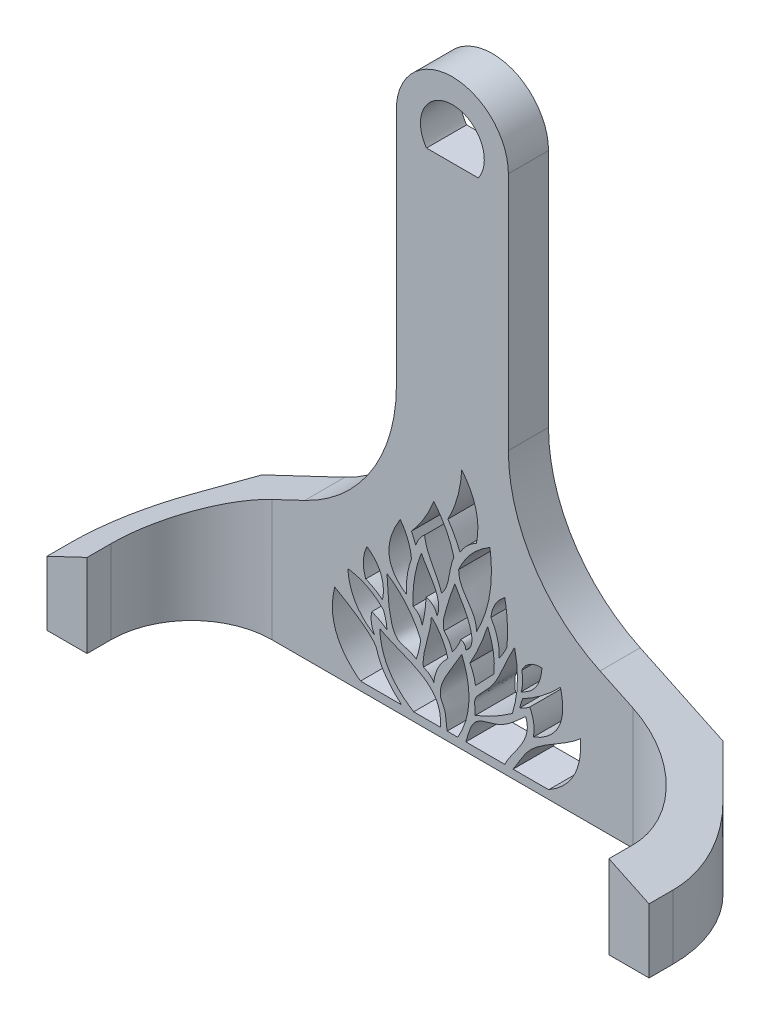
ISO-10303-21;
HEADER;
FILE_DESCRIPTION(('STEP AP214'),'2;1');
FILE_NAME('part.step','',(''),(''),'','','');
FILE_SCHEMA(('AUTOMOTIVE_DESIGN { 1 0 10303 214 1 1 1 1 }'));
ENDSEC;
DATA;
#1=APPLICATION_CONTEXT('core data for automotive mechanical design processes');
#2=APPLICATION_PROTOCOL_DEFINITION('international standard','automotive_design',2000,#1);
#3=PRODUCT_CONTEXT('',#1,'mechanical');
#4=PRODUCT('Part','Part','',(#3));
#5=PRODUCT_RELATED_PRODUCT_CATEGORY('part','',(#4));
#6=PRODUCT_DEFINITION_FORMATION('','',#4);
#7=PRODUCT_DEFINITION_CONTEXT('part definition',#1,'design');
#8=PRODUCT_DEFINITION('design','',#6,#7);
#9=PRODUCT_DEFINITION_SHAPE('','',#8);
#10=(LENGTH_UNIT() NAMED_UNIT(*) SI_UNIT(.MILLI.,.METRE.));
#11=(NAMED_UNIT(*) PLANE_ANGLE_UNIT() SI_UNIT($,.RADIAN.));
#12=(NAMED_UNIT(*) SI_UNIT($,.STERADIAN.) SOLID_ANGLE_UNIT());
#13=UNCERTAINTY_MEASURE_WITH_UNIT(LENGTH_MEASURE(1.E-05),#10,'distance_accuracy_value','');
#14=(GEOMETRIC_REPRESENTATION_CONTEXT(3) GLOBAL_UNCERTAINTY_ASSIGNED_CONTEXT((#13)) GLOBAL_UNIT_ASSIGNED_CONTEXT((#10,
#11,#12)) REPRESENTATION_CONTEXT('',''));
#15=CARTESIAN_POINT('',(0.,0.,0.));
#16=DIRECTION('',(0.,0.,1.));
#17=DIRECTION('',(1.,0.,0.));
#18=AXIS2_PLACEMENT_3D('',#15,#16,#17);
#19=CARTESIAN_POINT('',(-75.,16.,10.));
#20=DIRECTION('',(1.,0.,0.));
#21=DIRECTION('',(0.,0.,-1.));
#22=AXIS2_PLACEMENT_3D('',#19,#20,#21);
#23=PLANE('',#22);
#24=DIRECTION('',(0.,-1.,0.));
#25=VECTOR('',#24,1.);
#26=CARTESIAN_POINT('',(-75.,143.95,30.));
#27=LINE('',#26,#25);
#28=CARTESIAN_POINT('',(-75.,16.,30.));
#29=VERTEX_POINT('',#28);
#30=CARTESIAN_POINT('',(-75.,0.,30.));
#31=VERTEX_POINT('',#30);
#32=EDGE_CURVE('E1784',#29,#31,#27,.T.);
#33=ORIENTED_EDGE('',*,*,#32,.T.);
#34=DIRECTION('',(0.,0.,-1.));
#35=VECTOR('',#34,1.);
#36=CARTESIAN_POINT('',(-75.,0.,10.));
#37=LINE('',#36,#35);
#38=CARTESIAN_POINT('',(-75.,0.,36.));
#39=VERTEX_POINT('',#38);
#40=EDGE_CURVE('E1904',#39,#31,#37,.T.);
#41=ORIENTED_EDGE('',*,*,#40,.F.);
#42=DIRECTION('',(0.,-1.,0.));
#43=VECTOR('',#42,1.);
#44=CARTESIAN_POINT('',(-75.,16.,36.));
#45=LINE('',#44,#43);
#46=CARTESIAN_POINT('',(-75.,16.,36.));
#47=VERTEX_POINT('',#46);
#48=EDGE_CURVE('E1839',#47,#39,#45,.T.);
#49=ORIENTED_EDGE('',*,*,#48,.F.);
#50=DIRECTION('',(0.,0.,-1.));
#51=VECTOR('',#50,1.);
#52=CARTESIAN_POINT('',(-75.,16.,10.));
#53=LINE('',#52,#51);
#54=EDGE_CURVE('E1907',#47,#29,#53,.T.);
#55=ORIENTED_EDGE('',*,*,#54,.T.);
#56=EDGE_LOOP('',(#33,#41,#49,#55));
#57=FACE_BOUND('',#56,.T.);
#58=ADVANCED_FACE('F33',(#57),#23,.F.);
#59=CARTESIAN_POINT('',(-53.95,70.2827120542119,10.));
#60=DIRECTION('',(0.,0.,-1.));
#61=DIRECTION('',(-1.,0.,0.));
#62=AXIS2_PLACEMENT_3D('',#59,#60,#61);
#63=PLANE('',#62);
#64=CARTESIAN_POINT('',(-19.4111822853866,13.8276803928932,10.));
#65=CARTESIAN_POINT('',(-20.6266460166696,16.0567511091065,10.));
#66=CARTESIAN_POINT('',(-20.0769260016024,18.5138609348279,10.));
#67=B_SPLINE_CURVE_WITH_KNOTS('',2,(#64,#65,#66),.UNSPECIFIED.,.F.,.F.,(3,3),(0.,1.),.UNSPECIFIED.);
#68=CARTESIAN_POINT('',(-20.0769260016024,18.5138609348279,10.));
#69=VERTEX_POINT('',#68);
#70=CARTESIAN_POINT('',(-19.4111822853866,13.8276803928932,10.));
#71=VERTEX_POINT('',#70);
#72=EDGE_CURVE('E1736',#69,#71,#67,.F.);
#73=ORIENTED_EDGE('',*,*,#72,.T.);
#74=CARTESIAN_POINT('',(-26.0696327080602,24.8124900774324,10.));
#75=CARTESIAN_POINT('',(-25.4930774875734,17.5275181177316,10.));
#76=CARTESIAN_POINT('',(-19.4111822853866,13.8276803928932,10.));
#77=B_SPLINE_CURVE_WITH_KNOTS('',2,(#74,#75,#76),.UNSPECIFIED.,.F.,.F.,(3,3),(0.,1.),.UNSPECIFIED.);
#78=CARTESIAN_POINT('',(-26.0696327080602,24.8124900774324,10.));
#79=VERTEX_POINT('',#78);
#80=EDGE_CURVE('E1768',#71,#79,#77,.F.);
#81=ORIENTED_EDGE('',*,*,#80,.T.);
#82=CARTESIAN_POINT('',(-17.1530886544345,20.3041005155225,10.));
#83=CARTESIAN_POINT('',(-20.8095845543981,24.1549239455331,10.));
#84=CARTESIAN_POINT('',(-26.0696327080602,24.8124900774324,10.));
#85=B_SPLINE_CURVE_WITH_KNOTS('',2,(#82,#83,#84),.UNSPECIFIED.,.F.,.F.,(3,3),(0.,1.),.UNSPECIFIED.);
#86=CARTESIAN_POINT('',(-17.1530886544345,20.3041005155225,10.));
#87=VERTEX_POINT('',#86);
#88=EDGE_CURVE('E1760',#79,#87,#85,.F.);
#89=ORIENTED_EDGE('',*,*,#88,.T.);
#90=CARTESIAN_POINT('',(-16.2963721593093,16.4707504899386,10.));
#91=CARTESIAN_POINT('',(-16.4081852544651,18.451513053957,10.));
#92=CARTESIAN_POINT('',(-17.1530886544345,20.3041005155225,10.));
#93=B_SPLINE_CURVE_WITH_KNOTS('',2,(#90,#91,#92),.UNSPECIFIED.,.F.,.F.,(3,3),(0.,1.),.UNSPECIFIED.);
#94=CARTESIAN_POINT('',(-16.2963721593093,16.4707504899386,10.));
#95=VERTEX_POINT('',#94);
#96=EDGE_CURVE('E1752',#87,#95,#93,.F.);
#97=ORIENTED_EDGE('',*,*,#96,.T.);
#98=CARTESIAN_POINT('',(-20.0769260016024,18.5138609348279,10.));
#99=CARTESIAN_POINT('',(-18.0399950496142,17.7691100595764,10.));
#100=CARTESIAN_POINT('',(-16.2963721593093,16.4707504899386,10.));
#101=B_SPLINE_CURVE_WITH_KNOTS('',2,(#98,#99,#100),.UNSPECIFIED.,.F.,.F.,(3,3),(0.,1.),.UNSPECIFIED.);
#102=EDGE_CURVE('E1744',#95,#69,#101,.F.);
#103=ORIENTED_EDGE('',*,*,#102,.T.);
#104=EDGE_LOOP('',(#73,#81,#89,#97,#103));
#105=FACE_BOUND('',#104,.T.);
#106=CARTESIAN_POINT('',(26.9191661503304,25.6839414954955,10.));
#107=CARTESIAN_POINT('',(22.7863192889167,21.3536000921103,10.));
#108=CARTESIAN_POINT('',(17.5173823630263,18.5138609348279,10.));
#109=B_SPLINE_CURVE_WITH_KNOTS('',2,(#106,#107,#108),.UNSPECIFIED.,.F.,.F.,(3,3),(0.,1.),.UNSPECIFIED.);
#110=CARTESIAN_POINT('',(17.5173823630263,18.5138609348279,10.));
#111=VERTEX_POINT('',#110);
#112=CARTESIAN_POINT('',(26.9191661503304,25.6839414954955,10.));
#113=VERTEX_POINT('',#112);
#114=EDGE_CURVE('E1696',#111,#113,#109,.F.);
#115=ORIENTED_EDGE('',*,*,#114,.T.);
#116=CARTESIAN_POINT('',(20.1686503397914,11.5567092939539,10.));
#117=CARTESIAN_POINT('',(29.5081139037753,15.4183745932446,10.));
#118=CARTESIAN_POINT('',(26.9191661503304,25.6839414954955,10.));
#119=B_SPLINE_CURVE_WITH_KNOTS('',2,(#116,#117,#118),.UNSPECIFIED.,.F.,.F.,(3,3),(0.,1.),.UNSPECIFIED.);
#120=CARTESIAN_POINT('',(20.1686503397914,11.5567092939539,10.));
#121=VERTEX_POINT('',#120);
#122=EDGE_CURVE('E1728',#113,#121,#119,.F.);
#123=ORIENTED_EDGE('',*,*,#122,.T.);
#124=CARTESIAN_POINT('',(19.2940604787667,17.6170874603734,10.));
#125=CARTESIAN_POINT('',(20.7723187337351,14.6890645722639,10.));
#126=CARTESIAN_POINT('',(20.1686503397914,11.5567092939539,10.));
#127=B_SPLINE_CURVE_WITH_KNOTS('',2,(#124,#125,#126),.UNSPECIFIED.,.F.,.F.,(3,3),(0.,1.),.UNSPECIFIED.);
#128=CARTESIAN_POINT('',(19.2940604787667,17.6170874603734,10.));
#129=VERTEX_POINT('',#128);
#130=EDGE_CURVE('E1720',#121,#129,#127,.F.);
#131=ORIENTED_EDGE('',*,*,#130,.T.);
#132=CARTESIAN_POINT('',(16.7894802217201,16.1605346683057,10.));
#133=CARTESIAN_POINT('',(18.1558863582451,16.6965949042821,10.));
#134=CARTESIAN_POINT('',(19.2940604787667,17.6170874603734,10.));
#135=B_SPLINE_CURVE_WITH_KNOTS('',2,(#132,#133,#134),.UNSPECIFIED.,.F.,.F.,(3,3),(0.,1.),.UNSPECIFIED.);
#136=CARTESIAN_POINT('',(16.7894802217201,16.1605346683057,10.));
#137=VERTEX_POINT('',#136);
#138=EDGE_CURVE('E1712',#129,#137,#135,.F.);
#139=ORIENTED_EDGE('',*,*,#138,.T.);
#140=CARTESIAN_POINT('',(17.5173823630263,18.5138609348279,10.));
#141=CARTESIAN_POINT('',(17.0285415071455,17.3765554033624,10.));
#142=CARTESIAN_POINT('',(16.7894802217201,16.1605346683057,10.));
#143=B_SPLINE_CURVE_WITH_KNOTS('',2,(#140,#141,#142),.UNSPECIFIED.,.F.,.F.,(3,3),(0.,1.),.UNSPECIFIED.);
#144=EDGE_CURVE('E1704',#137,#111,#143,.F.);
#145=ORIENTED_EDGE('',*,*,#144,.T.);
#146=EDGE_LOOP('',(#115,#123,#131,#139,#145));
#147=FACE_BOUND('',#146,.T.);
#148=CARTESIAN_POINT('',(-29.3193134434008,19.2117156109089,10.));
#149=CARTESIAN_POINT('',(-31.9230060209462,8.8416884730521,10.));
#150=CARTESIAN_POINT('',(-22.8983617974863,2.11882260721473,10.));
#151=B_SPLINE_CURVE_WITH_KNOTS('',2,(#148,#149,#150),.UNSPECIFIED.,.F.,.F.,(3,3),(0.,1.),.UNSPECIFIED.);
#152=CARTESIAN_POINT('',(-22.8983617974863,2.11882260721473,10.));
#153=VERTEX_POINT('',#152);
#154=CARTESIAN_POINT('',(-29.3193134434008,19.2117156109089,10.));
#155=VERTEX_POINT('',#154);
#156=EDGE_CURVE('E1677',#153,#155,#151,.F.);
#157=ORIENTED_EDGE('',*,*,#156,.T.);
#158=CARTESIAN_POINT('',(-12.6879202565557,2.11882260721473,10.));
#159=CARTESIAN_POINT('',(-15.3788950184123,4.40357845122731,10.));
#160=CARTESIAN_POINT('',(-18.7808713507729,9.25583254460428,10.));
#161=CARTESIAN_POINT('',(-18.4623344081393,12.773018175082,10.));
#162=CARTESIAN_POINT('',(-26.9826947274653,17.9140951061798,10.));
#163=CARTESIAN_POINT('',(-29.3193134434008,19.2117156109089,10.));
#164=B_SPLINE_CURVE_WITH_KNOTS('',3,(#158,#159,#160,#161,#162,#163),.UNSPECIFIED.,.F.,.F.,(4,1,
1,4),(0.,0.258366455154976,0.490885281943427,1.),.UNSPECIFIED.);
#165=CARTESIAN_POINT('',(-12.6879202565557,2.11882260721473,10.));
#166=VERTEX_POINT('',#165);
#167=EDGE_CURVE('E1691',#155,#166,#164,.F.);
#168=ORIENTED_EDGE('',*,*,#167,.T.);
#169=DIRECTION('',(-1.,0.,0.));
#170=VECTOR('',#169,1.);
#171=CARTESIAN_POINT('',(-53.95,2.11882260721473,10.));
#172=LINE('',#171,#170);
#173=EDGE_CURVE('E1685',#166,#153,#172,.T.);
#174=ORIENTED_EDGE('',*,*,#173,.T.);
#175=EDGE_LOOP('',(#157,#168,#174));
#176=FACE_BOUND('',#175,.T.);
#177=CARTESIAN_POINT('',(10.3912262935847,20.3041005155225,10.));
#178=CARTESIAN_POINT('',(10.7723356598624,25.2098704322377,10.));
#179=CARTESIAN_POINT('',(8.78569162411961,29.7493585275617,10.));
#180=B_SPLINE_CURVE_WITH_KNOTS('',2,(#177,#178,#179),.UNSPECIFIED.,.F.,.F.,(3,3),(0.,1.),.UNSPECIFIED.);
#181=CARTESIAN_POINT('',(8.78569162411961,29.7493585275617,10.));
#182=VERTEX_POINT('',#181);
#183=CARTESIAN_POINT('',(10.3912262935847,20.3041005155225,10.));
#184=VERTEX_POINT('',#183);
#185=EDGE_CURVE('E1645',#182,#184,#180,.F.);
#186=ORIENTED_EDGE('',*,*,#185,.T.);
#187=CARTESIAN_POINT('',(5.77062639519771,15.4674770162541,10.));
#188=CARTESIAN_POINT('',(8.05692069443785,17.9087270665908,10.));
#189=CARTESIAN_POINT('',(10.3912262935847,20.3041005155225,10.));
#190=B_SPLINE_CURVE_WITH_KNOTS('',2,(#187,#188,#189),.UNSPECIFIED.,.F.,.F.,(3,3),(0.,1.),.UNSPECIFIED.);
#191=CARTESIAN_POINT('',(5.77062639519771,15.4674770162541,10.));
#192=VERTEX_POINT('',#191);
#193=EDGE_CURVE('E1669',#184,#192,#190,.F.);
#194=ORIENTED_EDGE('',*,*,#193,.T.);
#195=CARTESIAN_POINT('',(4.37247624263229,19.6364184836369,10.));
#196=CARTESIAN_POINT('',(5.4370069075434,17.6745770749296,10.));
#197=CARTESIAN_POINT('',(5.77062639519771,15.4674770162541,10.));
#198=B_SPLINE_CURVE_WITH_KNOTS('',2,(#195,#196,#197),.UNSPECIFIED.,.F.,.F.,(3,3),(0.,1.),.UNSPECIFIED.);
#199=CARTESIAN_POINT('',(4.37247624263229,19.6364184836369,10.));
#200=VERTEX_POINT('',#199);
#201=EDGE_CURVE('E1661',#192,#200,#198,.F.);
#202=ORIENTED_EDGE('',*,*,#201,.T.);
#203=CARTESIAN_POINT('',(8.78569162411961,29.7493585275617,10.));
#204=CARTESIAN_POINT('',(7.08275038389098,24.4638172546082,10.));
#205=CARTESIAN_POINT('',(4.37247624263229,19.6364184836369,10.));
#206=B_SPLINE_CURVE_WITH_KNOTS('',2,(#203,#204,#205),.UNSPECIFIED.,.F.,.F.,(3,3),(0.,1.),.UNSPECIFIED.);
#207=EDGE_CURVE('E1653',#200,#182,#206,.F.);
#208=ORIENTED_EDGE('',*,*,#207,.T.);
#209=EDGE_LOOP('',(#186,#194,#202,#208));
#210=FACE_BOUND('',#209,.T.);
#211=CARTESIAN_POINT('',(-21.2792165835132,31.9862348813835,10.));
#212=CARTESIAN_POINT('',(-22.9294448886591,28.3882279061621,10.));
#213=CARTESIAN_POINT('',(-21.5738113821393,24.8124900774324,10.));
#214=B_SPLINE_CURVE_WITH_KNOTS('',2,(#211,#212,#213),.UNSPECIFIED.,.F.,.F.,(3,3),(0.,1.),.UNSPECIFIED.);
#215=CARTESIAN_POINT('',(-21.5738113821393,24.8124900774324,10.));
#216=VERTEX_POINT('',#215);
#217=CARTESIAN_POINT('',(-21.2792165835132,31.9862348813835,10.));
#218=VERTEX_POINT('',#217);
#219=EDGE_CURVE('E1621',#216,#218,#214,.F.);
#220=ORIENTED_EDGE('',*,*,#219,.T.);
#221=CARTESIAN_POINT('',(-17.4002733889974,22.3703534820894,10.));
#222=CARTESIAN_POINT('',(-16.2846085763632,28.3248089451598,10.));
#223=CARTESIAN_POINT('',(-21.2792165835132,31.9862348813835,10.));
#224=B_SPLINE_CURVE_WITH_KNOTS('',2,(#221,#222,#223),.UNSPECIFIED.,.F.,.F.,(3,3),(0.,1.),.UNSPECIFIED.);
#225=CARTESIAN_POINT('',(-17.4002733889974,22.3703534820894,10.));
#226=VERTEX_POINT('',#225);
#227=EDGE_CURVE('E1637',#218,#226,#224,.F.);
#228=ORIENTED_EDGE('',*,*,#227,.T.);
#229=CARTESIAN_POINT('',(-21.5738113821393,24.8124900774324,10.));
#230=CARTESIAN_POINT('',(-19.3127300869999,23.9021638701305,10.));
#231=CARTESIAN_POINT('',(-17.4002733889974,22.3703534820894,10.));
#232=B_SPLINE_CURVE_WITH_KNOTS('',2,(#229,#230,#231),.UNSPECIFIED.,.F.,.F.,(3,3),(0.,1.),.UNSPECIFIED.);
#233=EDGE_CURVE('E1629',#226,#216,#232,.F.);
#234=ORIENTED_EDGE('',*,*,#233,.T.);
#235=EDGE_LOOP('',(#220,#228,#234));
#236=FACE_BOUND('',#235,.T.);
#237=CARTESIAN_POINT('',(-10.1758197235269,34.8551848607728,10.));
#238=CARTESIAN_POINT('',(-10.632222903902,38.8217768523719,10.));
#239=CARTESIAN_POINT('',(-13.0024668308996,41.9721797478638,10.));
#240=B_SPLINE_CURVE_WITH_KNOTS('',2,(#237,#238,#239),.UNSPECIFIED.,.F.,.F.,(3,3),(0.,1.),.UNSPECIFIED.);
#241=CARTESIAN_POINT('',(-13.0024668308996,41.9721797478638,10.));
#242=VERTEX_POINT('',#241);
#243=CARTESIAN_POINT('',(-10.1758197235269,34.8551848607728,10.));
#244=VERTEX_POINT('',#243);
#245=EDGE_CURVE('E1597',#242,#244,#240,.F.);
#246=ORIENTED_EDGE('',*,*,#245,.T.);
#247=CARTESIAN_POINT('',(-11.4795378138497,26.5800894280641,10.));
#248=CARTESIAN_POINT('',(-11.6774221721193,30.8296089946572,10.));
#249=CARTESIAN_POINT('',(-10.1758197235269,34.8551848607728,10.));
#250=B_SPLINE_CURVE_WITH_KNOTS('',2,(#247,#248,#249),.UNSPECIFIED.,.F.,.F.,(3,3),(0.,1.),.UNSPECIFIED.);
#251=CARTESIAN_POINT('',(-11.4795378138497,26.5800894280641,10.));
#252=VERTEX_POINT('',#251);
#253=EDGE_CURVE('E1613',#244,#252,#250,.F.);
#254=ORIENTED_EDGE('',*,*,#253,.T.);
#255=CARTESIAN_POINT('',(-13.0024668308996,41.9721797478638,10.));
#256=CARTESIAN_POINT('',(-19.282956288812,31.7470193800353,10.));
#257=CARTESIAN_POINT('',(-11.4795378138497,26.5800894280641,10.));
#258=B_SPLINE_CURVE_WITH_KNOTS('',2,(#255,#256,#257),.UNSPECIFIED.,.F.,.F.,(3,3),(0.,1.),.UNSPECIFIED.);
#259=EDGE_CURVE('E1605',#252,#242,#258,.F.);
#260=ORIENTED_EDGE('',*,*,#259,.T.);
#261=EDGE_LOOP('',(#246,#254,#260));
#262=FACE_BOUND('',#261,.T.);
#263=CARTESIAN_POINT('',(17.2876805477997,24.5544666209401,10.));
#264=CARTESIAN_POINT('',(17.8180278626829,22.1724906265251,10.));
#265=CARTESIAN_POINT('',(17.1279859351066,19.8189978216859,10.));
#266=B_SPLINE_CURVE_WITH_KNOTS('',2,(#263,#264,#265),.UNSPECIFIED.,.F.,.F.,(3,3),(0.,1.),.UNSPECIFIED.);
#267=CARTESIAN_POINT('',(17.1279859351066,19.8189978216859,10.));
#268=VERTEX_POINT('',#267);
#269=CARTESIAN_POINT('',(17.2876805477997,24.5544666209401,10.));
#270=VERTEX_POINT('',#269);
#271=EDGE_CURVE('E1573',#268,#270,#266,.F.);
#272=ORIENTED_EDGE('',*,*,#271,.T.);
#273=CARTESIAN_POINT('',(22.3014315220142,27.5613880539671,10.));
#274=CARTESIAN_POINT('',(18.7668420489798,27.5974807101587,10.));
#275=CARTESIAN_POINT('',(17.2876805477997,24.5544666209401,10.));
#276=B_SPLINE_CURVE_WITH_KNOTS('',2,(#273,#274,#275),.UNSPECIFIED.,.F.,.F.,(3,3),(0.,1.),.UNSPECIFIED.);
#277=CARTESIAN_POINT('',(22.3014315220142,27.5613880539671,10.));
#278=VERTEX_POINT('',#277);
#279=EDGE_CURVE('E1589',#270,#278,#276,.F.);
#280=ORIENTED_EDGE('',*,*,#279,.T.);
#281=CARTESIAN_POINT('',(17.1279859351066,19.8189978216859,10.));
#282=CARTESIAN_POINT('',(21.9809656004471,21.8527588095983,10.));
#283=CARTESIAN_POINT('',(22.3014315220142,27.5613880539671,10.));
#284=B_SPLINE_CURVE_WITH_KNOTS('',2,(#281,#282,#283),.UNSPECIFIED.,.F.,.F.,(3,3),(0.,1.),.UNSPECIFIED.);
#285=EDGE_CURVE('E1581',#278,#268,#284,.F.);
#286=ORIENTED_EDGE('',*,*,#285,.T.);
#287=EDGE_LOOP('',(#272,#280,#286));
#288=FACE_BOUND('',#287,.T.);
#289=CARTESIAN_POINT('',(11.6580944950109,24.3558726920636,10.));
#290=CARTESIAN_POINT('',(12.8414591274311,25.9188165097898,10.));
#291=CARTESIAN_POINT('',(13.6119464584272,27.7208399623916,10.));
#292=B_SPLINE_CURVE_WITH_KNOTS('',2,(#289,#290,#291),.UNSPECIFIED.,.F.,.F.,(3,3),(0.,1.),.UNSPECIFIED.);
#293=CARTESIAN_POINT('',(13.6119464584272,27.7208399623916,10.));
#294=VERTEX_POINT('',#293);
#295=CARTESIAN_POINT('',(11.6580944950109,24.3558726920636,10.));
#296=VERTEX_POINT('',#295);
#297=EDGE_CURVE('E1541',#294,#296,#292,.F.);
#298=ORIENTED_EDGE('',*,*,#297,.T.);
#299=CARTESIAN_POINT('',(9.60134408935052,32.1046137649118,10.));
#300=CARTESIAN_POINT('',(11.8453374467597,28.4743065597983,10.));
#301=CARTESIAN_POINT('',(11.6580944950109,24.3558726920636,10.));
#302=B_SPLINE_CURVE_WITH_KNOTS('',2,(#299,#300,#301),.UNSPECIFIED.,.F.,.F.,(3,3),(0.,1.),.UNSPECIFIED.);
#303=CARTESIAN_POINT('',(9.60134408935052,32.1046137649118,10.));
#304=VERTEX_POINT('',#303);
#305=EDGE_CURVE('E1565',#296,#304,#302,.F.);
#306=ORIENTED_EDGE('',*,*,#305,.T.);
#307=CARTESIAN_POINT('',(13.0537040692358,38.0933136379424,10.));
#308=CARTESIAN_POINT('',(10.0156498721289,35.8394912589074,10.));
#309=CARTESIAN_POINT('',(9.60134408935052,32.1046137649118,10.));
#310=B_SPLINE_CURVE_WITH_KNOTS('',2,(#307,#308,#309),.UNSPECIFIED.,.F.,.F.,(3,3),(0.,1.),.UNSPECIFIED.);
#311=CARTESIAN_POINT('',(13.0537040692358,38.0933136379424,10.));
#312=VERTEX_POINT('',#311);
#313=EDGE_CURVE('E1557',#304,#312,#310,.F.);
#314=ORIENTED_EDGE('',*,*,#313,.T.);
#315=CARTESIAN_POINT('',(13.6119464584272,27.7208399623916,10.));
#316=CARTESIAN_POINT('',(14.0934936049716,32.915838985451,10.));
#317=CARTESIAN_POINT('',(13.0537040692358,38.0933136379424,10.));
#318=B_SPLINE_CURVE_WITH_KNOTS('',2,(#315,#316,#317),.UNSPECIFIED.,.F.,.F.,(3,3),(0.,1.),.UNSPECIFIED.);
#319=EDGE_CURVE('E1549',#312,#294,#318,.F.);
#320=ORIENTED_EDGE('',*,*,#319,.T.);
#321=EDGE_LOOP('',(#298,#306,#314,#320));
#322=FACE_BOUND('',#321,.T.);
#323=CARTESIAN_POINT('',(-9.00326442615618,13.8276803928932,10.));
#324=CARTESIAN_POINT('',(-8.18216687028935,16.1049305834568,10.));
#325=CARTESIAN_POINT('',(-7.89238406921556,18.5138609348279,10.));
#326=B_SPLINE_CURVE_WITH_KNOTS('',2,(#323,#324,#325),.UNSPECIFIED.,.F.,.F.,(3,3),(0.,1.),.UNSPECIFIED.);
#327=CARTESIAN_POINT('',(-7.89238406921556,18.5138609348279,10.));
#328=VERTEX_POINT('',#327);
#329=CARTESIAN_POINT('',(-9.00326442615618,13.8276803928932,10.));
#330=VERTEX_POINT('',#329);
#331=EDGE_CURVE('E1517',#328,#330,#326,.F.);
#332=ORIENTED_EDGE('',*,*,#331,.T.);
#333=CARTESIAN_POINT('',(-16.2963721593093,28.6137578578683,10.));
#334=CARTESIAN_POINT('',(-15.8332885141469,21.3808323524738,10.));
#335=CARTESIAN_POINT('',(-15.9724690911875,22.8624725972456,10.));
#336=CARTESIAN_POINT('',(-14.6559063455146,15.6262155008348,10.));
#337=CARTESIAN_POINT('',(-11.102369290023,14.8512429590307,10.));
#338=CARTESIAN_POINT('',(-10.1566862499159,14.4900927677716,10.));
#339=CARTESIAN_POINT('',(-9.00326442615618,13.8276803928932,10.));
#340=B_SPLINE_CURVE_WITH_KNOTS('',3,(#333,#334,#335,#336,#337,#338,#339),.UNSPECIFIED.,.F.,.F.,
(4,1,1,1,4),(0.,0.464215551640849,0.738525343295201,0.852030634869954,1.),.UNSPECIFIED.);
#341=CARTESIAN_POINT('',(-16.2963721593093,28.6137578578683,10.));
#342=VERTEX_POINT('',#341);
#343=EDGE_CURVE('E1533',#330,#342,#340,.F.);
#344=ORIENTED_EDGE('',*,*,#343,.T.);
#345=CARTESIAN_POINT('',(-7.89238406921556,18.5138609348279,10.));
#346=CARTESIAN_POINT('',(-10.4989212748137,24.8120309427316,10.));
#347=CARTESIAN_POINT('',(-16.2963721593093,28.6137578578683,10.));
#348=B_SPLINE_CURVE_WITH_KNOTS('',2,(#345,#346,#347),.UNSPECIFIED.,.F.,.F.,(3,3),(0.,1.),.UNSPECIFIED.);
#349=EDGE_CURVE('E1525',#342,#328,#348,.F.);
#350=ORIENTED_EDGE('',*,*,#349,.T.);
#351=EDGE_LOOP('',(#332,#344,#350));
#352=FACE_BOUND('',#351,.T.);
#353=CARTESIAN_POINT('',(5.69014088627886,8.99431978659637,10.));
#354=CARTESIAN_POINT('',(10.6250412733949,10.9590760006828,10.));
#355=CARTESIAN_POINT('',(14.9459744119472,14.0505684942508,10.));
#356=B_SPLINE_CURVE_WITH_KNOTS('',2,(#353,#354,#355),.UNSPECIFIED.,.F.,.F.,(3,3),(0.,1.),.UNSPECIFIED.);
#357=CARTESIAN_POINT('',(14.9459744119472,14.0505684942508,10.));
#358=VERTEX_POINT('',#357);
#359=CARTESIAN_POINT('',(5.69014088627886,8.99431978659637,10.));
#360=VERTEX_POINT('',#359);
#361=EDGE_CURVE('E1493',#358,#360,#356,.F.);
#362=ORIENTED_EDGE('',*,*,#361,.T.);
#363=CARTESIAN_POINT('',(15.5039623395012,28.6137578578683,10.));
#364=CARTESIAN_POINT('',(12.3213305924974,22.7697874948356,10.));
#365=CARTESIAN_POINT('',(11.6865740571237,18.4829024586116,10.));
#366=CARTESIAN_POINT('',(5.02806802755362,12.7852650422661,10.));
#367=CARTESIAN_POINT('',(5.62628894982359,11.1854268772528,10.));
#368=CARTESIAN_POINT('',(5.69014088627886,8.99431978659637,10.));
#369=B_SPLINE_CURVE_WITH_KNOTS('',3,(#363,#364,#365,#366,#367,#368),.UNSPECIFIED.,.F.,.F.,(4,1,
1,4),(0.,0.562082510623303,0.809544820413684,1.),.UNSPECIFIED.);
#370=CARTESIAN_POINT('',(15.5039623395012,28.6137578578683,10.));
#371=VERTEX_POINT('',#370);
#372=EDGE_CURVE('E1509',#360,#371,#369,.F.);
#373=ORIENTED_EDGE('',*,*,#372,.T.);
#374=CARTESIAN_POINT('',(14.9459744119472,14.0505684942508,10.));
#375=CARTESIAN_POINT('',(17.1642560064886,21.1394162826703,10.));
#376=CARTESIAN_POINT('',(15.5039623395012,28.6137578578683,10.));
#377=B_SPLINE_CURVE_WITH_KNOTS('',2,(#374,#375,#376),.UNSPECIFIED.,.F.,.F.,(3,3),(0.,1.),.UNSPECIFIED.);
#378=EDGE_CURVE('E1501',#371,#358,#377,.F.);
#379=ORIENTED_EDGE('',*,*,#378,.T.);
#380=EDGE_LOOP('',(#362,#373,#379));
#381=FACE_BOUND('',#380,.T.);
#382=DIRECTION('',(-1.,0.,0.));
#383=VECTOR('',#382,1.);
#384=CARTESIAN_POINT('',(-53.95,2.11882260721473,10.));
#385=LINE('',#384,#383);
#386=CARTESIAN_POINT('',(1.35135838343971,2.11882260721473,10.));
#387=VERTEX_POINT('',#386);
#388=CARTESIAN_POINT('',(-1.30404169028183,2.11882260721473,10.));
#389=VERTEX_POINT('',#388);
#390=EDGE_CURVE('E1474',#387,#389,#385,.T.);
#391=ORIENTED_EDGE('',*,*,#390,.T.);
#392=CARTESIAN_POINT('',(2.3340637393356,20.5003746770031,10.));
#393=CARTESIAN_POINT('',(-0.747048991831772,15.0641585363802,10.));
#394=CARTESIAN_POINT('',(-2.85189920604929,12.6791613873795,10.));
#395=CARTESIAN_POINT('',(-3.10409628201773,8.34935693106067,10.));
#396=CARTESIAN_POINT('',(-1.53346334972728,6.45694126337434,10.));
#397=CARTESIAN_POINT('',(-1.55713348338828,3.49388758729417,10.));
#398=CARTESIAN_POINT('',(-1.30404169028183,2.11882260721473,10.));
#399=B_SPLINE_CURVE_WITH_KNOTS('',3,(#392,#393,#394,#395,#396,#397,#398),.UNSPECIFIED.,.F.,.F.,
(4,1,1,1,4),(0.,0.577318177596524,0.661305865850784,0.839876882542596,1.),.UNSPECIFIED.);
#400=CARTESIAN_POINT('',(2.3340637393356,20.5003746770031,10.));
#401=VERTEX_POINT('',#400);
#402=EDGE_CURVE('E1485',#389,#401,#399,.F.);
#403=ORIENTED_EDGE('',*,*,#402,.T.);
#404=CARTESIAN_POINT('',(1.35135838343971,2.11882260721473,10.));
#405=CARTESIAN_POINT('',(6.36439821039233,10.8131305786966,10.));
#406=CARTESIAN_POINT('',(2.3340637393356,20.5003746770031,10.));
#407=B_SPLINE_CURVE_WITH_KNOTS('',2,(#404,#405,#406),.UNSPECIFIED.,.F.,.F.,(3,3),(0.,1.),.UNSPECIFIED.);
#408=EDGE_CURVE('E1480',#401,#387,#407,.F.);
#409=ORIENTED_EDGE('',*,*,#408,.T.);
#410=EDGE_LOOP('',(#391,#403,#409));
#411=FACE_BOUND('',#410,.T.);
#412=DIRECTION('',(-1.,0.,0.));
#413=VECTOR('',#412,1.);
#414=CARTESIAN_POINT('',(-53.95,2.11882260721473,10.));
#415=LINE('',#414,#413);
#416=CARTESIAN_POINT('',(13.0537040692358,2.11882260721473,10.));
#417=VERTEX_POINT('',#416);
#418=CARTESIAN_POINT('',(3.34899880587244,2.11882260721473,10.));
#419=VERTEX_POINT('',#418);
#420=EDGE_CURVE('E1455',#417,#419,#415,.T.);
#421=ORIENTED_EDGE('',*,*,#420,.T.);
#422=CARTESIAN_POINT('',(18.2443986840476,15.0193108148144,10.));
#423=CARTESIAN_POINT('',(15.5452701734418,12.6333071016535,10.));
#424=CARTESIAN_POINT('',(12.1649166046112,9.25302357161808,10.));
#425=CARTESIAN_POINT('',(5.00347828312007,8.70194791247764,10.));
#426=CARTESIAN_POINT('',(3.88455253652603,3.78531468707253,10.));
#427=CARTESIAN_POINT('',(3.34899880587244,2.11882260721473,10.));
#428=B_SPLINE_CURVE_WITH_KNOTS('',3,(#422,#423,#424,#425,#426,#427),.UNSPECIFIED.,.F.,.F.,(4,1,
1,4),(0.,0.464510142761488,0.781124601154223,1.),.UNSPECIFIED.);
#429=CARTESIAN_POINT('',(18.2443986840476,15.0193108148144,10.));
#430=VERTEX_POINT('',#429);
#431=EDGE_CURVE('E1466',#419,#430,#428,.F.);
#432=ORIENTED_EDGE('',*,*,#431,.T.);
#433=CARTESIAN_POINT('',(13.0537040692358,2.11882260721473,10.));
#434=CARTESIAN_POINT('',(14.7043245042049,5.9126631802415,10.));
#435=CARTESIAN_POINT('',(20.2273318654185,10.2654040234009,10.));
#436=CARTESIAN_POINT('',(18.2443986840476,15.0193108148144,10.));
#437=B_SPLINE_CURVE_WITH_KNOTS('',3,(#433,#434,#435,#436),.UNSPECIFIED.,.F.,.F.,(4,4),(0.,1.),.UNSPECIFIED.);
#438=EDGE_CURVE('E1461',#430,#417,#437,.F.);
#439=ORIENTED_EDGE('',*,*,#438,.T.);
#440=EDGE_LOOP('',(#421,#432,#439));
#441=FACE_BOUND('',#440,.T.);
#442=DIRECTION('',(-1.,0.,0.));
#443=VECTOR('',#442,1.);
#444=CARTESIAN_POINT('',(-53.95,2.11882260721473,10.));
#445=LINE('',#444,#443);
#446=CARTESIAN_POINT('',(23.9930766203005,2.11882260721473,10.));
#447=VERTEX_POINT('',#446);
#448=CARTESIAN_POINT('',(15.1215791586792,2.11882260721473,10.));
#449=VERTEX_POINT('',#448);
#450=EDGE_CURVE('E1436',#447,#449,#445,.T.);
#451=ORIENTED_EDGE('',*,*,#450,.T.);
#452=CARTESIAN_POINT('',(31.8771697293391,17.0673527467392,10.));
#453=CARTESIAN_POINT('',(28.6716392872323,14.0372931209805,10.));
#454=CARTESIAN_POINT('',(19.6423504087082,10.5314435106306,10.));
#455=CARTESIAN_POINT('',(17.0830733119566,5.12450620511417,10.));
#456=CARTESIAN_POINT('',(15.1215791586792,2.11882260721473,10.));
#457=B_SPLINE_CURVE_WITH_KNOTS('',3,(#452,#453,#454,#455,#456),.UNSPECIFIED.,.F.,.F.,(4,1,4),
(0.,0.653270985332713,1.),.UNSPECIFIED.);
#458=CARTESIAN_POINT('',(31.8771697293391,17.0673527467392,10.));
#459=VERTEX_POINT('',#458);
#460=EDGE_CURVE('E1447',#449,#459,#457,.F.);
#461=ORIENTED_EDGE('',*,*,#460,.T.);
#462=CARTESIAN_POINT('',(23.9930766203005,2.11882260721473,10.));
#463=CARTESIAN_POINT('',(32.6469926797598,7.17343832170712,10.));
#464=CARTESIAN_POINT('',(31.8771697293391,17.0673527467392,10.));
#465=B_SPLINE_CURVE_WITH_KNOTS('',2,(#462,#463,#464),.UNSPECIFIED.,.F.,.F.,(3,3),(0.,1.),.UNSPECIFIED.);
#466=EDGE_CURVE('E1442',#459,#447,#465,.F.);
#467=ORIENTED_EDGE('',*,*,#466,.T.);
#468=EDGE_LOOP('',(#451,#461,#467));
#469=FACE_BOUND('',#468,.T.);
#470=CARTESIAN_POINT('',(0.,19.8189978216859,10.));
#471=CARTESIAN_POINT('',(1.34273190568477,21.5515970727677,10.));
#472=CARTESIAN_POINT('',(2.11294147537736,23.6071200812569,10.));
#473=B_SPLINE_CURVE_WITH_KNOTS('',2,(#470,#471,#472),.UNSPECIFIED.,.F.,.F.,(3,3),(0.,1.),.UNSPECIFIED.);
#474=CARTESIAN_POINT('',(2.11294147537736,23.6071200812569,10.));
#475=VERTEX_POINT('',#474);
#476=CARTESIAN_POINT('',(0.,19.8189978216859,10.));
#477=VERTEX_POINT('',#476);
#478=EDGE_CURVE('E1396',#475,#477,#473,.F.);
#479=ORIENTED_EDGE('',*,*,#478,.T.);
#480=CARTESIAN_POINT('',(-2.04070135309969,23.3911306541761,10.));
#481=CARTESIAN_POINT('',(-0.599568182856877,21.8379719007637,10.));
#482=CARTESIAN_POINT('',(0.,19.8189978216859,10.));
#483=B_SPLINE_CURVE_WITH_KNOTS('',2,(#480,#481,#482),.UNSPECIFIED.,.F.,.F.,(3,3),(0.,1.),.UNSPECIFIED.);
#484=CARTESIAN_POINT('',(-2.04070135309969,23.3911306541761,10.));
#485=VERTEX_POINT('',#484);
#486=EDGE_CURVE('E1428',#477,#485,#483,.F.);
#487=ORIENTED_EDGE('',*,*,#486,.T.);
#488=CARTESIAN_POINT('',(0.617630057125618,34.8551848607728,10.));
#489=CARTESIAN_POINT('',(-0.503306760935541,32.1161430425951,10.));
#490=CARTESIAN_POINT('',(-1.13003102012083,29.3232183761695,10.));
#491=CARTESIAN_POINT('',(-2.62174528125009,25.0757038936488,10.));
#492=CARTESIAN_POINT('',(-2.04070135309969,23.3911306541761,10.));
#493=B_SPLINE_CURVE_WITH_KNOTS('',3,(#488,#489,#490,#491,#492),.UNSPECIFIED.,.F.,.F.,(4,1,4),
(0.,0.561677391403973,1.),.UNSPECIFIED.);
#494=CARTESIAN_POINT('',(0.617630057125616,34.8551848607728,10.));
#495=VERTEX_POINT('',#494);
#496=EDGE_CURVE('E1420',#485,#495,#493,.F.);
#497=ORIENTED_EDGE('',*,*,#496,.T.);
#498=CARTESIAN_POINT('',(3.34899880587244,21.9290483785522,10.));
#499=CARTESIAN_POINT('',(6.00971866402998,23.6188457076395,10.));
#500=CARTESIAN_POINT('',(3.45536114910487,30.2234326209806,10.));
#501=CARTESIAN_POINT('',(2.44514573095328,31.6777996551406,10.));
#502=CARTESIAN_POINT('',(0.617630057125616,34.8551848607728,10.));
#503=B_SPLINE_CURVE_WITH_KNOTS('',3,(#498,#499,#500,#501,#502),.UNSPECIFIED.,.F.,.F.,(4,1,4),
(0.,0.567372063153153,1.),.UNSPECIFIED.);
#504=CARTESIAN_POINT('',(3.34899880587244,21.9290483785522,10.));
#505=VERTEX_POINT('',#504);
#506=EDGE_CURVE('E1412',#495,#505,#503,.F.);
#507=ORIENTED_EDGE('',*,*,#506,.T.);
#508=CARTESIAN_POINT('',(2.11294147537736,23.6071200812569,10.));
#509=CARTESIAN_POINT('',(3.22433946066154,23.289279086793,10.));
#510=CARTESIAN_POINT('',(3.34899880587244,21.9290483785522,10.));
#511=B_SPLINE_CURVE_WITH_KNOTS('',2,(#508,#509,#510),.UNSPECIFIED.,.F.,.F.,(3,3),(0.,1.),.UNSPECIFIED.);
#512=EDGE_CURVE('E1404',#505,#475,#511,.F.);
#513=ORIENTED_EDGE('',*,*,#512,.T.);
#514=EDGE_LOOP('',(#479,#487,#497,#507,#513));
#515=FACE_BOUND('',#514,.T.);
#516=CARTESIAN_POINT('',(-4.63285864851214,10.9606119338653,10.));
#517=CARTESIAN_POINT('',(-4.16679517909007,15.0190316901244,10.));
#518=CARTESIAN_POINT('',(-1.11612130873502,17.8744696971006,10.));
#519=B_SPLINE_CURVE_WITH_KNOTS('',2,(#516,#517,#518),.UNSPECIFIED.,.F.,.F.,(3,3),(0.,1.),.UNSPECIFIED.);
#520=CARTESIAN_POINT('',(-1.11612130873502,17.8744696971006,10.));
#521=VERTEX_POINT('',#520);
#522=CARTESIAN_POINT('',(-4.63285864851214,10.9606119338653,10.));
#523=VERTEX_POINT('',#522);
#524=EDGE_CURVE('E1364',#521,#523,#519,.F.);
#525=ORIENTED_EDGE('',*,*,#524,.T.);
#526=CARTESIAN_POINT('',(-7.24050742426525,12.9351791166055,10.));
#527=CARTESIAN_POINT('',(-5.55932733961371,12.4215221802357,10.));
#528=CARTESIAN_POINT('',(-4.63285864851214,10.9606119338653,10.));
#529=B_SPLINE_CURVE_WITH_KNOTS('',2,(#526,#527,#528),.UNSPECIFIED.,.F.,.F.,(3,3),(0.,1.),.UNSPECIFIED.);
#530=CARTESIAN_POINT('',(-7.24050742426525,12.9351791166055,10.));
#531=VERTEX_POINT('',#530);
#532=EDGE_CURVE('E1388',#523,#531,#529,.F.);
#533=ORIENTED_EDGE('',*,*,#532,.T.);
#534=CARTESIAN_POINT('',(-5.23596284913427,24.8124900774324,10.));
#535=CARTESIAN_POINT('',(-5.37100908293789,20.7477801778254,10.));
#536=CARTESIAN_POINT('',(-7.55865817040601,17.0444145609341,10.));
#537=CARTESIAN_POINT('',(-7.24050742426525,12.9351791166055,10.));
#538=B_SPLINE_CURVE_WITH_KNOTS('',3,(#534,#535,#536,#537),.UNSPECIFIED.,.F.,.F.,(4,4),(0.,1.),.UNSPECIFIED.);
#539=CARTESIAN_POINT('',(-5.23596284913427,24.8124900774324,10.));
#540=VERTEX_POINT('',#539);
#541=EDGE_CURVE('E1380',#531,#540,#538,.F.);
#542=ORIENTED_EDGE('',*,*,#541,.T.);
#543=CARTESIAN_POINT('',(-1.11612130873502,17.8744696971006,10.));
#544=CARTESIAN_POINT('',(-2.15951933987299,21.9179144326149,10.));
#545=CARTESIAN_POINT('',(-5.23596284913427,24.8124900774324,10.));
#546=B_SPLINE_CURVE_WITH_KNOTS('',2,(#543,#544,#545),.UNSPECIFIED.,.F.,.F.,(3,3),(0.,1.),.UNSPECIFIED.);
#547=EDGE_CURVE('E1372',#540,#521,#546,.F.);
#548=ORIENTED_EDGE('',*,*,#547,.T.);
#549=EDGE_LOOP('',(#525,#533,#542,#548));
#550=FACE_BOUND('',#549,.T.);
#551=CARTESIAN_POINT('',(-7.54012445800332,21.7130589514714,10.));
#552=CARTESIAN_POINT('',(-6.67869512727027,24.9918376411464,10.));
#553=CARTESIAN_POINT('',(-6.55986475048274,28.3921166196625,10.));
#554=B_SPLINE_CURVE_WITH_KNOTS('',2,(#551,#552,#553),.UNSPECIFIED.,.F.,.F.,(3,3),(0.,1.),.UNSPECIFIED.);
#555=CARTESIAN_POINT('',(-6.55986475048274,28.3921166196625,10.));
#556=VERTEX_POINT('',#555);
#557=CARTESIAN_POINT('',(-7.54012445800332,21.7130589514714,10.));
#558=VERTEX_POINT('',#557);
#559=EDGE_CURVE('E1324',#556,#558,#554,.F.);
#560=ORIENTED_EDGE('',*,*,#559,.T.);
#561=CARTESIAN_POINT('',(-9.74986244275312,24.8124900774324,10.));
#562=CARTESIAN_POINT('',(-7.83093715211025,23.8140072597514,10.));
#563=CARTESIAN_POINT('',(-7.54012445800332,21.7130589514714,10.));
#564=B_SPLINE_CURVE_WITH_KNOTS('',2,(#561,#562,#563),.UNSPECIFIED.,.F.,.F.,(3,3),(0.,1.),.UNSPECIFIED.);
#565=CARTESIAN_POINT('',(-9.74986244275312,24.8124900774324,10.));
#566=VERTEX_POINT('',#565);
#567=EDGE_CURVE('E1356',#558,#566,#564,.F.);
#568=ORIENTED_EDGE('',*,*,#567,.T.);
#569=CARTESIAN_POINT('',(-7.72288474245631,37.3141414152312,10.));
#570=CARTESIAN_POINT('',(-10.1540231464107,31.2349507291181,10.));
#571=CARTESIAN_POINT('',(-9.74986244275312,24.8124900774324,10.));
#572=B_SPLINE_CURVE_WITH_KNOTS('',2,(#569,#570,#571),.UNSPECIFIED.,.F.,.F.,(3,3),(0.,1.),.UNSPECIFIED.);
#573=CARTESIAN_POINT('',(-7.72288474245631,37.3141414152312,10.));
#574=VERTEX_POINT('',#573);
#575=EDGE_CURVE('E1348',#566,#574,#572,.F.);
#576=ORIENTED_EDGE('',*,*,#575,.T.);
#577=CARTESIAN_POINT('',(-3.83142530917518,25.6839414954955,10.));
#578=CARTESIAN_POINT('',(-2.07560586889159,29.8852604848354,10.));
#579=CARTESIAN_POINT('',(-6.09857389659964,33.9389482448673,10.));
#580=CARTESIAN_POINT('',(-7.72288474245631,37.3141414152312,10.));
#581=B_SPLINE_CURVE_WITH_KNOTS('',3,(#577,#578,#579,#580),.UNSPECIFIED.,.F.,.F.,(4,4),(0.,1.),.UNSPECIFIED.);
#582=CARTESIAN_POINT('',(-3.83142530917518,25.6839414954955,10.));
#583=VERTEX_POINT('',#582);
#584=EDGE_CURVE('E1340',#574,#583,#581,.F.);
#585=ORIENTED_EDGE('',*,*,#584,.T.);
#586=CARTESIAN_POINT('',(-6.55986475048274,28.3921166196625,10.));
#587=CARTESIAN_POINT('',(-4.35811619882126,27.9163537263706,10.));
#588=CARTESIAN_POINT('',(-3.83142530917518,25.6839414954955,10.));
#589=B_SPLINE_CURVE_WITH_KNOTS('',2,(#586,#587,#588),.UNSPECIFIED.,.F.,.F.,(3,3),(0.,1.),.UNSPECIFIED.);
#590=EDGE_CURVE('E1332',#583,#556,#589,.F.);
#591=ORIENTED_EDGE('',*,*,#590,.T.);
#592=EDGE_LOOP('',(#560,#568,#576,#585,#591));
#593=FACE_BOUND('',#592,.T.);
#594=CARTESIAN_POINT('',(1.89266059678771,42.2870605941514,10.));
#595=CARTESIAN_POINT('',(3.38889714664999,44.8572594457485,10.));
#596=CARTESIAN_POINT('',(5.98916096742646,46.2827558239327,10.));
#597=B_SPLINE_CURVE_WITH_KNOTS('',2,(#594,#595,#596),.UNSPECIFIED.,.F.,.F.,(3,3),(0.,1.),.UNSPECIFIED.);
#598=CARTESIAN_POINT('',(5.98916096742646,46.2827558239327,10.));
#599=VERTEX_POINT('',#598);
#600=CARTESIAN_POINT('',(1.89266059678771,42.2870605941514,10.));
#601=VERTEX_POINT('',#600);
#602=EDGE_CURVE('E1295',#599,#601,#597,.F.);
#603=ORIENTED_EDGE('',*,*,#602,.T.);
#604=CARTESIAN_POINT('',(-1.11612130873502,47.9525673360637,10.));
#605=CARTESIAN_POINT('',(0.698933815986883,45.2950072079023,10.));
#606=CARTESIAN_POINT('',(1.89266059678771,42.2870605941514,10.));
#607=B_SPLINE_CURVE_WITH_KNOTS('',2,(#604,#605,#606),.UNSPECIFIED.,.F.,.F.,(3,3),(0.,1.),.UNSPECIFIED.);
#608=CARTESIAN_POINT('',(-1.11612130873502,47.9525673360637,10.));
#609=VERTEX_POINT('',#608);
#610=EDGE_CURVE('E639',#601,#609,#607,.F.);
#611=ORIENTED_EDGE('',*,*,#610,.T.);
#612=CARTESIAN_POINT('',(2.3340637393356,60.3210873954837,10.));
#613=CARTESIAN_POINT('',(1.96080196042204,53.7041618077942,10.));
#614=CARTESIAN_POINT('',(-1.11612130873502,47.9525673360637,10.));
#615=B_SPLINE_CURVE_WITH_KNOTS('',2,(#612,#613,#614),.UNSPECIFIED.,.F.,.F.,(3,3),(0.,1.),.UNSPECIFIED.);
#616=CARTESIAN_POINT('',(2.3340637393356,60.3210873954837,10.));
#617=VERTEX_POINT('',#616);
#618=EDGE_CURVE('E1310',#609,#617,#615,.F.);
#619=ORIENTED_EDGE('',*,*,#618,.T.);
#620=CARTESIAN_POINT('',(5.98916096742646,46.2827558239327,10.));
#621=CARTESIAN_POINT('',(7.56911204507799,53.8224957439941,10.));
#622=CARTESIAN_POINT('',(2.3340637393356,60.3210873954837,10.));
#623=B_SPLINE_CURVE_WITH_KNOTS('',2,(#620,#621,#622),.UNSPECIFIED.,.F.,.F.,(3,3),(0.,1.),.UNSPECIFIED.);
#624=EDGE_CURVE('E1302',#617,#599,#623,.F.);
#625=ORIENTED_EDGE('',*,*,#624,.T.);
#626=EDGE_LOOP('',(#603,#611,#619,#625));
#627=FACE_BOUND('',#626,.T.);
#628=CARTESIAN_POINT('',(-2.67370498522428,31.1911480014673,10.));
#629=CARTESIAN_POINT('',(-0.959508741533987,33.1929206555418,10.));
#630=CARTESIAN_POINT('',(-0.868883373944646,36.6904312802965,10.));
#631=CARTESIAN_POINT('',(0.0596387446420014,39.7344056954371,10.));
#632=CARTESIAN_POINT('',(0.366990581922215,40.4698201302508,10.));
#633=B_SPLINE_CURVE_WITH_KNOTS('',3,(#628,#629,#630,#631,#632),.UNSPECIFIED.,.F.,.F.,(4,1,4),
(0.,0.495159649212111,0.657507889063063),.UNSPECIFIED.);
#634=CARTESIAN_POINT('',(0.366990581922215,40.4698201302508,10.));
#635=VERTEX_POINT('',#634);
#636=CARTESIAN_POINT('',(-2.67370498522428,31.1911480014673,10.));
#637=VERTEX_POINT('',#636);
#638=EDGE_CURVE('E1247',#635,#637,#633,.F.);
#639=ORIENTED_EDGE('',*,*,#638,.T.);
#640=CARTESIAN_POINT('',(-6.92551248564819,41.6164197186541,10.));
#641=CARTESIAN_POINT('',(-6.51046573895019,37.7303280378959,10.));
#642=CARTESIAN_POINT('',(-3.80401813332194,34.8041670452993,10.));
#643=CARTESIAN_POINT('',(-2.67370498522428,31.1911480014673,10.));
#644=B_SPLINE_CURVE_WITH_KNOTS('',3,(#640,#641,#642,#643),.UNSPECIFIED.,.F.,.F.,(4,4),(0.,1.),.UNSPECIFIED.);
#645=CARTESIAN_POINT('',(-6.92551248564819,41.6164197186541,10.));
#646=VERTEX_POINT('',#645);
#647=EDGE_CURVE('E1287',#637,#646,#644,.F.);
#648=ORIENTED_EDGE('',*,*,#647,.T.);
#649=CARTESIAN_POINT('',(-9.10757675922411,38.306138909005,10.));
#650=CARTESIAN_POINT('',(-8.51486894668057,40.2806415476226,10.));
#651=CARTESIAN_POINT('',(-6.92551248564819,41.6164197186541,10.));
#652=B_SPLINE_CURVE_WITH_KNOTS('',2,(#649,#650,#651),.UNSPECIFIED.,.F.,.F.,(3,3),(0.,1.),.UNSPECIFIED.);
#653=CARTESIAN_POINT('',(-9.10757675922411,38.306138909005,10.));
#654=VERTEX_POINT('',#653);
#655=EDGE_CURVE('E1279',#646,#654,#652,.F.);
#656=ORIENTED_EDGE('',*,*,#655,.T.);
#657=CARTESIAN_POINT('',(-10.1758197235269,40.8277585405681,10.));
#658=CARTESIAN_POINT('',(-9.60116361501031,39.5846028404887,10.));
#659=CARTESIAN_POINT('',(-9.10757675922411,38.306138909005,10.));
#660=B_SPLINE_CURVE_WITH_KNOTS('',2,(#657,#658,#659),.UNSPECIFIED.,.F.,.F.,(3,3),(0.,1.),.UNSPECIFIED.);
#661=CARTESIAN_POINT('',(-10.1758197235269,40.8277585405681,10.));
#662=VERTEX_POINT('',#661);
#663=EDGE_CURVE('E1271',#654,#662,#660,.F.);
#664=ORIENTED_EDGE('',*,*,#663,.T.);
#665=CARTESIAN_POINT('',(-4.63285864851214,49.9596185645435,10.));
#666=CARTESIAN_POINT('',(-6.63539981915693,44.9144946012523,10.));
#667=CARTESIAN_POINT('',(-10.1758197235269,40.8277585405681,10.));
#668=B_SPLINE_CURVE_WITH_KNOTS('',2,(#665,#666,#667),.UNSPECIFIED.,.F.,.F.,(3,3),(0.,1.),.UNSPECIFIED.);
#669=CARTESIAN_POINT('',(-4.63285864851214,49.9596185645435,10.));
#670=VERTEX_POINT('',#669);
#671=EDGE_CURVE('E1263',#662,#670,#668,.F.);
#672=ORIENTED_EDGE('',*,*,#671,.T.);
#673=CARTESIAN_POINT('',(0.366990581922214,40.4698201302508,10.));
#674=CARTESIAN_POINT('',(-1.01597892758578,45.7968494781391,10.));
#675=CARTESIAN_POINT('',(-4.63285864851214,49.9596185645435,10.));
#676=B_SPLINE_CURVE_WITH_KNOTS('',2,(#673,#674,#675),.UNSPECIFIED.,.F.,.F.,(3,3),(0.,1.),.UNSPECIFIED.);
#677=EDGE_CURVE('E1255',#670,#635,#676,.F.);
#678=ORIENTED_EDGE('',*,*,#677,.T.);
#679=EDGE_LOOP('',(#639,#648,#656,#664,#672,#678));
#680=FACE_BOUND('',#679,.T.);
#681=CARTESIAN_POINT('',(5.98916096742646,27.1599833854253,10.));
#682=CARTESIAN_POINT('',(10.8954680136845,36.3766739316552,10.));
#683=CARTESIAN_POINT('',(9.36164307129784,47.08817832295,10.));
#684=B_SPLINE_CURVE_WITH_KNOTS('',2,(#681,#682,#683),.UNSPECIFIED.,.F.,.F.,(3,3),(0.,1.),.UNSPECIFIED.);
#685=CARTESIAN_POINT('',(9.36164307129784,47.08817832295,10.));
#686=VERTEX_POINT('',#685);
#687=CARTESIAN_POINT('',(5.98916096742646,27.1599833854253,10.));
#688=VERTEX_POINT('',#687);
#689=EDGE_CURVE('E1223',#686,#688,#684,.F.);
#690=ORIENTED_EDGE('',*,*,#689,.T.);
#691=CARTESIAN_POINT('',(1.58097915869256,38.4479614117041,10.));
#692=CARTESIAN_POINT('',(1.40948817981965,33.9611779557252,10.));
#693=CARTESIAN_POINT('',(6.15105362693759,31.6678961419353,10.));
#694=CARTESIAN_POINT('',(5.98916096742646,27.1599833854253,10.));
#695=B_SPLINE_CURVE_WITH_KNOTS('',3,(#691,#692,#693,#694),.UNSPECIFIED.,.F.,.F.,(4,4),(0.,1.),.UNSPECIFIED.);
#696=CARTESIAN_POINT('',(1.58097915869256,38.4479614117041,10.));
#697=VERTEX_POINT('',#696);
#698=EDGE_CURVE('E1239',#688,#697,#695,.F.);
#699=ORIENTED_EDGE('',*,*,#698,.T.);
#700=CARTESIAN_POINT('',(9.36164307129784,47.08817832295,10.));
#701=CARTESIAN_POINT('',(4.02910541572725,43.9932567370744,10.));
#702=CARTESIAN_POINT('',(1.58097915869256,38.4479614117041,10.));
#703=B_SPLINE_CURVE_WITH_KNOTS('',2,(#700,#701,#702),.UNSPECIFIED.,.F.,.F.,(3,3),(0.,1.),.UNSPECIFIED.);
#704=EDGE_CURVE('E1231',#697,#686,#703,.F.);
#705=ORIENTED_EDGE('',*,*,#704,.T.);
#706=EDGE_LOOP('',(#690,#699,#705));
#707=FACE_BOUND('',#706,.T.);
#708=DIRECTION('',(-1.,0.,0.));
#709=VECTOR('',#708,1.);
#710=CARTESIAN_POINT('',(-53.95,2.11882260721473,10.));
#711=LINE('',#710,#709);
#712=CARTESIAN_POINT('',(-3.00934448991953,2.11882260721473,10.));
#713=VERTEX_POINT('',#712);
#714=CARTESIAN_POINT('',(-9.63566393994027,2.11882260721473,10.));
#715=VERTEX_POINT('',#714);
#716=EDGE_CURVE('E1203',#713,#715,#711,.T.);
#717=ORIENTED_EDGE('',*,*,#716,.T.);
#718=CARTESIAN_POINT('',(-18.0973041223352,15.8513180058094,10.));
#719=CARTESIAN_POINT('',(-17.8033896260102,7.20487156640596,10.));
#720=CARTESIAN_POINT('',(-9.63566393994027,2.11882260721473,10.));
#721=B_SPLINE_CURVE_WITH_KNOTS('',2,(#718,#719,#720),.UNSPECIFIED.,.F.,.F.,(3,3),(0.,1.),.UNSPECIFIED.);
#722=CARTESIAN_POINT('',(-18.0973041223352,15.8513180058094,10.));
#723=VERTEX_POINT('',#722);
#724=EDGE_CURVE('E1215',#715,#723,#721,.F.);
#725=ORIENTED_EDGE('',*,*,#724,.T.);
#726=CARTESIAN_POINT('',(-3.00934448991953,2.11882260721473,10.));
#727=CARTESIAN_POINT('',(-2.10744228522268,11.4740914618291,10.));
#728=CARTESIAN_POINT('',(-12.0852959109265,12.5221336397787,10.));
#729=CARTESIAN_POINT('',(-18.0973041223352,15.8513180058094,10.));
#730=B_SPLINE_CURVE_WITH_KNOTS('',3,(#726,#727,#728,#729),.UNSPECIFIED.,.F.,.F.,(4,4),(0.,1.),.UNSPECIFIED.);
#731=EDGE_CURVE('E1210',#723,#713,#730,.F.);
#732=ORIENTED_EDGE('',*,*,#731,.T.);
#733=EDGE_LOOP('',(#717,#725,#732));
#734=FACE_BOUND('',#733,.T.);
#735=CARTESIAN_POINT('',(0.,130.,10.));
#736=DIRECTION('',(0.,0.,1.));
#737=DIRECTION('',(1.,0.,0.));
#738=AXIS2_PLACEMENT_3D('',#735,#736,#737);
#739=CIRCLE('',#738,7.94999999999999);
#740=CARTESIAN_POINT('',(6.44825557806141,125.35,10.));
#741=VERTEX_POINT('',#740);
#742=CARTESIAN_POINT('',(-6.44825557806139,125.35,10.));
#743=VERTEX_POINT('',#742);
#744=EDGE_CURVE('E1849',#741,#743,#739,.T.);
#745=ORIENTED_EDGE('',*,*,#744,.F.);
#746=DIRECTION('',(1.,0.,0.));
#747=VECTOR('',#746,1.);
#748=CARTESIAN_POINT('',(6.44825557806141,125.35,10.));
#749=LINE('',#748,#747);
#750=EDGE_CURVE('E1852',#743,#741,#749,.T.);
#751=ORIENTED_EDGE('',*,*,#750,.F.);
#752=EDGE_LOOP('',(#745,#751));
#753=FACE_BOUND('',#752,.T.);
#754=DIRECTION('',(1.,0.,0.));
#755=VECTOR('',#754,1.);
#756=CARTESIAN_POINT('',(-75.,0.,10.));
#757=LINE('',#756,#755);
#758=CARTESIAN_POINT('',(-45.,0.,10.));
#759=VERTEX_POINT('',#758);
#760=CARTESIAN_POINT('',(45.,0.,10.));
#761=VERTEX_POINT('',#760);
#762=EDGE_CURVE('E1882',#759,#761,#757,.T.);
#763=ORIENTED_EDGE('',*,*,#762,.T.);
#764=DIRECTION('',(0.,-1.,0.));
#765=VECTOR('',#764,1.);
#766=CARTESIAN_POINT('',(45.,20.7502047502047,10.));
#767=LINE('',#766,#765);
#768=CARTESIAN_POINT('',(45.,30.2506142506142,10.));
#769=VERTEX_POINT('',#768);
#770=EDGE_CURVE('E1936',#761,#769,#767,.F.);
#771=ORIENTED_EDGE('',*,*,#770,.T.);
#772=DIRECTION('',(-0.903270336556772,0.429071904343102,0.));
#773=VECTOR('',#772,1.);
#774=CARTESIAN_POINT('',(36.7871238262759,34.151898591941,10.));
#775=LINE('',#774,#773);
#776=CARTESIAN_POINT('',(36.7871238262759,34.151898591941,10.));
#777=VERTEX_POINT('',#776);
#778=EDGE_CURVE('E1866',#769,#777,#775,.T.);
#779=ORIENTED_EDGE('',*,*,#778,.T.);
#780=CARTESIAN_POINT('',(53.95,70.2827120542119,10.));
#781=DIRECTION('',(0.,0.,-1.));
#782=DIRECTION('',(1.,0.,0.));
#783=AXIS2_PLACEMENT_3D('',#780,#781,#782);
#784=CIRCLE('',#783,40.);
#785=CARTESIAN_POINT('',(13.95,70.2827120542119,10.));
#786=VERTEX_POINT('',#785);
#787=EDGE_CURVE('E1868',#777,#786,#784,.T.);
#788=ORIENTED_EDGE('',*,*,#787,.T.);
#789=DIRECTION('',(0.,1.,0.));
#790=VECTOR('',#789,1.);
#791=CARTESIAN_POINT('',(13.95,130.,10.));
#792=LINE('',#791,#790);
#793=CARTESIAN_POINT('',(13.95,130.,10.));
#794=VERTEX_POINT('',#793);
#795=EDGE_CURVE('E1871',#786,#794,#792,.T.);
#796=ORIENTED_EDGE('',*,*,#795,.T.);
#797=CARTESIAN_POINT('',(0.,130.,10.));
#798=DIRECTION('',(0.,0.,1.));
#799=DIRECTION('',(1.,0.,0.));
#800=AXIS2_PLACEMENT_3D('',#797,#798,#799);
#801=CIRCLE('',#800,13.95);
#802=CARTESIAN_POINT('',(-13.95,130.,10.));
#803=VERTEX_POINT('',#802);
#804=EDGE_CURVE('E1873',#794,#803,#801,.T.);
#805=ORIENTED_EDGE('',*,*,#804,.T.);
#806=DIRECTION('',(0.,-1.,0.));
#807=VECTOR('',#806,1.);
#808=CARTESIAN_POINT('',(-13.95,130.,10.));
#809=LINE('',#808,#807);
#810=CARTESIAN_POINT('',(-13.95,70.2827120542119,10.));
#811=VERTEX_POINT('',#810);
#812=EDGE_CURVE('E1875',#803,#811,#809,.T.);
#813=ORIENTED_EDGE('',*,*,#812,.T.);
#814=CARTESIAN_POINT('',(-53.95,70.2827120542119,10.));
#815=DIRECTION('',(0.,0.,-1.));
#816=DIRECTION('',(-1.,0.,0.));
#817=AXIS2_PLACEMENT_3D('',#814,#815,#816);
#818=CIRCLE('',#817,40.);
#819=CARTESIAN_POINT('',(-36.7871238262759,34.151898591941,10.));
#820=VERTEX_POINT('',#819);
#821=EDGE_CURVE('E1877',#811,#820,#818,.T.);
#822=ORIENTED_EDGE('',*,*,#821,.T.);
#823=DIRECTION('',(-0.903270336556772,-0.429071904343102,0.));
#824=VECTOR('',#823,1.);
#825=CARTESIAN_POINT('',(-36.7871238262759,34.151898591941,10.));
#826=LINE('',#825,#824);
#827=CARTESIAN_POINT('',(-45.,30.2506142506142,10.));
#828=VERTEX_POINT('',#827);
#829=EDGE_CURVE('E1879',#820,#828,#826,.T.);
#830=ORIENTED_EDGE('',*,*,#829,.T.);
#831=DIRECTION('',(0.,1.,0.));
#832=VECTOR('',#831,1.);
#833=CARTESIAN_POINT('',(-45.,0.,10.));
#834=LINE('',#833,#832);
#835=EDGE_CURVE('E1934',#828,#759,#834,.F.);
#836=ORIENTED_EDGE('',*,*,#835,.T.);
#837=EDGE_LOOP('',(#763,#771,#779,#788,#796,#805,#813,#822,#830,#836));
#838=FACE_BOUND('',#837,.T.);
#839=ADVANCED_FACE('F1953',(#105,#147,#176,#210,#236,#262,#288,#322,#352,#381,#411,#441,#469,
#515,#550,#593,#627,#680,#707,#734,#753,#838),#63,.F.);
#840=CARTESIAN_POINT('',(-53.95,70.2827120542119,0.));
#841=DIRECTION('',(0.,0.,-1.));
#842=DIRECTION('',(-1.,0.,0.));
#843=AXIS2_PLACEMENT_3D('',#840,#841,#842);
#844=PLANE('',#843);
#845=CARTESIAN_POINT('',(-26.0696327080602,24.8124900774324,0.));
#846=CARTESIAN_POINT('',(-25.4930774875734,17.5275181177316,0.));
#847=CARTESIAN_POINT('',(-19.4111822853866,13.8276803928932,0.));
#848=B_SPLINE_CURVE_WITH_KNOTS('',2,(#845,#846,#847),.UNSPECIFIED.,.F.,.F.,(3,3),(0.,1.),.UNSPECIFIED.);
#849=CARTESIAN_POINT('',(-26.0696327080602,24.8124900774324,0.));
#850=VERTEX_POINT('',#849);
#851=CARTESIAN_POINT('',(-19.4111822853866,13.8276803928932,0.));
#852=VERTEX_POINT('',#851);
#853=EDGE_CURVE('E757',#850,#852,#848,.T.);
#854=ORIENTED_EDGE('',*,*,#853,.T.);
#855=CARTESIAN_POINT('',(-19.4111822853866,13.8276803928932,0.));
#856=CARTESIAN_POINT('',(-20.6266460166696,16.0567511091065,0.));
#857=CARTESIAN_POINT('',(-20.0769260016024,18.5138609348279,0.));
#858=B_SPLINE_CURVE_WITH_KNOTS('',2,(#855,#856,#857),.UNSPECIFIED.,.F.,.F.,(3,3),(0.,1.),.UNSPECIFIED.);
#859=CARTESIAN_POINT('',(-20.0769260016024,18.5138609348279,0.));
#860=VERTEX_POINT('',#859);
#861=EDGE_CURVE('E881',#852,#860,#858,.T.);
#862=ORIENTED_EDGE('',*,*,#861,.T.);
#863=CARTESIAN_POINT('',(-20.0769260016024,18.5138609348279,0.));
#864=CARTESIAN_POINT('',(-18.0399950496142,17.7691100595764,0.));
#865=CARTESIAN_POINT('',(-16.2963721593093,16.4707504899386,0.));
#866=B_SPLINE_CURVE_WITH_KNOTS('',2,(#863,#864,#865),.UNSPECIFIED.,.F.,.F.,(3,3),(0.,1.),.UNSPECIFIED.);
#867=CARTESIAN_POINT('',(-16.2963721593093,16.4707504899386,0.));
#868=VERTEX_POINT('',#867);
#869=EDGE_CURVE('E3185',#860,#868,#866,.T.);
#870=ORIENTED_EDGE('',*,*,#869,.T.);
#871=CARTESIAN_POINT('',(-16.2963721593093,16.4707504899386,0.));
#872=CARTESIAN_POINT('',(-16.4081852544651,18.451513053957,0.));
#873=CARTESIAN_POINT('',(-17.1530886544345,20.3041005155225,0.));
#874=B_SPLINE_CURVE_WITH_KNOTS('',2,(#871,#872,#873),.UNSPECIFIED.,.F.,.F.,(3,3),(0.,1.),.UNSPECIFIED.);
#875=CARTESIAN_POINT('',(-17.1530886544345,20.3041005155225,0.));
#876=VERTEX_POINT('',#875);
#877=EDGE_CURVE('E2724',#868,#876,#874,.T.);
#878=ORIENTED_EDGE('',*,*,#877,.T.);
#879=CARTESIAN_POINT('',(-17.1530886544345,20.3041005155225,0.));
#880=CARTESIAN_POINT('',(-20.8095845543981,24.1549239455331,0.));
#881=CARTESIAN_POINT('',(-26.0696327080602,24.8124900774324,0.));
#882=B_SPLINE_CURVE_WITH_KNOTS('',2,(#879,#880,#881),.UNSPECIFIED.,.F.,.F.,(3,3),(0.,1.),.UNSPECIFIED.);
#883=EDGE_CURVE('E2718',#876,#850,#882,.T.);
#884=ORIENTED_EDGE('',*,*,#883,.T.);
#885=EDGE_LOOP('',(#854,#862,#870,#878,#884));
#886=FACE_BOUND('',#885,.T.);
#887=CARTESIAN_POINT('',(20.1686503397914,11.5567092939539,0.));
#888=CARTESIAN_POINT('',(29.5081139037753,15.4183745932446,0.));
#889=CARTESIAN_POINT('',(26.9191661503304,25.6839414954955,0.));
#890=B_SPLINE_CURVE_WITH_KNOTS('',2,(#887,#888,#889),.UNSPECIFIED.,.F.,.F.,(3,3),(0.,1.),.UNSPECIFIED.);
#891=CARTESIAN_POINT('',(20.1686503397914,11.5567092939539,0.));
#892=VERTEX_POINT('',#891);
#893=CARTESIAN_POINT('',(26.9191661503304,25.6839414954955,0.));
#894=VERTEX_POINT('',#893);
#895=EDGE_CURVE('E2693',#892,#894,#890,.T.);
#896=ORIENTED_EDGE('',*,*,#895,.T.);
#897=CARTESIAN_POINT('',(26.9191661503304,25.6839414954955,0.));
#898=CARTESIAN_POINT('',(22.7863192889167,21.3536000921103,0.));
#899=CARTESIAN_POINT('',(17.5173823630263,18.5138609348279,0.));
#900=B_SPLINE_CURVE_WITH_KNOTS('',2,(#897,#898,#899),.UNSPECIFIED.,.F.,.F.,(3,3),(0.,1.),.UNSPECIFIED.);
#901=CARTESIAN_POINT('',(17.5173823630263,18.5138609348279,0.));
#902=VERTEX_POINT('',#901);
#903=EDGE_CURVE('E2699',#894,#902,#900,.T.);
#904=ORIENTED_EDGE('',*,*,#903,.T.);
#905=CARTESIAN_POINT('',(17.5173823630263,18.5138609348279,0.));
#906=CARTESIAN_POINT('',(17.0285415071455,17.3765554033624,0.));
#907=CARTESIAN_POINT('',(16.7894802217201,16.1605346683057,0.));
#908=B_SPLINE_CURVE_WITH_KNOTS('',2,(#905,#906,#907),.UNSPECIFIED.,.F.,.F.,(3,3),(0.,1.),.UNSPECIFIED.);
#909=CARTESIAN_POINT('',(16.7894802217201,16.1605346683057,0.));
#910=VERTEX_POINT('',#909);
#911=EDGE_CURVE('E3266',#902,#910,#908,.T.);
#912=ORIENTED_EDGE('',*,*,#911,.T.);
#913=CARTESIAN_POINT('',(16.7894802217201,16.1605346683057,0.));
#914=CARTESIAN_POINT('',(18.1558863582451,16.6965949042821,0.));
#915=CARTESIAN_POINT('',(19.2940604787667,17.6170874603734,0.));
#916=B_SPLINE_CURVE_WITH_KNOTS('',2,(#913,#914,#915),.UNSPECIFIED.,.F.,.F.,(3,3),(0.,1.),.UNSPECIFIED.);
#917=CARTESIAN_POINT('',(19.2940604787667,17.6170874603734,0.));
#918=VERTEX_POINT('',#917);
#919=EDGE_CURVE('E854',#910,#918,#916,.T.);
#920=ORIENTED_EDGE('',*,*,#919,.T.);
#921=CARTESIAN_POINT('',(19.2940604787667,17.6170874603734,0.));
#922=CARTESIAN_POINT('',(20.7723187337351,14.6890645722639,0.));
#923=CARTESIAN_POINT('',(20.1686503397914,11.5567092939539,0.));
#924=B_SPLINE_CURVE_WITH_KNOTS('',2,(#921,#922,#923),.UNSPECIFIED.,.F.,.F.,(3,3),(0.,1.),.UNSPECIFIED.);
#925=EDGE_CURVE('E848',#918,#892,#924,.T.);
#926=ORIENTED_EDGE('',*,*,#925,.T.);
#927=EDGE_LOOP('',(#896,#904,#912,#920,#926));
#928=FACE_BOUND('',#927,.T.);
#929=CARTESIAN_POINT('',(-12.6879202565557,2.11882260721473,0.));
#930=CARTESIAN_POINT('',(-15.3788950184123,4.40357845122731,0.));
#931=CARTESIAN_POINT('',(-18.7808713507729,9.25583254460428,0.));
#932=CARTESIAN_POINT('',(-18.4623344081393,12.773018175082,0.));
#933=CARTESIAN_POINT('',(-26.9826947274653,17.9140951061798,0.));
#934=CARTESIAN_POINT('',(-29.3193134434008,19.2117156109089,0.));
#935=B_SPLINE_CURVE_WITH_KNOTS('',3,(#929,#930,#931,#932,#933,#934),.UNSPECIFIED.,.F.,.F.,(4,1,
1,4),(0.,0.258366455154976,0.490885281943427,1.),.UNSPECIFIED.);
#936=CARTESIAN_POINT('',(-12.6879202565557,2.11882260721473,0.));
#937=VERTEX_POINT('',#936);
#938=CARTESIAN_POINT('',(-29.3193134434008,19.2117156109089,0.));
#939=VERTEX_POINT('',#938);
#940=EDGE_CURVE('E865',#937,#939,#935,.T.);
#941=ORIENTED_EDGE('',*,*,#940,.T.);
#942=CARTESIAN_POINT('',(-29.3193134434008,19.2117156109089,0.));
#943=CARTESIAN_POINT('',(-31.9230060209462,8.8416884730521,0.));
#944=CARTESIAN_POINT('',(-22.8983617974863,2.11882260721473,0.));
#945=B_SPLINE_CURVE_WITH_KNOTS('',2,(#942,#943,#944),.UNSPECIFIED.,.F.,.F.,(3,3),(0.,1.),.UNSPECIFIED.);
#946=CARTESIAN_POINT('',(-22.8983617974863,2.11882260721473,0.));
#947=VERTEX_POINT('',#946);
#948=EDGE_CURVE('E939',#939,#947,#945,.T.);
#949=ORIENTED_EDGE('',*,*,#948,.T.);
#950=DIRECTION('',(1.,0.,0.));
#951=VECTOR('',#950,1.);
#952=CARTESIAN_POINT('',(-12.6879202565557,2.11882260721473,0.));
#953=LINE('',#952,#951);
#954=EDGE_CURVE('E2769',#947,#937,#953,.T.);
#955=ORIENTED_EDGE('',*,*,#954,.T.);
#956=EDGE_LOOP('',(#941,#949,#955));
#957=FACE_BOUND('',#956,.T.);
#958=CARTESIAN_POINT('',(5.77062639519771,15.4674770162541,0.));
#959=CARTESIAN_POINT('',(8.05692069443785,17.9087270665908,0.));
#960=CARTESIAN_POINT('',(10.3912262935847,20.3041005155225,0.));
#961=B_SPLINE_CURVE_WITH_KNOTS('',2,(#958,#959,#960),.UNSPECIFIED.,.F.,.F.,(3,3),(0.,1.),.UNSPECIFIED.);
#962=CARTESIAN_POINT('',(5.77062639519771,15.4674770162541,0.));
#963=VERTEX_POINT('',#962);
#964=CARTESIAN_POINT('',(10.3912262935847,20.3041005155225,0.));
#965=VERTEX_POINT('',#964);
#966=EDGE_CURVE('E2743',#963,#965,#961,.T.);
#967=ORIENTED_EDGE('',*,*,#966,.T.);
#968=CARTESIAN_POINT('',(10.3912262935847,20.3041005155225,0.));
#969=CARTESIAN_POINT('',(10.7723356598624,25.2098704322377,0.));
#970=CARTESIAN_POINT('',(8.78569162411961,29.7493585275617,0.));
#971=B_SPLINE_CURVE_WITH_KNOTS('',2,(#968,#969,#970),.UNSPECIFIED.,.F.,.F.,(3,3),(0.,1.),.UNSPECIFIED.);
#972=CARTESIAN_POINT('',(8.78569162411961,29.7493585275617,0.));
#973=VERTEX_POINT('',#972);
#974=EDGE_CURVE('E2748',#965,#973,#971,.T.);
#975=ORIENTED_EDGE('',*,*,#974,.T.);
#976=CARTESIAN_POINT('',(8.78569162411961,29.7493585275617,0.));
#977=CARTESIAN_POINT('',(7.08275038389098,24.4638172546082,0.));
#978=CARTESIAN_POINT('',(4.37247624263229,19.6364184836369,0.));
#979=B_SPLINE_CURVE_WITH_KNOTS('',2,(#976,#977,#978),.UNSPECIFIED.,.F.,.F.,(3,3),(0.,1.),.UNSPECIFIED.);
#980=CARTESIAN_POINT('',(4.37247624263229,19.6364184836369,0.));
#981=VERTEX_POINT('',#980);
#982=EDGE_CURVE('E915',#973,#981,#979,.T.);
#983=ORIENTED_EDGE('',*,*,#982,.T.);
#984=CARTESIAN_POINT('',(4.37247624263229,19.6364184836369,0.));
#985=CARTESIAN_POINT('',(5.4370069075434,17.6745770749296,0.));
#986=CARTESIAN_POINT('',(5.77062639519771,15.4674770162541,0.));
#987=B_SPLINE_CURVE_WITH_KNOTS('',2,(#984,#985,#986),.UNSPECIFIED.,.F.,.F.,(3,3),(0.,1.),.UNSPECIFIED.);
#988=EDGE_CURVE('E908',#981,#963,#987,.T.);
#989=ORIENTED_EDGE('',*,*,#988,.T.);
#990=EDGE_LOOP('',(#967,#975,#983,#989));
#991=FACE_BOUND('',#990,.T.);
#992=CARTESIAN_POINT('',(-17.4002733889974,22.3703534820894,0.));
#993=CARTESIAN_POINT('',(-16.2846085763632,28.3248089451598,0.));
#994=CARTESIAN_POINT('',(-21.2792165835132,31.9862348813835,0.));
#995=B_SPLINE_CURVE_WITH_KNOTS('',2,(#992,#993,#994),.UNSPECIFIED.,.F.,.F.,(3,3),(0.,1.),.UNSPECIFIED.);
#996=CARTESIAN_POINT('',(-17.4002733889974,22.3703534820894,0.));
#997=VERTEX_POINT('',#996);
#998=CARTESIAN_POINT('',(-21.2792165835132,31.9862348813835,0.));
#999=VERTEX_POINT('',#998);
#1000=EDGE_CURVE('E2626',#997,#999,#995,.T.);
#1001=ORIENTED_EDGE('',*,*,#1000,.T.);
#1002=CARTESIAN_POINT('',(-21.2792165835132,31.9862348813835,0.));
#1003=CARTESIAN_POINT('',(-22.9294448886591,28.3882279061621,0.));
#1004=CARTESIAN_POINT('',(-21.5738113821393,24.8124900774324,0.));
#1005=B_SPLINE_CURVE_WITH_KNOTS('',2,(#1002,#1003,#1004),.UNSPECIFIED.,.F.,.F.,(3,3),(0.,1.),.UNSPECIFIED.);
#1006=CARTESIAN_POINT('',(-21.5738113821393,24.8124900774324,0.));
#1007=VERTEX_POINT('',#1006);
#1008=EDGE_CURVE('E746',#999,#1007,#1005,.T.);
#1009=ORIENTED_EDGE('',*,*,#1008,.T.);
#1010=CARTESIAN_POINT('',(-21.5738113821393,24.8124900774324,0.));
#1011=CARTESIAN_POINT('',(-19.3127300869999,23.9021638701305,0.));
#1012=CARTESIAN_POINT('',(-17.4002733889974,22.3703534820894,0.));
#1013=B_SPLINE_CURVE_WITH_KNOTS('',2,(#1010,#1011,#1012),.UNSPECIFIED.,.F.,.F.,(3,3),(0.,1.),.UNSPECIFIED.);
#1014=EDGE_CURVE('E739',#1007,#997,#1013,.T.);
#1015=ORIENTED_EDGE('',*,*,#1014,.T.);
#1016=EDGE_LOOP('',(#1001,#1009,#1015));
#1017=FACE_BOUND('',#1016,.T.);
#1018=CARTESIAN_POINT('',(-11.4795378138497,26.5800894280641,0.));
#1019=CARTESIAN_POINT('',(-11.6774221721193,30.8296089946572,0.));
#1020=CARTESIAN_POINT('',(-10.1758197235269,34.8551848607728,0.));
#1021=B_SPLINE_CURVE_WITH_KNOTS('',2,(#1018,#1019,#1020),.UNSPECIFIED.,.F.,.F.,(3,3),(0.,1.),.UNSPECIFIED.);
#1022=CARTESIAN_POINT('',(-11.4795378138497,26.5800894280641,0.));
#1023=VERTEX_POINT('',#1022);
#1024=CARTESIAN_POINT('',(-10.1758197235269,34.8551848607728,0.));
#1025=VERTEX_POINT('',#1024);
#1026=EDGE_CURVE('E762',#1023,#1025,#1021,.T.);
#1027=ORIENTED_EDGE('',*,*,#1026,.T.);
#1028=CARTESIAN_POINT('',(-10.1758197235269,34.8551848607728,0.));
#1029=CARTESIAN_POINT('',(-10.632222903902,38.8217768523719,0.));
#1030=CARTESIAN_POINT('',(-13.0024668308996,41.9721797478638,0.));
#1031=B_SPLINE_CURVE_WITH_KNOTS('',2,(#1028,#1029,#1030),.UNSPECIFIED.,.F.,.F.,(3,3),(0.,1.),.UNSPECIFIED.);
#1032=CARTESIAN_POINT('',(-13.0024668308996,41.9721797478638,0.));
#1033=VERTEX_POINT('',#1032);
#1034=EDGE_CURVE('E768',#1025,#1033,#1031,.T.);
#1035=ORIENTED_EDGE('',*,*,#1034,.T.);
#1036=CARTESIAN_POINT('',(-13.0024668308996,41.9721797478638,0.));
#1037=CARTESIAN_POINT('',(-19.282956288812,31.7470193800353,0.));
#1038=CARTESIAN_POINT('',(-11.4795378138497,26.5800894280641,0.));
#1039=B_SPLINE_CURVE_WITH_KNOTS('',2,(#1036,#1037,#1038),.UNSPECIFIED.,.F.,.F.,(3,3),(0.,1.),.UNSPECIFIED.);
#1040=EDGE_CURVE('E2639',#1033,#1023,#1039,.T.);
#1041=ORIENTED_EDGE('',*,*,#1040,.T.);
#1042=EDGE_LOOP('',(#1027,#1035,#1041));
#1043=FACE_BOUND('',#1042,.T.);
#1044=CARTESIAN_POINT('',(22.3014315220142,27.5613880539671,0.));
#1045=CARTESIAN_POINT('',(18.7668420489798,27.5974807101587,0.));
#1046=CARTESIAN_POINT('',(17.2876805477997,24.5544666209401,0.));
#1047=B_SPLINE_CURVE_WITH_KNOTS('',2,(#1044,#1045,#1046),.UNSPECIFIED.,.F.,.F.,(3,3),(0.,1.),.UNSPECIFIED.);
#1048=CARTESIAN_POINT('',(22.3014315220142,27.5613880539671,0.));
#1049=VERTEX_POINT('',#1048);
#1050=CARTESIAN_POINT('',(17.2876805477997,24.5544666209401,0.));
#1051=VERTEX_POINT('',#1050);
#1052=EDGE_CURVE('E2654',#1049,#1051,#1047,.T.);
#1053=ORIENTED_EDGE('',*,*,#1052,.T.);
#1054=CARTESIAN_POINT('',(17.2876805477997,24.5544666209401,0.));
#1055=CARTESIAN_POINT('',(17.8180278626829,22.1724906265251,0.));
#1056=CARTESIAN_POINT('',(17.1279859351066,19.8189978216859,0.));
#1057=B_SPLINE_CURVE_WITH_KNOTS('',2,(#1054,#1055,#1056),.UNSPECIFIED.,.F.,.F.,(3,3),(0.,1.),.UNSPECIFIED.);
#1058=CARTESIAN_POINT('',(17.1279859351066,19.8189978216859,0.));
#1059=VERTEX_POINT('',#1058);
#1060=EDGE_CURVE('E802',#1051,#1059,#1057,.T.);
#1061=ORIENTED_EDGE('',*,*,#1060,.T.);
#1062=CARTESIAN_POINT('',(17.1279859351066,19.8189978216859,0.));
#1063=CARTESIAN_POINT('',(21.9809656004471,21.8527588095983,0.));
#1064=CARTESIAN_POINT('',(22.3014315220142,27.5613880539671,0.));
#1065=B_SPLINE_CURVE_WITH_KNOTS('',2,(#1062,#1063,#1064),.UNSPECIFIED.,.F.,.F.,(3,3),(0.,1.),.UNSPECIFIED.);
#1066=EDGE_CURVE('E795',#1059,#1049,#1065,.T.);
#1067=ORIENTED_EDGE('',*,*,#1066,.T.);
#1068=EDGE_LOOP('',(#1053,#1061,#1067));
#1069=FACE_BOUND('',#1068,.T.);
#1070=CARTESIAN_POINT('',(9.60134408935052,32.1046137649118,0.));
#1071=CARTESIAN_POINT('',(11.8453374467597,28.4743065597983,0.));
#1072=CARTESIAN_POINT('',(11.6580944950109,24.3558726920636,0.));
#1073=B_SPLINE_CURVE_WITH_KNOTS('',2,(#1070,#1071,#1072),.UNSPECIFIED.,.F.,.F.,(3,3),(0.,1.),.UNSPECIFIED.);
#1074=CARTESIAN_POINT('',(9.60134408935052,32.1046137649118,0.));
#1075=VERTEX_POINT('',#1074);
#1076=CARTESIAN_POINT('',(11.6580944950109,24.3558726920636,0.));
#1077=VERTEX_POINT('',#1076);
#1078=EDGE_CURVE('E702',#1075,#1077,#1073,.T.);
#1079=ORIENTED_EDGE('',*,*,#1078,.T.);
#1080=CARTESIAN_POINT('',(11.6580944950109,24.3558726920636,0.));
#1081=CARTESIAN_POINT('',(12.8414591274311,25.9188165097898,0.));
#1082=CARTESIAN_POINT('',(13.6119464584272,27.7208399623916,0.));
#1083=B_SPLINE_CURVE_WITH_KNOTS('',2,(#1080,#1081,#1082),.UNSPECIFIED.,.F.,.F.,(3,3),(0.,1.),.UNSPECIFIED.);
#1084=CARTESIAN_POINT('',(13.6119464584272,27.7208399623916,0.));
#1085=VERTEX_POINT('',#1084);
#1086=EDGE_CURVE('E821',#1077,#1085,#1083,.T.);
#1087=ORIENTED_EDGE('',*,*,#1086,.T.);
#1088=CARTESIAN_POINT('',(13.6119464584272,27.7208399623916,0.));
#1089=CARTESIAN_POINT('',(14.0934936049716,32.915838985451,0.));
#1090=CARTESIAN_POINT('',(13.0537040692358,38.0933136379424,0.));
#1091=B_SPLINE_CURVE_WITH_KNOTS('',2,(#1088,#1089,#1090),.UNSPECIFIED.,.F.,.F.,(3,3),(0.,1.),.UNSPECIFIED.);
#1092=CARTESIAN_POINT('',(13.0537040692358,38.0933136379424,0.));
#1093=VERTEX_POINT('',#1092);
#1094=EDGE_CURVE('E2677',#1085,#1093,#1091,.T.);
#1095=ORIENTED_EDGE('',*,*,#1094,.T.);
#1096=CARTESIAN_POINT('',(13.0537040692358,38.0933136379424,0.));
#1097=CARTESIAN_POINT('',(10.0156498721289,35.8394912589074,0.));
#1098=CARTESIAN_POINT('',(9.60134408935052,32.1046137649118,0.));
#1099=B_SPLINE_CURVE_WITH_KNOTS('',2,(#1096,#1097,#1098),.UNSPECIFIED.,.F.,.F.,(3,3),(0.,1.),.UNSPECIFIED.);
#1100=EDGE_CURVE('E2670',#1093,#1075,#1099,.T.);
#1101=ORIENTED_EDGE('',*,*,#1100,.T.);
#1102=EDGE_LOOP('',(#1079,#1087,#1095,#1101));
#1103=FACE_BOUND('',#1102,.T.);
#1104=CARTESIAN_POINT('',(-16.2963721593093,28.6137578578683,0.));
#1105=CARTESIAN_POINT('',(-15.8332885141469,21.3808323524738,0.));
#1106=CARTESIAN_POINT('',(-15.9724690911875,22.8624725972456,0.));
#1107=CARTESIAN_POINT('',(-14.6559063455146,15.6262155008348,0.));
#1108=CARTESIAN_POINT('',(-11.102369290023,14.8512429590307,0.));
#1109=CARTESIAN_POINT('',(-10.1566862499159,14.4900927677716,0.));
#1110=CARTESIAN_POINT('',(-9.00326442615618,13.8276803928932,0.));
#1111=B_SPLINE_CURVE_WITH_KNOTS('',3,(#1104,#1105,#1106,#1107,#1108,#1109,#1110),.UNSPECIFIED.,
.F.,.F.,(4,1,1,1,4),(0.,0.464215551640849,0.738525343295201,0.852030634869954,1.),.UNSPECIFIED.);
#1112=CARTESIAN_POINT('',(-16.2963721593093,28.6137578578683,0.));
#1113=VERTEX_POINT('',#1112);
#1114=CARTESIAN_POINT('',(-9.00326442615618,13.8276803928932,0.));
#1115=VERTEX_POINT('',#1114);
#1116=EDGE_CURVE('E1108',#1113,#1115,#1111,.T.);
#1117=ORIENTED_EDGE('',*,*,#1116,.T.);
#1118=CARTESIAN_POINT('',(-9.00326442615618,13.8276803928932,0.));
#1119=CARTESIAN_POINT('',(-8.18216687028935,16.1049305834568,0.));
#1120=CARTESIAN_POINT('',(-7.89238406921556,18.5138609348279,0.));
#1121=B_SPLINE_CURVE_WITH_KNOTS('',2,(#1118,#1119,#1120),.UNSPECIFIED.,.F.,.F.,(3,3),(0.,1.),.UNSPECIFIED.);
#1122=CARTESIAN_POINT('',(-7.89238406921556,18.5138609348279,0.));
#1123=VERTEX_POINT('',#1122);
#1124=EDGE_CURVE('E1114',#1115,#1123,#1121,.T.);
#1125=ORIENTED_EDGE('',*,*,#1124,.T.);
#1126=CARTESIAN_POINT('',(-7.89238406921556,18.5138609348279,0.));
#1127=CARTESIAN_POINT('',(-10.4989212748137,24.8120309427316,0.));
#1128=CARTESIAN_POINT('',(-16.2963721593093,28.6137578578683,0.));
#1129=B_SPLINE_CURVE_WITH_KNOTS('',2,(#1126,#1127,#1128),.UNSPECIFIED.,.F.,.F.,(3,3),(0.,1.),.UNSPECIFIED.);
#1130=EDGE_CURVE('E2118',#1123,#1113,#1129,.T.);
#1131=ORIENTED_EDGE('',*,*,#1130,.T.);
#1132=EDGE_LOOP('',(#1117,#1125,#1131));
#1133=FACE_BOUND('',#1132,.T.);
#1134=CARTESIAN_POINT('',(15.5039623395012,28.6137578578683,0.));
#1135=CARTESIAN_POINT('',(12.3213305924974,22.7697874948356,0.));
#1136=CARTESIAN_POINT('',(11.6865740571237,18.4829024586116,0.));
#1137=CARTESIAN_POINT('',(5.02806802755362,12.7852650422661,0.));
#1138=CARTESIAN_POINT('',(5.62628894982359,11.1854268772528,0.));
#1139=CARTESIAN_POINT('',(5.69014088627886,8.99431978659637,0.));
#1140=B_SPLINE_CURVE_WITH_KNOTS('',3,(#1134,#1135,#1136,#1137,#1138,#1139),.UNSPECIFIED.,.F.,
.F.,(4,1,1,4),(0.,0.562082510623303,0.809544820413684,1.),.UNSPECIFIED.);
#1141=CARTESIAN_POINT('',(15.5039623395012,28.6137578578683,0.));
#1142=VERTEX_POINT('',#1141);
#1143=CARTESIAN_POINT('',(5.69014088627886,8.99431978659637,0.));
#1144=VERTEX_POINT('',#1143);
#1145=EDGE_CURVE('E2123',#1142,#1144,#1140,.T.);
#1146=ORIENTED_EDGE('',*,*,#1145,.T.);
#1147=CARTESIAN_POINT('',(5.69014088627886,8.99431978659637,0.));
#1148=CARTESIAN_POINT('',(10.6250412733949,10.9590760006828,0.));
#1149=CARTESIAN_POINT('',(14.9459744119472,14.0505684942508,0.));
#1150=B_SPLINE_CURVE_WITH_KNOTS('',2,(#1147,#1148,#1149),.UNSPECIFIED.,.F.,.F.,(3,3),(0.,1.),.UNSPECIFIED.);
#1151=CARTESIAN_POINT('',(14.9459744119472,14.0505684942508,0.));
#1152=VERTEX_POINT('',#1151);
#1153=EDGE_CURVE('E1092',#1144,#1152,#1150,.T.);
#1154=ORIENTED_EDGE('',*,*,#1153,.T.);
#1155=CARTESIAN_POINT('',(14.9459744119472,14.0505684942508,0.));
#1156=CARTESIAN_POINT('',(17.1642560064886,21.1394162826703,0.));
#1157=CARTESIAN_POINT('',(15.5039623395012,28.6137578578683,0.));
#1158=B_SPLINE_CURVE_WITH_KNOTS('',2,(#1155,#1156,#1157),.UNSPECIFIED.,.F.,.F.,(3,3),(0.,1.),.UNSPECIFIED.);
#1159=EDGE_CURVE('E1085',#1152,#1142,#1158,.T.);
#1160=ORIENTED_EDGE('',*,*,#1159,.T.);
#1161=EDGE_LOOP('',(#1146,#1154,#1160));
#1162=FACE_BOUND('',#1161,.T.);
#1163=CARTESIAN_POINT('',(2.3340637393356,20.5003746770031,0.));
#1164=CARTESIAN_POINT('',(-0.747048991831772,15.0641585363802,0.));
#1165=CARTESIAN_POINT('',(-2.85189920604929,12.6791613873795,0.));
#1166=CARTESIAN_POINT('',(-3.10409628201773,8.34935693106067,0.));
#1167=CARTESIAN_POINT('',(-1.53346334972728,6.45694126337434,0.));
#1168=CARTESIAN_POINT('',(-1.55713348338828,3.49388758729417,0.));
#1169=CARTESIAN_POINT('',(-1.30404169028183,2.11882260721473,0.));
#1170=B_SPLINE_CURVE_WITH_KNOTS('',3,(#1163,#1164,#1165,#1166,#1167,#1168,#1169),.UNSPECIFIED.,
.F.,.F.,(4,1,1,1,4),(0.,0.577318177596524,0.661305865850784,0.839876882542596,1.),.UNSPECIFIED.);
#1171=CARTESIAN_POINT('',(2.3340637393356,20.5003746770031,0.));
#1172=VERTEX_POINT('',#1171);
#1173=CARTESIAN_POINT('',(-1.30404169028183,2.11882260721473,0.));
#1174=VERTEX_POINT('',#1173);
#1175=EDGE_CURVE('E1155',#1172,#1174,#1170,.T.);
#1176=ORIENTED_EDGE('',*,*,#1175,.T.);
#1177=DIRECTION('',(1.,0.,0.));
#1178=VECTOR('',#1177,1.);
#1179=CARTESIAN_POINT('',(-1.30404169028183,2.11882260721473,0.));
#1180=LINE('',#1179,#1178);
#1181=CARTESIAN_POINT('',(1.35135838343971,2.11882260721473,0.));
#1182=VERTEX_POINT('',#1181);
#1183=EDGE_CURVE('E1165',#1174,#1182,#1180,.T.);
#1184=ORIENTED_EDGE('',*,*,#1183,.T.);
#1185=CARTESIAN_POINT('',(1.35135838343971,2.11882260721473,0.));
#1186=CARTESIAN_POINT('',(6.36439821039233,10.8131305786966,0.));
#1187=CARTESIAN_POINT('',(2.3340637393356,20.5003746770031,0.));
#1188=B_SPLINE_CURVE_WITH_KNOTS('',2,(#1185,#1186,#1187),.UNSPECIFIED.,.F.,.F.,(3,3),(0.,1.),.UNSPECIFIED.);
#1189=EDGE_CURVE('E2092',#1182,#1172,#1188,.T.);
#1190=ORIENTED_EDGE('',*,*,#1189,.T.);
#1191=EDGE_LOOP('',(#1176,#1184,#1190));
#1192=FACE_BOUND('',#1191,.T.);
#1193=CARTESIAN_POINT('',(18.2443986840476,15.0193108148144,0.));
#1194=CARTESIAN_POINT('',(15.5452701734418,12.6333071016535,0.));
#1195=CARTESIAN_POINT('',(12.1649166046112,9.25302357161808,0.));
#1196=CARTESIAN_POINT('',(5.00347828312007,8.70194791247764,0.));
#1197=CARTESIAN_POINT('',(3.88455253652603,3.78531468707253,0.));
#1198=CARTESIAN_POINT('',(3.34899880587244,2.11882260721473,0.));
#1199=B_SPLINE_CURVE_WITH_KNOTS('',3,(#1193,#1194,#1195,#1196,#1197,#1198),.UNSPECIFIED.,.F.,
.F.,(4,1,1,4),(0.,0.464510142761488,0.781124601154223,1.),.UNSPECIFIED.);
#1200=CARTESIAN_POINT('',(18.2443986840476,15.0193108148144,0.));
#1201=VERTEX_POINT('',#1200);
#1202=CARTESIAN_POINT('',(3.34899880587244,2.11882260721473,0.));
#1203=VERTEX_POINT('',#1202);
#1204=EDGE_CURVE('E1103',#1201,#1203,#1199,.T.);
#1205=ORIENTED_EDGE('',*,*,#1204,.T.);
#1206=DIRECTION('',(1.,0.,0.));
#1207=VECTOR('',#1206,1.);
#1208=CARTESIAN_POINT('',(3.34899880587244,2.11882260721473,0.));
#1209=LINE('',#1208,#1207);
#1210=CARTESIAN_POINT('',(13.0537040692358,2.11882260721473,0.));
#1211=VERTEX_POINT('',#1210);
#1212=EDGE_CURVE('E1147',#1203,#1211,#1209,.T.);
#1213=ORIENTED_EDGE('',*,*,#1212,.T.);
#1214=CARTESIAN_POINT('',(13.0537040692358,2.11882260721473,0.));
#1215=CARTESIAN_POINT('',(14.7043245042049,5.9126631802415,0.));
#1216=CARTESIAN_POINT('',(20.2273318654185,10.2654040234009,0.));
#1217=CARTESIAN_POINT('',(18.2443986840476,15.0193108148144,0.));
#1218=B_SPLINE_CURVE_WITH_KNOTS('',3,(#1214,#1215,#1216,#1217),.UNSPECIFIED.,.F.,.F.,(4,4),(0.,
1.),.UNSPECIFIED.);
#1219=EDGE_CURVE('E1139',#1211,#1201,#1218,.T.);
#1220=ORIENTED_EDGE('',*,*,#1219,.T.);
#1221=EDGE_LOOP('',(#1205,#1213,#1220));
#1222=FACE_BOUND('',#1221,.T.);
#1223=CARTESIAN_POINT('',(31.8771697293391,17.0673527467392,0.));
#1224=CARTESIAN_POINT('',(28.6716392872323,14.0372931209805,0.));
#1225=CARTESIAN_POINT('',(19.6423504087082,10.5314435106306,0.));
#1226=CARTESIAN_POINT('',(17.0830733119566,5.12450620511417,0.));
#1227=CARTESIAN_POINT('',(15.1215791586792,2.11882260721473,0.));
#1228=B_SPLINE_CURVE_WITH_KNOTS('',3,(#1223,#1224,#1225,#1226,#1227),.UNSPECIFIED.,.F.,.F.,(4,1,
4),(0.,0.653270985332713,1.),.UNSPECIFIED.);
#1229=CARTESIAN_POINT('',(31.8771697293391,17.0673527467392,0.));
#1230=VERTEX_POINT('',#1229);
#1231=CARTESIAN_POINT('',(15.1215791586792,2.11882260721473,0.));
#1232=VERTEX_POINT('',#1231);
#1233=EDGE_CURVE('E926',#1230,#1232,#1228,.T.);
#1234=ORIENTED_EDGE('',*,*,#1233,.T.);
#1235=DIRECTION('',(1.,0.,0.));
#1236=VECTOR('',#1235,1.);
#1237=CARTESIAN_POINT('',(15.1215791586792,2.11882260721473,0.));
#1238=LINE('',#1237,#1236);
#1239=CARTESIAN_POINT('',(23.9930766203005,2.11882260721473,0.));
#1240=VERTEX_POINT('',#1239);
#1241=EDGE_CURVE('E1000',#1232,#1240,#1238,.T.);
#1242=ORIENTED_EDGE('',*,*,#1241,.T.);
#1243=CARTESIAN_POINT('',(23.9930766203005,2.11882260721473,0.));
#1244=CARTESIAN_POINT('',(32.6469926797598,7.17343832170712,0.));
#1245=CARTESIAN_POINT('',(31.8771697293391,17.0673527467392,0.));
#1246=B_SPLINE_CURVE_WITH_KNOTS('',2,(#1243,#1244,#1245),.UNSPECIFIED.,.F.,.F.,(3,3),(0.,1.),.UNSPECIFIED.);
#1247=EDGE_CURVE('E2802',#1240,#1230,#1246,.T.);
#1248=ORIENTED_EDGE('',*,*,#1247,.T.);
#1249=EDGE_LOOP('',(#1234,#1242,#1248));
#1250=FACE_BOUND('',#1249,.T.);
#1251=CARTESIAN_POINT('',(-2.04070135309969,23.3911306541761,0.));
#1252=CARTESIAN_POINT('',(-0.599568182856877,21.8379719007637,0.));
#1253=CARTESIAN_POINT('',(0.,19.8189978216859,0.));
#1254=B_SPLINE_CURVE_WITH_KNOTS('',2,(#1251,#1252,#1253),.UNSPECIFIED.,.F.,.F.,(3,3),(0.,1.),.UNSPECIFIED.);
#1255=CARTESIAN_POINT('',(-2.04070135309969,23.3911306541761,0.));
#1256=VERTEX_POINT('',#1255);
#1257=CARTESIAN_POINT('',(0.,19.8189978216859,0.));
#1258=VERTEX_POINT('',#1257);
#1259=EDGE_CURVE('E2782',#1256,#1258,#1254,.T.);
#1260=ORIENTED_EDGE('',*,*,#1259,.T.);
#1261=CARTESIAN_POINT('',(0.,19.8189978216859,0.));
#1262=CARTESIAN_POINT('',(1.34273190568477,21.5515970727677,0.));
#1263=CARTESIAN_POINT('',(2.11294147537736,23.6071200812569,0.));
#1264=B_SPLINE_CURVE_WITH_KNOTS('',2,(#1261,#1262,#1263),.UNSPECIFIED.,.F.,.F.,(3,3),(0.,1.),.UNSPECIFIED.);
#1265=CARTESIAN_POINT('',(2.11294147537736,23.6071200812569,0.));
#1266=VERTEX_POINT('',#1265);
#1267=EDGE_CURVE('E2788',#1258,#1266,#1264,.T.);
#1268=ORIENTED_EDGE('',*,*,#1267,.T.);
#1269=CARTESIAN_POINT('',(2.11294147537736,23.6071200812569,0.));
#1270=CARTESIAN_POINT('',(3.22433946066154,23.289279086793,0.));
#1271=CARTESIAN_POINT('',(3.34899880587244,21.9290483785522,0.));
#1272=B_SPLINE_CURVE_WITH_KNOTS('',2,(#1269,#1270,#1271),.UNSPECIFIED.,.F.,.F.,(3,3),(0.,1.),.UNSPECIFIED.);
#1273=CARTESIAN_POINT('',(3.34899880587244,21.9290483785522,0.));
#1274=VERTEX_POINT('',#1273);
#1275=EDGE_CURVE('E2833',#1266,#1274,#1272,.T.);
#1276=ORIENTED_EDGE('',*,*,#1275,.T.);
#1277=CARTESIAN_POINT('',(3.34899880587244,21.9290483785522,0.));
#1278=CARTESIAN_POINT('',(6.00971866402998,23.6188457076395,0.));
#1279=CARTESIAN_POINT('',(3.45536114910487,30.2234326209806,0.));
#1280=CARTESIAN_POINT('',(2.44514573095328,31.6777996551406,0.));
#1281=CARTESIAN_POINT('',(0.617630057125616,34.8551848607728,0.));
#1282=B_SPLINE_CURVE_WITH_KNOTS('',3,(#1277,#1278,#1279,#1280,#1281),.UNSPECIFIED.,.F.,.F.,(4,1,
4),(0.,0.567372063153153,1.),.UNSPECIFIED.);
#1283=CARTESIAN_POINT('',(0.617630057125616,34.8551848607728,0.));
#1284=VERTEX_POINT('',#1283);
#1285=EDGE_CURVE('E973',#1274,#1284,#1282,.T.);
#1286=ORIENTED_EDGE('',*,*,#1285,.T.);
#1287=CARTESIAN_POINT('',(0.617630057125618,34.8551848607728,0.));
#1288=CARTESIAN_POINT('',(-0.503306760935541,32.1161430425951,0.));
#1289=CARTESIAN_POINT('',(-1.13003102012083,29.3232183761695,0.));
#1290=CARTESIAN_POINT('',(-2.62174528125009,25.0757038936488,0.));
#1291=CARTESIAN_POINT('',(-2.04070135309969,23.3911306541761,0.));
#1292=B_SPLINE_CURVE_WITH_KNOTS('',3,(#1287,#1288,#1289,#1290,#1291),.UNSPECIFIED.,.F.,.F.,(4,1,
4),(0.,0.561677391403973,1.),.UNSPECIFIED.);
#1293=EDGE_CURVE('E966',#1284,#1256,#1292,.T.);
#1294=ORIENTED_EDGE('',*,*,#1293,.T.);
#1295=EDGE_LOOP('',(#1260,#1268,#1276,#1286,#1294));
#1296=FACE_BOUND('',#1295,.T.);
#1297=CARTESIAN_POINT('',(-7.24050742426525,12.9351791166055,0.));
#1298=CARTESIAN_POINT('',(-5.55932733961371,12.4215221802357,0.));
#1299=CARTESIAN_POINT('',(-4.63285864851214,10.9606119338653,0.));
#1300=B_SPLINE_CURVE_WITH_KNOTS('',2,(#1297,#1298,#1299),.UNSPECIFIED.,.F.,.F.,(3,3),(0.,1.),.UNSPECIFIED.);
#1301=CARTESIAN_POINT('',(-7.24050742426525,12.9351791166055,0.));
#1302=VERTEX_POINT('',#1301);
#1303=CARTESIAN_POINT('',(-4.63285864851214,10.9606119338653,0.));
#1304=VERTEX_POINT('',#1303);
#1305=EDGE_CURVE('E1042',#1302,#1304,#1300,.T.);
#1306=ORIENTED_EDGE('',*,*,#1305,.T.);
#1307=CARTESIAN_POINT('',(-4.63285864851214,10.9606119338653,0.));
#1308=CARTESIAN_POINT('',(-4.16679517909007,15.0190316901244,0.));
#1309=CARTESIAN_POINT('',(-1.11612130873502,17.8744696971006,0.));
#1310=B_SPLINE_CURVE_WITH_KNOTS('',2,(#1307,#1308,#1309),.UNSPECIFIED.,.F.,.F.,(3,3),(0.,1.),.UNSPECIFIED.);
#1311=CARTESIAN_POINT('',(-1.11612130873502,17.8744696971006,0.));
#1312=VERTEX_POINT('',#1311);
#1313=EDGE_CURVE('E1058',#1304,#1312,#1310,.T.);
#1314=ORIENTED_EDGE('',*,*,#1313,.T.);
#1315=CARTESIAN_POINT('',(-1.11612130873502,17.8744696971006,0.));
#1316=CARTESIAN_POINT('',(-2.15951933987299,21.9179144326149,0.));
#1317=CARTESIAN_POINT('',(-5.23596284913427,24.8124900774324,0.));
#1318=B_SPLINE_CURVE_WITH_KNOTS('',2,(#1315,#1316,#1317),.UNSPECIFIED.,.F.,.F.,(3,3),(0.,1.),.UNSPECIFIED.);
#1319=CARTESIAN_POINT('',(-5.23596284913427,24.8124900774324,0.));
#1320=VERTEX_POINT('',#1319);
#1321=EDGE_CURVE('E2158',#1312,#1320,#1318,.T.);
#1322=ORIENTED_EDGE('',*,*,#1321,.T.);
#1323=CARTESIAN_POINT('',(-5.23596284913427,24.8124900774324,0.));
#1324=CARTESIAN_POINT('',(-5.37100908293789,20.7477801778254,0.));
#1325=CARTESIAN_POINT('',(-7.55865817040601,17.0444145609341,0.));
#1326=CARTESIAN_POINT('',(-7.24050742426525,12.9351791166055,0.));
#1327=B_SPLINE_CURVE_WITH_KNOTS('',3,(#1323,#1324,#1325,#1326),.UNSPECIFIED.,.F.,.F.,(4,4),(0.,
1.),.UNSPECIFIED.);
#1328=EDGE_CURVE('E2146',#1320,#1302,#1327,.T.);
#1329=ORIENTED_EDGE('',*,*,#1328,.T.);
#1330=EDGE_LOOP('',(#1306,#1314,#1322,#1329));
#1331=FACE_BOUND('',#1330,.T.);
#1332=CARTESIAN_POINT('',(-9.74986244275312,24.8124900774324,0.));
#1333=CARTESIAN_POINT('',(-7.83093715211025,23.8140072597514,0.));
#1334=CARTESIAN_POINT('',(-7.54012445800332,21.7130589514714,0.));
#1335=B_SPLINE_CURVE_WITH_KNOTS('',2,(#1332,#1333,#1334),.UNSPECIFIED.,.F.,.F.,(3,3),(0.,1.),.UNSPECIFIED.);
#1336=CARTESIAN_POINT('',(-9.74986244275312,24.8124900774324,0.));
#1337=VERTEX_POINT('',#1336);
#1338=CARTESIAN_POINT('',(-7.54012445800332,21.7130589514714,0.));
#1339=VERTEX_POINT('',#1338);
#1340=EDGE_CURVE('E984',#1337,#1339,#1335,.T.);
#1341=ORIENTED_EDGE('',*,*,#1340,.T.);
#1342=CARTESIAN_POINT('',(-7.54012445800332,21.7130589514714,0.));
#1343=CARTESIAN_POINT('',(-6.67869512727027,24.9918376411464,0.));
#1344=CARTESIAN_POINT('',(-6.55986475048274,28.3921166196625,0.));
#1345=B_SPLINE_CURVE_WITH_KNOTS('',2,(#1342,#1343,#1344),.UNSPECIFIED.,.F.,.F.,(3,3),(0.,1.),.UNSPECIFIED.);
#1346=CARTESIAN_POINT('',(-6.55986475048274,28.3921166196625,0.));
#1347=VERTEX_POINT('',#1346);
#1348=EDGE_CURVE('E2260',#1339,#1347,#1345,.T.);
#1349=ORIENTED_EDGE('',*,*,#1348,.T.);
#1350=CARTESIAN_POINT('',(-6.55986475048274,28.3921166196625,0.));
#1351=CARTESIAN_POINT('',(-4.35811619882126,27.9163537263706,0.));
#1352=CARTESIAN_POINT('',(-3.83142530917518,25.6839414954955,0.));
#1353=B_SPLINE_CURVE_WITH_KNOTS('',2,(#1350,#1351,#1352),.UNSPECIFIED.,.F.,.F.,(3,3),(0.,1.),.UNSPECIFIED.);
#1354=CARTESIAN_POINT('',(-3.83142530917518,25.6839414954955,0.));
#1355=VERTEX_POINT('',#1354);
#1356=EDGE_CURVE('E2262',#1347,#1355,#1353,.T.);
#1357=ORIENTED_EDGE('',*,*,#1356,.T.);
#1358=CARTESIAN_POINT('',(-3.83142530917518,25.6839414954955,0.));
#1359=CARTESIAN_POINT('',(-2.07560586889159,29.8852604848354,0.));
#1360=CARTESIAN_POINT('',(-6.09857389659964,33.9389482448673,0.));
#1361=CARTESIAN_POINT('',(-7.72288474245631,37.3141414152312,0.));
#1362=B_SPLINE_CURVE_WITH_KNOTS('',3,(#1358,#1359,#1360,#1361),.UNSPECIFIED.,.F.,.F.,(4,4),(0.,
1.),.UNSPECIFIED.);
#1363=CARTESIAN_POINT('',(-7.72288474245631,37.3141414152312,0.));
#1364=VERTEX_POINT('',#1363);
#1365=EDGE_CURVE('E1031',#1355,#1364,#1362,.T.);
#1366=ORIENTED_EDGE('',*,*,#1365,.T.);
#1367=CARTESIAN_POINT('',(-7.72288474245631,37.3141414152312,0.));
#1368=CARTESIAN_POINT('',(-10.1540231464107,31.2349507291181,0.));
#1369=CARTESIAN_POINT('',(-9.74986244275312,24.8124900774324,0.));
#1370=B_SPLINE_CURVE_WITH_KNOTS('',2,(#1367,#1368,#1369),.UNSPECIFIED.,.F.,.F.,(3,3),(0.,1.),.UNSPECIFIED.);
#1371=EDGE_CURVE('E1024',#1364,#1337,#1370,.T.);
#1372=ORIENTED_EDGE('',*,*,#1371,.T.);
#1373=EDGE_LOOP('',(#1341,#1349,#1357,#1366,#1372));
#1374=FACE_BOUND('',#1373,.T.);
#1375=CARTESIAN_POINT('',(-1.11612130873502,47.9525673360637,0.));
#1376=CARTESIAN_POINT('',(0.698933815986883,45.2950072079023,0.));
#1377=CARTESIAN_POINT('',(1.89266059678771,42.2870605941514,0.));
#1378=B_SPLINE_CURVE_WITH_KNOTS('',2,(#1375,#1376,#1377),.UNSPECIFIED.,.F.,.F.,(3,3),(0.,1.),.UNSPECIFIED.);
#1379=CARTESIAN_POINT('',(-1.11612130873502,47.9525673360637,0.));
#1380=VERTEX_POINT('',#1379);
#1381=CARTESIAN_POINT('',(1.89266059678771,42.2870605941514,0.));
#1382=VERTEX_POINT('',#1381);
#1383=EDGE_CURVE('E636',#1380,#1382,#1378,.T.);
#1384=ORIENTED_EDGE('',*,*,#1383,.T.);
#1385=CARTESIAN_POINT('',(1.89266059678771,42.2870605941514,0.));
#1386=CARTESIAN_POINT('',(3.38889714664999,44.8572594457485,0.));
#1387=CARTESIAN_POINT('',(5.98916096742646,46.2827558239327,0.));
#1388=B_SPLINE_CURVE_WITH_KNOTS('',2,(#1385,#1386,#1387),.UNSPECIFIED.,.F.,.F.,(3,3),(0.,1.),.UNSPECIFIED.);
#1389=CARTESIAN_POINT('',(5.98916096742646,46.2827558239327,0.));
#1390=VERTEX_POINT('',#1389);
#1391=EDGE_CURVE('E647',#1382,#1390,#1388,.T.);
#1392=ORIENTED_EDGE('',*,*,#1391,.T.);
#1393=CARTESIAN_POINT('',(5.98916096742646,46.2827558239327,0.));
#1394=CARTESIAN_POINT('',(7.56911204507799,53.8224957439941,0.));
#1395=CARTESIAN_POINT('',(2.3340637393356,60.3210873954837,0.));
#1396=B_SPLINE_CURVE_WITH_KNOTS('',2,(#1393,#1394,#1395),.UNSPECIFIED.,.F.,.F.,(3,3),(0.,1.),.UNSPECIFIED.);
#1397=CARTESIAN_POINT('',(2.3340637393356,60.3210873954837,0.));
#1398=VERTEX_POINT('',#1397);
#1399=EDGE_CURVE('E652',#1390,#1398,#1396,.T.);
#1400=ORIENTED_EDGE('',*,*,#1399,.T.);
#1401=CARTESIAN_POINT('',(2.3340637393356,60.3210873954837,0.));
#1402=CARTESIAN_POINT('',(1.96080196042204,53.7041618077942,0.));
#1403=CARTESIAN_POINT('',(-1.11612130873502,47.9525673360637,0.));
#1404=B_SPLINE_CURVE_WITH_KNOTS('',2,(#1401,#1402,#1403),.UNSPECIFIED.,.F.,.F.,(3,3),(0.,1.),.UNSPECIFIED.);
#1405=EDGE_CURVE('E643',#1398,#1380,#1404,.T.);
#1406=ORIENTED_EDGE('',*,*,#1405,.T.);
#1407=EDGE_LOOP('',(#1384,#1392,#1400,#1406));
#1408=FACE_BOUND('',#1407,.T.);
#1409=CARTESIAN_POINT('',(-6.92551248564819,41.6164197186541,0.));
#1410=CARTESIAN_POINT('',(-6.51046573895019,37.7303280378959,0.));
#1411=CARTESIAN_POINT('',(-3.80401813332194,34.8041670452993,0.));
#1412=CARTESIAN_POINT('',(-2.67370498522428,31.1911480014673,0.));
#1413=B_SPLINE_CURVE_WITH_KNOTS('',3,(#1409,#1410,#1411,#1412),.UNSPECIFIED.,.F.,.F.,(4,4),(0.,
1.),.UNSPECIFIED.);
#1414=CARTESIAN_POINT('',(-6.92551248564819,41.6164197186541,0.));
#1415=VERTEX_POINT('',#1414);
#1416=CARTESIAN_POINT('',(-2.67370498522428,31.1911480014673,0.));
#1417=VERTEX_POINT('',#1416);
#1418=EDGE_CURVE('E707',#1415,#1417,#1413,.T.);
#1419=ORIENTED_EDGE('',*,*,#1418,.T.);
#1420=CARTESIAN_POINT('',(-2.67370498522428,31.1911480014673,0.));
#1421=CARTESIAN_POINT('',(-0.959508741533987,33.1929206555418,0.));
#1422=CARTESIAN_POINT('',(-0.868883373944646,36.6904312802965,0.));
#1423=CARTESIAN_POINT('',(0.0596387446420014,39.7344056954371,0.));
#1424=CARTESIAN_POINT('',(0.366990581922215,40.4698201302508,0.));
#1425=B_SPLINE_CURVE_WITH_KNOTS('',3,(#1420,#1421,#1422,#1423,#1424),.UNSPECIFIED.,.F.,.F.,(4,1,
4),(0.,0.495159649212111,0.657507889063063),.UNSPECIFIED.);
#1426=CARTESIAN_POINT('',(0.366990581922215,40.4698201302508,0.));
#1427=VERTEX_POINT('',#1426);
#1428=EDGE_CURVE('E713',#1417,#1427,#1425,.T.);
#1429=ORIENTED_EDGE('',*,*,#1428,.T.);
#1430=CARTESIAN_POINT('',(0.366990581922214,40.4698201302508,0.));
#1431=CARTESIAN_POINT('',(-1.01597892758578,45.7968494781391,0.));
#1432=CARTESIAN_POINT('',(-4.63285864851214,49.9596185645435,0.));
#1433=B_SPLINE_CURVE_WITH_KNOTS('',2,(#1430,#1431,#1432),.UNSPECIFIED.,.F.,.F.,(3,3),(0.,1.),.UNSPECIFIED.);
#1434=CARTESIAN_POINT('',(-4.63285864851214,49.9596185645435,0.));
#1435=VERTEX_POINT('',#1434);
#1436=EDGE_CURVE('E3328',#1427,#1435,#1433,.T.);
#1437=ORIENTED_EDGE('',*,*,#1436,.T.);
#1438=CARTESIAN_POINT('',(-4.63285864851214,49.9596185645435,0.));
#1439=CARTESIAN_POINT('',(-6.63539981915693,44.9144946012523,0.));
#1440=CARTESIAN_POINT('',(-10.1758197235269,40.8277585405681,0.));
#1441=B_SPLINE_CURVE_WITH_KNOTS('',2,(#1438,#1439,#1440),.UNSPECIFIED.,.F.,.F.,(3,3),(0.,1.),.UNSPECIFIED.);
#1442=CARTESIAN_POINT('',(-10.1758197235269,40.8277585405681,0.));
#1443=VERTEX_POINT('',#1442);
#1444=EDGE_CURVE('E2605',#1435,#1443,#1441,.T.);
#1445=ORIENTED_EDGE('',*,*,#1444,.T.);
#1446=CARTESIAN_POINT('',(-10.1758197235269,40.8277585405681,0.));
#1447=CARTESIAN_POINT('',(-9.60116361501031,39.5846028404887,0.));
#1448=CARTESIAN_POINT('',(-9.10757675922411,38.306138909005,0.));
#1449=B_SPLINE_CURVE_WITH_KNOTS('',2,(#1446,#1447,#1448),.UNSPECIFIED.,.F.,.F.,(3,3),(0.,1.),.UNSPECIFIED.);
#1450=CARTESIAN_POINT('',(-9.10757675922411,38.306138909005,0.));
#1451=VERTEX_POINT('',#1450);
#1452=EDGE_CURVE('E2602',#1443,#1451,#1449,.T.);
#1453=ORIENTED_EDGE('',*,*,#1452,.T.);
#1454=CARTESIAN_POINT('',(-9.10757675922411,38.306138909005,0.));
#1455=CARTESIAN_POINT('',(-8.51486894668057,40.2806415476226,0.));
#1456=CARTESIAN_POINT('',(-6.92551248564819,41.6164197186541,0.));
#1457=B_SPLINE_CURVE_WITH_KNOTS('',2,(#1454,#1455,#1456),.UNSPECIFIED.,.F.,.F.,(3,3),(0.,1.),.UNSPECIFIED.);
#1458=EDGE_CURVE('E2592',#1451,#1415,#1457,.T.);
#1459=ORIENTED_EDGE('',*,*,#1458,.T.);
#1460=EDGE_LOOP('',(#1419,#1429,#1437,#1445,#1453,#1459));
#1461=FACE_BOUND('',#1460,.T.);
#1462=CARTESIAN_POINT('',(1.58097915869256,38.4479614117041,0.));
#1463=CARTESIAN_POINT('',(1.40948817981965,33.9611779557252,0.));
#1464=CARTESIAN_POINT('',(6.15105362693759,31.6678961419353,0.));
#1465=CARTESIAN_POINT('',(5.98916096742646,27.1599833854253,0.));
#1466=B_SPLINE_CURVE_WITH_KNOTS('',3,(#1462,#1463,#1464,#1465),.UNSPECIFIED.,.F.,.F.,(4,4),(0.,
1.),.UNSPECIFIED.);
#1467=CARTESIAN_POINT('',(1.58097915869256,38.4479614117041,0.));
#1468=VERTEX_POINT('',#1467);
#1469=CARTESIAN_POINT('',(5.98916096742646,27.1599833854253,0.));
#1470=VERTEX_POINT('',#1469);
#1471=EDGE_CURVE('E2214',#1468,#1470,#1466,.T.);
#1472=ORIENTED_EDGE('',*,*,#1471,.T.);
#1473=CARTESIAN_POINT('',(5.98916096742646,27.1599833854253,0.));
#1474=CARTESIAN_POINT('',(10.8954680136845,36.3766739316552,0.));
#1475=CARTESIAN_POINT('',(9.36164307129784,47.08817832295,0.));
#1476=B_SPLINE_CURVE_WITH_KNOTS('',2,(#1473,#1474,#1475),.UNSPECIFIED.,.F.,.F.,(3,3),(0.,1.),.UNSPECIFIED.);
#1477=CARTESIAN_POINT('',(9.36164307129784,47.08817832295,0.));
#1478=VERTEX_POINT('',#1477);
#1479=EDGE_CURVE('E691',#1470,#1478,#1476,.T.);
#1480=ORIENTED_EDGE('',*,*,#1479,.T.);
#1481=CARTESIAN_POINT('',(9.36164307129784,47.08817832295,0.));
#1482=CARTESIAN_POINT('',(4.02910541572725,43.9932567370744,0.));
#1483=CARTESIAN_POINT('',(1.58097915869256,38.4479614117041,0.));
#1484=B_SPLINE_CURVE_WITH_KNOTS('',2,(#1481,#1482,#1483),.UNSPECIFIED.,.F.,.F.,(3,3),(0.,1.),.UNSPECIFIED.);
#1485=EDGE_CURVE('E684',#1478,#1468,#1484,.T.);
#1486=ORIENTED_EDGE('',*,*,#1485,.T.);
#1487=EDGE_LOOP('',(#1472,#1480,#1486));
#1488=FACE_BOUND('',#1487,.T.);
#1489=CARTESIAN_POINT('',(-18.0973041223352,15.8513180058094,0.));
#1490=CARTESIAN_POINT('',(-17.8033896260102,7.20487156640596,0.));
#1491=CARTESIAN_POINT('',(-9.63566393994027,2.11882260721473,0.));
#1492=B_SPLINE_CURVE_WITH_KNOTS('',2,(#1489,#1490,#1491),.UNSPECIFIED.,.F.,.F.,(3,3),(0.,1.),.UNSPECIFIED.);
#1493=CARTESIAN_POINT('',(-18.0973041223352,15.8513180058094,0.));
#1494=VERTEX_POINT('',#1493);
#1495=CARTESIAN_POINT('',(-9.63566393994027,2.11882260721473,0.));
#1496=VERTEX_POINT('',#1495);
#1497=EDGE_CURVE('E2079',#1494,#1496,#1492,.T.);
#1498=ORIENTED_EDGE('',*,*,#1497,.T.);
#1499=DIRECTION('',(1.,0.,0.));
#1500=VECTOR('',#1499,1.);
#1501=CARTESIAN_POINT('',(-9.63566393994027,2.11882260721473,0.));
#1502=LINE('',#1501,#1500);
#1503=CARTESIAN_POINT('',(-3.00934448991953,2.11882260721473,0.));
#1504=VERTEX_POINT('',#1503);
#1505=EDGE_CURVE('E1195',#1496,#1504,#1502,.T.);
#1506=ORIENTED_EDGE('',*,*,#1505,.T.);
#1507=CARTESIAN_POINT('',(-3.00934448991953,2.11882260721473,0.));
#1508=CARTESIAN_POINT('',(-2.10744228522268,11.4740914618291,0.));
#1509=CARTESIAN_POINT('',(-12.0852959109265,12.5221336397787,0.));
#1510=CARTESIAN_POINT('',(-18.0973041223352,15.8513180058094,0.));
#1511=B_SPLINE_CURVE_WITH_KNOTS('',3,(#1507,#1508,#1509,#1510),.UNSPECIFIED.,.F.,.F.,(4,4),(0.,
1.),.UNSPECIFIED.);
#1512=EDGE_CURVE('E1187',#1504,#1494,#1511,.T.);
#1513=ORIENTED_EDGE('',*,*,#1512,.T.);
#1514=EDGE_LOOP('',(#1498,#1506,#1513));
#1515=FACE_BOUND('',#1514,.T.);
#1516=DIRECTION('',(0.,-1.,0.));
#1517=VECTOR('',#1516,1.);
#1518=CARTESIAN_POINT('',(57.4264068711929,143.95,0.));
#1519=LINE('',#1518,#1517);
#1520=CARTESIAN_POINT('',(57.4264068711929,24.3478165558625,0.));
#1521=VERTEX_POINT('',#1520);
#1522=CARTESIAN_POINT('',(57.4264068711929,0.,0.));
#1523=VERTEX_POINT('',#1522);
#1524=EDGE_CURVE('E1787',#1521,#1523,#1519,.T.);
#1525=ORIENTED_EDGE('',*,*,#1524,.T.);
#1526=DIRECTION('',(1.,0.,0.));
#1527=VECTOR('',#1526,1.);
#1528=CARTESIAN_POINT('',(-75.,0.,0.));
#1529=LINE('',#1528,#1527);
#1530=CARTESIAN_POINT('',(-57.4264068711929,0.,0.));
#1531=VERTEX_POINT('',#1530);
#1532=EDGE_CURVE('E1869',#1531,#1523,#1529,.T.);
#1533=ORIENTED_EDGE('',*,*,#1532,.F.);
#1534=DIRECTION('',(0.,-1.,0.));
#1535=VECTOR('',#1534,1.);
#1536=CARTESIAN_POINT('',(-57.4264068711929,143.95,0.));
#1537=LINE('',#1536,#1535);
#1538=CARTESIAN_POINT('',(-57.4264068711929,24.3478165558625,0.));
#1539=VERTEX_POINT('',#1538);
#1540=EDGE_CURVE('E1798',#1539,#1531,#1537,.T.);
#1541=ORIENTED_EDGE('',*,*,#1540,.F.);
#1542=DIRECTION('',(-0.903270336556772,-0.429071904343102,0.));
#1543=VECTOR('',#1542,1.);
#1544=CARTESIAN_POINT('',(-36.7871238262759,34.151898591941,0.));
#1545=LINE('',#1544,#1543);
#1546=CARTESIAN_POINT('',(-36.7871238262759,34.151898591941,0.));
#1547=VERTEX_POINT('',#1546);
#1548=EDGE_CURVE('E1897',#1547,#1539,#1545,.T.);
#1549=ORIENTED_EDGE('',*,*,#1548,.F.);
#1550=CARTESIAN_POINT('',(-53.95,70.2827120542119,0.));
#1551=DIRECTION('',(0.,0.,-1.));
#1552=DIRECTION('',(-1.,0.,0.));
#1553=AXIS2_PLACEMENT_3D('',#1550,#1551,#1552);
#1554=CIRCLE('',#1553,40.);
#1555=CARTESIAN_POINT('',(-13.95,70.2827120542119,0.));
#1556=VERTEX_POINT('',#1555);
#1557=EDGE_CURVE('E1895',#1556,#1547,#1554,.T.);
#1558=ORIENTED_EDGE('',*,*,#1557,.F.);
#1559=DIRECTION('',(0.,-1.,0.));
#1560=VECTOR('',#1559,1.);
#1561=CARTESIAN_POINT('',(-13.95,130.,0.));
#1562=LINE('',#1561,#1560);
#1563=CARTESIAN_POINT('',(-13.95,130.,0.));
#1564=VERTEX_POINT('',#1563);
#1565=EDGE_CURVE('E1893',#1564,#1556,#1562,.T.);
#1566=ORIENTED_EDGE('',*,*,#1565,.F.);
#1567=CARTESIAN_POINT('',(0.,130.,0.));
#1568=DIRECTION('',(0.,0.,1.));
#1569=DIRECTION('',(1.,0.,0.));
#1570=AXIS2_PLACEMENT_3D('',#1567,#1568,#1569);
#1571=CIRCLE('',#1570,13.95);
#1572=CARTESIAN_POINT('',(13.95,130.,0.));
#1573=VERTEX_POINT('',#1572);
#1574=EDGE_CURVE('E1891',#1573,#1564,#1571,.T.);
#1575=ORIENTED_EDGE('',*,*,#1574,.F.);
#1576=DIRECTION('',(0.,1.,0.));
#1577=VECTOR('',#1576,1.);
#1578=CARTESIAN_POINT('',(13.95,130.,0.));
#1579=LINE('',#1578,#1577);
#1580=CARTESIAN_POINT('',(13.95,70.2827120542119,0.));
#1581=VERTEX_POINT('',#1580);
#1582=EDGE_CURVE('E1889',#1581,#1573,#1579,.T.);
#1583=ORIENTED_EDGE('',*,*,#1582,.F.);
#1584=CARTESIAN_POINT('',(53.95,70.2827120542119,0.));
#1585=DIRECTION('',(0.,0.,-1.));
#1586=DIRECTION('',(1.,0.,0.));
#1587=AXIS2_PLACEMENT_3D('',#1584,#1585,#1586);
#1588=CIRCLE('',#1587,40.);
#1589=CARTESIAN_POINT('',(36.7871238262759,34.151898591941,0.));
#1590=VERTEX_POINT('',#1589);
#1591=EDGE_CURVE('E1887',#1590,#1581,#1588,.T.);
#1592=ORIENTED_EDGE('',*,*,#1591,.F.);
#1593=DIRECTION('',(-0.903270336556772,0.429071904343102,0.));
#1594=VECTOR('',#1593,1.);
#1595=CARTESIAN_POINT('',(36.7871238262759,34.151898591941,0.));
#1596=LINE('',#1595,#1594);
#1597=EDGE_CURVE('E1865',#1521,#1590,#1596,.T.);
#1598=ORIENTED_EDGE('',*,*,#1597,.F.);
#1599=EDGE_LOOP('',(#1525,#1533,#1541,#1549,#1558,#1566,#1575,#1583,#1592,#1598));
#1600=FACE_BOUND('',#1599,.T.);
#1601=DIRECTION('',(1.,0.,0.));
#1602=VECTOR('',#1601,1.);
#1603=CARTESIAN_POINT('',(6.44825557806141,125.35,0.));
#1604=LINE('',#1603,#1602);
#1605=CARTESIAN_POINT('',(-6.44825557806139,125.35,0.));
#1606=VERTEX_POINT('',#1605);
#1607=CARTESIAN_POINT('',(6.44825557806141,125.35,0.));
#1608=VERTEX_POINT('',#1607);
#1609=EDGE_CURVE('E1853',#1606,#1608,#1604,.T.);
#1610=ORIENTED_EDGE('',*,*,#1609,.T.);
#1611=CARTESIAN_POINT('',(0.,130.,0.));
#1612=DIRECTION('',(0.,0.,1.));
#1613=DIRECTION('',(1.,0.,0.));
#1614=AXIS2_PLACEMENT_3D('',#1611,#1612,#1613);
#1615=CIRCLE('',#1614,7.94999999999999);
#1616=EDGE_CURVE('E1848',#1608,#1606,#1615,.T.);
#1617=ORIENTED_EDGE('',*,*,#1616,.T.);
#1618=EDGE_LOOP('',(#1610,#1617));
#1619=FACE_BOUND('',#1618,.T.);
#1620=ADVANCED_FACE('F654',(#886,#928,#957,#991,#1017,#1043,#1069,#1103,#1133,#1162,#1192,#1222,
#1250,#1296,#1331,#1374,#1408,#1461,#1488,#1515,#1600,#1619),#844,.T.);
#1621=CARTESIAN_POINT('',(75.,16.,10.));
#1622=DIRECTION('',(-1.,0.,0.));
#1623=DIRECTION('',(0.,0.,1.));
#1624=AXIS2_PLACEMENT_3D('',#1621,#1622,#1623);
#1625=PLANE('',#1624);
#1626=DIRECTION('',(0.,0.,-1.));
#1627=VECTOR('',#1626,1.);
#1628=CARTESIAN_POINT('',(75.,0.,10.));
#1629=LINE('',#1628,#1627);
#1630=CARTESIAN_POINT('',(75.,0.,36.));
#1631=VERTEX_POINT('',#1630);
#1632=CARTESIAN_POINT('',(75.,0.,30.));
#1633=VERTEX_POINT('',#1632);
#1634=EDGE_CURVE('E1885',#1631,#1633,#1629,.T.);
#1635=ORIENTED_EDGE('',*,*,#1634,.T.);
#1636=DIRECTION('',(0.,-1.,0.));
#1637=VECTOR('',#1636,1.);
#1638=CARTESIAN_POINT('',(75.,143.95,30.));
#1639=LINE('',#1638,#1637);
#1640=CARTESIAN_POINT('',(75.,16.,30.));
#1641=VERTEX_POINT('',#1640);
#1642=EDGE_CURVE('E1786',#1641,#1633,#1639,.T.);
#1643=ORIENTED_EDGE('',*,*,#1642,.F.);
#1644=DIRECTION('',(0.,0.,-1.));
#1645=VECTOR('',#1644,1.);
#1646=CARTESIAN_POINT('',(75.,16.,10.));
#1647=LINE('',#1646,#1645);
#1648=CARTESIAN_POINT('',(75.,16.,36.));
#1649=VERTEX_POINT('',#1648);
#1650=EDGE_CURVE('E1928',#1649,#1641,#1647,.T.);
#1651=ORIENTED_EDGE('',*,*,#1650,.F.);
#1652=DIRECTION('',(0.,1.,0.));
#1653=VECTOR('',#1652,1.);
#1654=CARTESIAN_POINT('',(75.,0.,36.));
#1655=LINE('',#1654,#1653);
#1656=EDGE_CURVE('E1815',#1631,#1649,#1655,.T.);
#1657=ORIENTED_EDGE('',*,*,#1656,.F.);
#1658=EDGE_LOOP('',(#1635,#1643,#1651,#1657));
#1659=FACE_BOUND('',#1658,.T.);
#1660=ADVANCED_FACE('F1991',(#1659),#1625,.F.);
#1661=CARTESIAN_POINT('',(36.7871238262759,34.151898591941,10.));
#1662=DIRECTION('',(-0.429071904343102,-0.903270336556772,0.));
#1663=DIRECTION('',(0.903270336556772,-0.429071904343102,0.));
#1664=AXIS2_PLACEMENT_3D('',#1661,#1662,#1663);
#1665=PLANE('',#1664);
#1666=CARTESIAN_POINT('',(45.,30.2506142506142,30.));
#1667=DIRECTION('',(-0.429071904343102,-0.903270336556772,0.));
#1668=DIRECTION('',(0.903270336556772,-0.429071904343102,0.));
#1669=AXIS2_PLACEMENT_3D('',#1666,#1667,#1668);
#1670=ELLIPSE('',#1669,33.2126482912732,30.);
#1671=CARTESIAN_POINT('',(66.2132034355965,20.1739082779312,8.78679656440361));
#1672=VERTEX_POINT('',#1671);
#1673=EDGE_CURVE('E1809',#1641,#1672,#1670,.F.);
#1674=ORIENTED_EDGE('',*,*,#1673,.T.);
#1675=DIRECTION('',(-0.670304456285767,0.318408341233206,-0.670304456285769));
#1676=VECTOR('',#1675,1.);
#1677=CARTESIAN_POINT('',(50.5536007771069,27.6125401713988,-6.872806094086));
#1678=LINE('',#1677,#1676);
#1679=EDGE_CURVE('E1812',#1672,#1521,#1678,.T.);
#1680=ORIENTED_EDGE('',*,*,#1679,.T.);
#1681=ORIENTED_EDGE('',*,*,#1597,.T.);
#1682=DIRECTION('',(0.,0.,-1.));
#1683=VECTOR('',#1682,1.);
#1684=CARTESIAN_POINT('',(36.7871238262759,34.151898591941,10.));
#1685=LINE('',#1684,#1683);
#1686=EDGE_CURVE('E1925',#777,#1590,#1685,.T.);
#1687=ORIENTED_EDGE('',*,*,#1686,.F.);
#1688=ORIENTED_EDGE('',*,*,#778,.F.);
#1689=CARTESIAN_POINT('',(45.,30.2506142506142,30.));
#1690=DIRECTION('',(-0.429071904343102,-0.903270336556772,0.));
#1691=DIRECTION('',(-0.903270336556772,0.429071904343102,0.));
#1692=AXIS2_PLACEMENT_3D('',#1689,#1690,#1691);
#1693=ELLIPSE('',#1692,22.1417655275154,20.);
#1694=CARTESIAN_POINT('',(65.,20.7502047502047,30.));
#1695=VERTEX_POINT('',#1694);
#1696=EDGE_CURVE('E1943',#769,#1695,#1693,.T.);
#1697=ORIENTED_EDGE('',*,*,#1696,.T.);
#1698=DIRECTION('',(0.,0.,-1.));
#1699=VECTOR('',#1698,1.);
#1700=CARTESIAN_POINT('',(65.,20.7502047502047,36.));
#1701=LINE('',#1700,#1699);
#1702=CARTESIAN_POINT('',(65.,20.7502047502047,36.));
#1703=VERTEX_POINT('',#1702);
#1704=EDGE_CURVE('E1828',#1703,#1695,#1701,.T.);
#1705=ORIENTED_EDGE('',*,*,#1704,.F.);
#1706=DIRECTION('',(-0.903270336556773,0.4290719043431,0.));
#1707=VECTOR('',#1706,1.);
#1708=CARTESIAN_POINT('',(75.,16.,36.));
#1709=LINE('',#1708,#1707);
#1710=EDGE_CURVE('E1818',#1649,#1703,#1709,.T.);
#1711=ORIENTED_EDGE('',*,*,#1710,.F.);
#1712=ORIENTED_EDGE('',*,*,#1650,.T.);
#1713=EDGE_LOOP('',(#1674,#1680,#1681,#1687,#1688,#1697,#1705,#1711,#1712));
#1714=FACE_BOUND('',#1713,.T.);
#1715=ADVANCED_FACE('F1995',(#1714),#1665,.F.);
#1716=CARTESIAN_POINT('',(53.95,70.2827120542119,10.));
#1717=DIRECTION('',(0.,0.,-1.));
#1718=DIRECTION('',(-1.,0.,0.));
#1719=AXIS2_PLACEMENT_3D('',#1716,#1717,#1718);
#1720=CYLINDRICAL_SURFACE('',#1719,40.);
#1721=ORIENTED_EDGE('',*,*,#1591,.T.);
#1722=DIRECTION('',(0.,0.,-1.));
#1723=VECTOR('',#1722,1.);
#1724=CARTESIAN_POINT('',(13.95,70.2827120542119,10.));
#1725=LINE('',#1724,#1723);
#1726=EDGE_CURVE('E1922',#786,#1581,#1725,.T.);
#1727=ORIENTED_EDGE('',*,*,#1726,.F.);
#1728=ORIENTED_EDGE('',*,*,#787,.F.);
#1729=ORIENTED_EDGE('',*,*,#1686,.T.);
#1730=EDGE_LOOP('',(#1721,#1727,#1728,#1729));
#1731=FACE_BOUND('',#1730,.T.);
#1732=ADVANCED_FACE('F2015',(#1731),#1720,.F.);
#1733=CARTESIAN_POINT('',(13.95,130.,10.));
#1734=DIRECTION('',(-1.,0.,0.));
#1735=DIRECTION('',(0.,-1.,0.));
#1736=AXIS2_PLACEMENT_3D('',#1733,#1734,#1735);
#1737=PLANE('',#1736);
#1738=ORIENTED_EDGE('',*,*,#1582,.T.);
#1739=DIRECTION('',(0.,0.,-1.));
#1740=VECTOR('',#1739,1.);
#1741=CARTESIAN_POINT('',(13.95,130.,10.));
#1742=LINE('',#1741,#1740);
#1743=EDGE_CURVE('E1919',#794,#1573,#1742,.T.);
#1744=ORIENTED_EDGE('',*,*,#1743,.F.);
#1745=ORIENTED_EDGE('',*,*,#795,.F.);
#1746=ORIENTED_EDGE('',*,*,#1726,.T.);
#1747=EDGE_LOOP('',(#1738,#1744,#1745,#1746));
#1748=FACE_BOUND('',#1747,.T.);
#1749=ADVANCED_FACE('F2021',(#1748),#1737,.F.);
#1750=CARTESIAN_POINT('',(0.,130.,10.));
#1751=DIRECTION('',(0.,0.,-1.));
#1752=DIRECTION('',(-1.,0.,0.));
#1753=AXIS2_PLACEMENT_3D('',#1750,#1751,#1752);
#1754=CYLINDRICAL_SURFACE('',#1753,13.95);
#1755=ORIENTED_EDGE('',*,*,#1574,.T.);
#1756=DIRECTION('',(0.,0.,-1.));
#1757=VECTOR('',#1756,1.);
#1758=CARTESIAN_POINT('',(-13.95,130.,10.));
#1759=LINE('',#1758,#1757);
#1760=EDGE_CURVE('E1916',#803,#1564,#1759,.T.);
#1761=ORIENTED_EDGE('',*,*,#1760,.F.);
#1762=ORIENTED_EDGE('',*,*,#804,.F.);
#1763=ORIENTED_EDGE('',*,*,#1743,.T.);
#1764=EDGE_LOOP('',(#1755,#1761,#1762,#1763));
#1765=FACE_BOUND('',#1764,.T.);
#1766=ADVANCED_FACE('F2025',(#1765),#1754,.T.);
#1767=CARTESIAN_POINT('',(-13.95,130.,10.));
#1768=DIRECTION('',(1.,0.,0.));
#1769=DIRECTION('',(0.,1.,0.));
#1770=AXIS2_PLACEMENT_3D('',#1767,#1768,#1769);
#1771=PLANE('',#1770);
#1772=ORIENTED_EDGE('',*,*,#1565,.T.);
#1773=DIRECTION('',(0.,0.,-1.));
#1774=VECTOR('',#1773,1.);
#1775=CARTESIAN_POINT('',(-13.95,70.2827120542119,10.));
#1776=LINE('',#1775,#1774);
#1777=EDGE_CURVE('E1913',#811,#1556,#1776,.T.);
#1778=ORIENTED_EDGE('',*,*,#1777,.F.);
#1779=ORIENTED_EDGE('',*,*,#812,.F.);
#1780=ORIENTED_EDGE('',*,*,#1760,.T.);
#1781=EDGE_LOOP('',(#1772,#1778,#1779,#1780));
#1782=FACE_BOUND('',#1781,.T.);
#1783=ADVANCED_FACE('F2030',(#1782),#1771,.F.);
#1784=CARTESIAN_POINT('',(-53.95,70.2827120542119,10.));
#1785=DIRECTION('',(0.,0.,-1.));
#1786=DIRECTION('',(-1.,0.,0.));
#1787=AXIS2_PLACEMENT_3D('',#1784,#1785,#1786);
#1788=CYLINDRICAL_SURFACE('',#1787,40.);
#1789=ORIENTED_EDGE('',*,*,#1557,.T.);
#1790=DIRECTION('',(0.,0.,-1.));
#1791=VECTOR('',#1790,1.);
#1792=CARTESIAN_POINT('',(-36.7871238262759,34.151898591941,10.));
#1793=LINE('',#1792,#1791);
#1794=EDGE_CURVE('E1910',#820,#1547,#1793,.T.);
#1795=ORIENTED_EDGE('',*,*,#1794,.F.);
#1796=ORIENTED_EDGE('',*,*,#821,.F.);
#1797=ORIENTED_EDGE('',*,*,#1777,.T.);
#1798=EDGE_LOOP('',(#1789,#1795,#1796,#1797));
#1799=FACE_BOUND('',#1798,.T.);
#1800=ADVANCED_FACE('F2032',(#1799),#1788,.F.);
#1801=CARTESIAN_POINT('',(-36.7871238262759,34.151898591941,10.));
#1802=DIRECTION('',(0.429071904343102,-0.903270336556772,0.));
#1803=DIRECTION('',(0.903270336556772,0.429071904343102,0.));
#1804=AXIS2_PLACEMENT_3D('',#1801,#1802,#1803);
#1805=PLANE('',#1804);
#1806=DIRECTION('',(-0.670304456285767,-0.318408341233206,0.670304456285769));
#1807=VECTOR('',#1806,1.);
#1808=CARTESIAN_POINT('',(-50.5536007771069,27.6125401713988,-6.872806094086));
#1809=LINE('',#1808,#1807);
#1810=CARTESIAN_POINT('',(-66.2132034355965,20.1739082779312,8.78679656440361));
#1811=VERTEX_POINT('',#1810);
#1812=EDGE_CURVE('E1790',#1539,#1811,#1809,.T.);
#1813=ORIENTED_EDGE('',*,*,#1812,.T.);
#1814=CARTESIAN_POINT('',(-45.,30.2506142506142,30.));
#1815=DIRECTION('',(0.429071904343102,-0.903270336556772,0.));
#1816=DIRECTION('',(-0.903270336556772,-0.429071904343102,0.));
#1817=AXIS2_PLACEMENT_3D('',#1814,#1815,#1816);
#1818=ELLIPSE('',#1817,33.2126482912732,30.);
#1819=EDGE_CURVE('E1806',#1811,#29,#1818,.F.);
#1820=ORIENTED_EDGE('',*,*,#1819,.T.);
#1821=ORIENTED_EDGE('',*,*,#54,.F.);
#1822=DIRECTION('',(-0.903270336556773,-0.4290719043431,0.));
#1823=VECTOR('',#1822,1.);
#1824=CARTESIAN_POINT('',(-65.,20.7502047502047,36.));
#1825=LINE('',#1824,#1823);
#1826=CARTESIAN_POINT('',(-65.,20.7502047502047,36.));
#1827=VERTEX_POINT('',#1826);
#1828=EDGE_CURVE('E1836',#1827,#47,#1825,.T.);
#1829=ORIENTED_EDGE('',*,*,#1828,.F.);
#1830=DIRECTION('',(0.,0.,-1.));
#1831=VECTOR('',#1830,1.);
#1832=CARTESIAN_POINT('',(-65.,20.7502047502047,36.));
#1833=LINE('',#1832,#1831);
#1834=CARTESIAN_POINT('',(-65.,20.7502047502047,30.));
#1835=VERTEX_POINT('',#1834);
#1836=EDGE_CURVE('E1842',#1827,#1835,#1833,.T.);
#1837=ORIENTED_EDGE('',*,*,#1836,.T.);
#1838=CARTESIAN_POINT('',(-45.,30.2506142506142,30.));
#1839=DIRECTION('',(0.429071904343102,-0.903270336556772,0.));
#1840=DIRECTION('',(-0.903270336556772,-0.429071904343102,0.));
#1841=AXIS2_PLACEMENT_3D('',#1838,#1839,#1840);
#1842=ELLIPSE('',#1841,22.1417655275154,20.);
#1843=EDGE_CURVE('E41',#1835,#828,#1842,.T.);
#1844=ORIENTED_EDGE('',*,*,#1843,.T.);
#1845=ORIENTED_EDGE('',*,*,#829,.F.);
#1846=ORIENTED_EDGE('',*,*,#1794,.T.);
#1847=ORIENTED_EDGE('',*,*,#1548,.T.);
#1848=EDGE_LOOP('',(#1813,#1820,#1821,#1829,#1837,#1844,#1845,#1846,#1847));
#1849=FACE_BOUND('',#1848,.T.);
#1850=ADVANCED_FACE('F1946',(#1849),#1805,.F.);
#1851=CARTESIAN_POINT('',(-75.,0.,10.));
#1852=DIRECTION('',(0.,1.,0.));
#1853=DIRECTION('',(0.,0.,1.));
#1854=AXIS2_PLACEMENT_3D('',#1851,#1852,#1853);
#1855=PLANE('',#1854);
#1856=ORIENTED_EDGE('',*,*,#1532,.T.);
#1857=DIRECTION('',(-0.707106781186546,0.,-0.707106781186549));
#1858=VECTOR('',#1857,1.);
#1859=CARTESIAN_POINT('',(57.4264068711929,0.,0.));
#1860=LINE('',#1859,#1858);
#1861=CARTESIAN_POINT('',(66.2132034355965,0.,8.78679656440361));
#1862=VERTEX_POINT('',#1861);
#1863=EDGE_CURVE('E1783',#1862,#1523,#1860,.T.);
#1864=ORIENTED_EDGE('',*,*,#1863,.F.);
#1865=CARTESIAN_POINT('',(45.,0.,30.));
#1866=DIRECTION('',(0.,1.,0.));
#1867=DIRECTION('',(0.,0.,-1.));
#1868=AXIS2_PLACEMENT_3D('',#1865,#1866,#1867);
#1869=CIRCLE('',#1868,30.);
#1870=EDGE_CURVE('E1777',#1633,#1862,#1869,.T.);
#1871=ORIENTED_EDGE('',*,*,#1870,.F.);
#1872=ORIENTED_EDGE('',*,*,#1634,.F.);
#1873=DIRECTION('',(1.,0.,0.));
#1874=VECTOR('',#1873,1.);
#1875=CARTESIAN_POINT('',(65.,0.,36.));
#1876=LINE('',#1875,#1874);
#1877=CARTESIAN_POINT('',(65.,0.,36.));
#1878=VERTEX_POINT('',#1877);
#1879=EDGE_CURVE('E1822',#1878,#1631,#1876,.T.);
#1880=ORIENTED_EDGE('',*,*,#1879,.F.);
#1881=DIRECTION('',(0.,0.,-1.));
#1882=VECTOR('',#1881,1.);
#1883=CARTESIAN_POINT('',(65.,0.,36.));
#1884=LINE('',#1883,#1882);
#1885=CARTESIAN_POINT('',(65.,0.,30.));
#1886=VERTEX_POINT('',#1885);
#1887=EDGE_CURVE('E1825',#1878,#1886,#1884,.T.);
#1888=ORIENTED_EDGE('',*,*,#1887,.T.);
#1889=CARTESIAN_POINT('',(45.,0.,30.));
#1890=DIRECTION('',(0.,1.,0.));
#1891=DIRECTION('',(0.,0.,1.));
#1892=AXIS2_PLACEMENT_3D('',#1889,#1890,#1891);
#1893=CIRCLE('',#1892,20.);
#1894=EDGE_CURVE('E1941',#1886,#761,#1893,.T.);
#1895=ORIENTED_EDGE('',*,*,#1894,.T.);
#1896=ORIENTED_EDGE('',*,*,#762,.F.);
#1897=CARTESIAN_POINT('',(-45.,0.,30.));
#1898=DIRECTION('',(0.,1.,0.));
#1899=DIRECTION('',(0.,0.,1.));
#1900=AXIS2_PLACEMENT_3D('',#1897,#1898,#1899);
#1901=CIRCLE('',#1900,20.);
#1902=CARTESIAN_POINT('',(-65.,0.,30.));
#1903=VERTEX_POINT('',#1902);
#1904=EDGE_CURVE('E11',#759,#1903,#1901,.T.);
#1905=ORIENTED_EDGE('',*,*,#1904,.T.);
#1906=DIRECTION('',(0.,0.,-1.));
#1907=VECTOR('',#1906,1.);
#1908=CARTESIAN_POINT('',(-65.,0.,36.));
#1909=LINE('',#1908,#1907);
#1910=CARTESIAN_POINT('',(-65.,0.,36.));
#1911=VERTEX_POINT('',#1910);
#1912=EDGE_CURVE('E1845',#1911,#1903,#1909,.T.);
#1913=ORIENTED_EDGE('',*,*,#1912,.F.);
#1914=DIRECTION('',(1.,0.,0.));
#1915=VECTOR('',#1914,1.);
#1916=CARTESIAN_POINT('',(-75.,0.,36.));
#1917=LINE('',#1916,#1915);
#1918=EDGE_CURVE('E1831',#39,#1911,#1917,.T.);
#1919=ORIENTED_EDGE('',*,*,#1918,.F.);
#1920=ORIENTED_EDGE('',*,*,#40,.T.);
#1921=CARTESIAN_POINT('',(-45.,0.,30.));
#1922=DIRECTION('',(0.,1.,0.));
#1923=DIRECTION('',(0.,0.,1.));
#1924=AXIS2_PLACEMENT_3D('',#1921,#1922,#1923);
#1925=CIRCLE('',#1924,30.);
#1926=CARTESIAN_POINT('',(-66.2132034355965,0.,8.78679656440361));
#1927=VERTEX_POINT('',#1926);
#1928=EDGE_CURVE('E1796',#1927,#31,#1925,.T.);
#1929=ORIENTED_EDGE('',*,*,#1928,.F.);
#1930=DIRECTION('',(-0.707106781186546,0.,0.707106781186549));
#1931=VECTOR('',#1930,1.);
#1932=CARTESIAN_POINT('',(-57.4264068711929,0.,0.));
#1933=LINE('',#1932,#1931);
#1934=EDGE_CURVE('E1776',#1531,#1927,#1933,.T.);
#1935=ORIENTED_EDGE('',*,*,#1934,.F.);
#1936=EDGE_LOOP('',(#1856,#1864,#1871,#1872,#1880,#1888,#1895,#1896,#1905,#1913,#1919,#1920,
#1929,#1935));
#1937=FACE_BOUND('',#1936,.T.);
#1938=ADVANCED_FACE('F1960',(#1937),#1855,.F.);
#1939=CARTESIAN_POINT('',(0.,130.,10.));
#1940=DIRECTION('',(0.,0.,-1.));
#1941=DIRECTION('',(-1.,0.,0.));
#1942=AXIS2_PLACEMENT_3D('',#1939,#1940,#1941);
#1943=CYLINDRICAL_SURFACE('',#1942,7.94999999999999);
#1944=ORIENTED_EDGE('',*,*,#1616,.F.);
#1945=DIRECTION('',(0.,0.,-1.));
#1946=VECTOR('',#1945,1.);
#1947=CARTESIAN_POINT('',(6.44825557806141,125.35,10.));
#1948=LINE('',#1947,#1946);
#1949=EDGE_CURVE('E1855',#741,#1608,#1948,.T.);
#1950=ORIENTED_EDGE('',*,*,#1949,.F.);
#1951=ORIENTED_EDGE('',*,*,#744,.T.);
#1952=DIRECTION('',(0.,0.,-1.));
#1953=VECTOR('',#1952,1.);
#1954=CARTESIAN_POINT('',(-6.44825557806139,125.35,10.));
#1955=LINE('',#1954,#1953);
#1956=EDGE_CURVE('E1862',#743,#1606,#1955,.T.);
#1957=ORIENTED_EDGE('',*,*,#1956,.T.);
#1958=EDGE_LOOP('',(#1944,#1950,#1951,#1957));
#1959=FACE_BOUND('',#1958,.T.);
#1960=ADVANCED_FACE('F2051',(#1959),#1943,.F.);
#1961=CARTESIAN_POINT('',(6.44825557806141,125.35,10.));
#1962=DIRECTION('',(0.,1.,0.));
#1963=DIRECTION('',(0.,0.,1.));
#1964=AXIS2_PLACEMENT_3D('',#1961,#1962,#1963);
#1965=PLANE('',#1964);
#1966=ORIENTED_EDGE('',*,*,#1609,.F.);
#1967=ORIENTED_EDGE('',*,*,#1956,.F.);
#1968=ORIENTED_EDGE('',*,*,#750,.T.);
#1969=ORIENTED_EDGE('',*,*,#1949,.T.);
#1970=EDGE_LOOP('',(#1966,#1967,#1968,#1969));
#1971=FACE_BOUND('',#1970,.T.);
#1972=ADVANCED_FACE('F2057',(#1971),#1965,.T.);
#1973=CARTESIAN_POINT('',(-65.,20.7502047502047,36.));
#1974=DIRECTION('',(-1.,0.,0.));
#1975=DIRECTION('',(0.,0.,1.));
#1976=AXIS2_PLACEMENT_3D('',#1973,#1974,#1975);
#1977=PLANE('',#1976);
#1978=ORIENTED_EDGE('',*,*,#1912,.T.);
#1979=DIRECTION('',(0.,1.,0.));
#1980=VECTOR('',#1979,1.);
#1981=CARTESIAN_POINT('',(-65.,20.7502047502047,30.));
#1982=LINE('',#1981,#1980);
#1983=EDGE_CURVE('E1938',#1903,#1835,#1982,.T.);
#1984=ORIENTED_EDGE('',*,*,#1983,.T.);
#1985=ORIENTED_EDGE('',*,*,#1836,.F.);
#1986=DIRECTION('',(0.,1.,0.));
#1987=VECTOR('',#1986,1.);
#1988=CARTESIAN_POINT('',(-65.,20.7502047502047,36.));
#1989=LINE('',#1988,#1987);
#1990=EDGE_CURVE('E1834',#1911,#1827,#1989,.T.);
#1991=ORIENTED_EDGE('',*,*,#1990,.F.);
#1992=EDGE_LOOP('',(#1978,#1984,#1985,#1991));
#1993=FACE_BOUND('',#1992,.T.);
#1994=ADVANCED_FACE('F1963',(#1993),#1977,.F.);
#1995=CARTESIAN_POINT('',(0.,0.,36.));
#1996=DIRECTION('',(0.,0.,-1.));
#1997=DIRECTION('',(-1.,0.,0.));
#1998=AXIS2_PLACEMENT_3D('',#1995,#1996,#1997);
#1999=PLANE('',#1998);
#2000=ORIENTED_EDGE('',*,*,#1918,.T.);
#2001=ORIENTED_EDGE('',*,*,#1990,.T.);
#2002=ORIENTED_EDGE('',*,*,#1828,.T.);
#2003=ORIENTED_EDGE('',*,*,#48,.T.);
#2004=EDGE_LOOP('',(#2000,#2001,#2002,#2003));
#2005=FACE_BOUND('',#2004,.T.);
#2006=ADVANCED_FACE('F1965',(#2005),#1999,.F.);
#2007=CARTESIAN_POINT('',(65.,20.7502047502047,36.));
#2008=DIRECTION('',(1.,0.,0.));
#2009=DIRECTION('',(0.,0.,-1.));
#2010=AXIS2_PLACEMENT_3D('',#2007,#2008,#2009);
#2011=PLANE('',#2010);
#2012=ORIENTED_EDGE('',*,*,#1704,.T.);
#2013=DIRECTION('',(0.,-1.,0.));
#2014=VECTOR('',#2013,1.);
#2015=CARTESIAN_POINT('',(65.,0.,30.));
#2016=LINE('',#2015,#2014);
#2017=EDGE_CURVE('E1931',#1695,#1886,#2016,.T.);
#2018=ORIENTED_EDGE('',*,*,#2017,.T.);
#2019=ORIENTED_EDGE('',*,*,#1887,.F.);
#2020=DIRECTION('',(0.,-1.,0.));
#2021=VECTOR('',#2020,1.);
#2022=CARTESIAN_POINT('',(65.,20.7502047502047,36.));
#2023=LINE('',#2022,#2021);
#2024=EDGE_CURVE('E1820',#1703,#1878,#2023,.T.);
#2025=ORIENTED_EDGE('',*,*,#2024,.F.);
#2026=EDGE_LOOP('',(#2012,#2018,#2019,#2025));
#2027=FACE_BOUND('',#2026,.T.);
#2028=ADVANCED_FACE('F2003',(#2027),#2011,.F.);
#2029=CARTESIAN_POINT('',(0.,0.,36.));
#2030=DIRECTION('',(0.,0.,-1.));
#2031=DIRECTION('',(-1.,0.,0.));
#2032=AXIS2_PLACEMENT_3D('',#2029,#2030,#2031);
#2033=PLANE('',#2032);
#2034=ORIENTED_EDGE('',*,*,#1656,.T.);
#2035=ORIENTED_EDGE('',*,*,#1710,.T.);
#2036=ORIENTED_EDGE('',*,*,#2024,.T.);
#2037=ORIENTED_EDGE('',*,*,#1879,.T.);
#2038=EDGE_LOOP('',(#2034,#2035,#2036,#2037));
#2039=FACE_BOUND('',#2038,.T.);
#2040=ADVANCED_FACE('F1999',(#2039),#2033,.F.);
#2041=CARTESIAN_POINT('',(45.,20.7502047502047,30.));
#2042=DIRECTION('',(0.,1.,0.));
#2043=DIRECTION('',(0.,0.,1.));
#2044=AXIS2_PLACEMENT_3D('',#2041,#2042,#2043);
#2045=CYLINDRICAL_SURFACE('',#2044,20.);
#2046=ORIENTED_EDGE('',*,*,#1696,.F.);
#2047=ORIENTED_EDGE('',*,*,#770,.F.);
#2048=ORIENTED_EDGE('',*,*,#1894,.F.);
#2049=ORIENTED_EDGE('',*,*,#2017,.F.);
#2050=EDGE_LOOP('',(#2046,#2047,#2048,#2049));
#2051=FACE_BOUND('',#2050,.T.);
#2052=ADVANCED_FACE('F2007',(#2051),#2045,.F.);
#2053=CARTESIAN_POINT('',(-45.,20.7502047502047,30.));
#2054=DIRECTION('',(0.,-1.,0.));
#2055=DIRECTION('',(0.,0.,-1.));
#2056=AXIS2_PLACEMENT_3D('',#2053,#2054,#2055);
#2057=CYLINDRICAL_SURFACE('',#2056,20.);
#2058=ORIENTED_EDGE('',*,*,#1904,.F.);
#2059=ORIENTED_EDGE('',*,*,#835,.F.);
#2060=ORIENTED_EDGE('',*,*,#1843,.F.);
#2061=ORIENTED_EDGE('',*,*,#1983,.F.);
#2062=EDGE_LOOP('',(#2058,#2059,#2060,#2061));
#2063=FACE_BOUND('',#2062,.T.);
#2064=ADVANCED_FACE('F35',(#2063),#2057,.F.);
#2065=CARTESIAN_POINT('',(-45.,143.95,30.));
#2066=DIRECTION('',(0.,-1.,0.));
#2067=DIRECTION('',(0.,0.,-1.));
#2068=AXIS2_PLACEMENT_3D('',#2065,#2066,#2067);
#2069=CYLINDRICAL_SURFACE('',#2068,30.);
#2070=DIRECTION('',(0.,-1.,0.));
#2071=VECTOR('',#2070,1.);
#2072=CARTESIAN_POINT('',(-66.2132034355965,143.95,8.78679656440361));
#2073=LINE('',#2072,#2071);
#2074=EDGE_CURVE('E1801',#1811,#1927,#2073,.T.);
#2075=ORIENTED_EDGE('',*,*,#2074,.T.);
#2076=ORIENTED_EDGE('',*,*,#1928,.T.);
#2077=ORIENTED_EDGE('',*,*,#32,.F.);
#2078=ORIENTED_EDGE('',*,*,#1819,.F.);
#2079=EDGE_LOOP('',(#2075,#2076,#2077,#2078));
#2080=FACE_BOUND('',#2079,.T.);
#2081=ADVANCED_FACE('F1971',(#2080),#2069,.T.);
#2082=CARTESIAN_POINT('',(-57.4264068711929,143.95,0.));
#2083=DIRECTION('',(0.707106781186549,0.,0.707106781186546));
#2084=DIRECTION('',(0.707106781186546,0.,-0.707106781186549));
#2085=AXIS2_PLACEMENT_3D('',#2082,#2083,#2084);
#2086=PLANE('',#2085);
#2087=ORIENTED_EDGE('',*,*,#1540,.T.);
#2088=ORIENTED_EDGE('',*,*,#1934,.T.);
#2089=ORIENTED_EDGE('',*,*,#2074,.F.);
#2090=ORIENTED_EDGE('',*,*,#1812,.F.);
#2091=EDGE_LOOP('',(#2087,#2088,#2089,#2090));
#2092=FACE_BOUND('',#2091,.T.);
#2093=ADVANCED_FACE('F1976',(#2092),#2086,.F.);
#2094=CARTESIAN_POINT('',(57.4264068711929,143.95,0.));
#2095=DIRECTION('',(-0.707106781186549,0.,0.707106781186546));
#2096=DIRECTION('',(0.707106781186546,0.,0.707106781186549));
#2097=AXIS2_PLACEMENT_3D('',#2094,#2095,#2096);
#2098=PLANE('',#2097);
#2099=DIRECTION('',(0.,-1.,0.));
#2100=VECTOR('',#2099,1.);
#2101=CARTESIAN_POINT('',(66.2132034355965,143.95,8.78679656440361));
#2102=LINE('',#2101,#2100);
#2103=EDGE_CURVE('E1791',#1672,#1862,#2102,.T.);
#2104=ORIENTED_EDGE('',*,*,#2103,.T.);
#2105=ORIENTED_EDGE('',*,*,#1863,.T.);
#2106=ORIENTED_EDGE('',*,*,#1524,.F.);
#2107=ORIENTED_EDGE('',*,*,#1679,.F.);
#2108=EDGE_LOOP('',(#2104,#2105,#2106,#2107));
#2109=FACE_BOUND('',#2108,.T.);
#2110=ADVANCED_FACE('F1985',(#2109),#2098,.F.);
#2111=CARTESIAN_POINT('',(45.,143.95,30.));
#2112=DIRECTION('',(0.,-1.,0.));
#2113=DIRECTION('',(0.,0.,-1.));
#2114=AXIS2_PLACEMENT_3D('',#2111,#2112,#2113);
#2115=CYLINDRICAL_SURFACE('',#2114,30.);
#2116=ORIENTED_EDGE('',*,*,#1642,.T.);
#2117=ORIENTED_EDGE('',*,*,#1870,.T.);
#2118=ORIENTED_EDGE('',*,*,#2103,.F.);
#2119=ORIENTED_EDGE('',*,*,#1673,.F.);
#2120=EDGE_LOOP('',(#2116,#2117,#2118,#2119));
#2121=FACE_BOUND('',#2120,.T.);
#2122=ADVANCED_FACE('F1988',(#2121),#2115,.T.);
#2123=DIRECTION('',(0.,0.,1.));
#2124=VECTOR('',#2123,1.);
#2125=SURFACE_OF_LINEAR_EXTRUSION('',#1492,#2124);
#2126=DIRECTION('',(0.,0.,1.));
#2127=VECTOR('',#2126,1.);
#2128=CARTESIAN_POINT('',(-9.63566393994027,2.11882260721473,0.));
#2129=LINE('',#2128,#2127);
#2130=EDGE_CURVE('E1194',#1496,#715,#2129,.T.);
#2131=ORIENTED_EDGE('',*,*,#2130,.F.);
#2132=ORIENTED_EDGE('',*,*,#1497,.F.);
#2133=DIRECTION('',(0.,0.,1.));
#2134=VECTOR('',#2133,1.);
#2135=CARTESIAN_POINT('',(-18.0973041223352,15.8513180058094,0.));
#2136=LINE('',#2135,#2134);
#2137=EDGE_CURVE('E1197',#1494,#723,#2136,.T.);
#2138=ORIENTED_EDGE('',*,*,#2137,.T.);
#2139=ORIENTED_EDGE('',*,*,#724,.F.);
#2140=EDGE_LOOP('',(#2131,#2132,#2138,#2139));
#2141=FACE_BOUND('',#2140,.T.);
#2142=ADVANCED_FACE('F1184',(#2141),#2125,.F.);
#2143=DIRECTION('',(0.,0.,1.));
#2144=VECTOR('',#2143,1.);
#2145=SURFACE_OF_LINEAR_EXTRUSION('',#1511,#2144);
#2146=ORIENTED_EDGE('',*,*,#2137,.F.);
#2147=ORIENTED_EDGE('',*,*,#1512,.F.);
#2148=DIRECTION('',(0.,0.,1.));
#2149=VECTOR('',#2148,1.);
#2150=CARTESIAN_POINT('',(-3.00934448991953,2.11882260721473,0.));
#2151=LINE('',#2150,#2149);
#2152=EDGE_CURVE('E1204',#1504,#713,#2151,.T.);
#2153=ORIENTED_EDGE('',*,*,#2152,.T.);
#2154=ORIENTED_EDGE('',*,*,#731,.F.);
#2155=EDGE_LOOP('',(#2146,#2147,#2153,#2154));
#2156=FACE_BOUND('',#2155,.T.);
#2157=ADVANCED_FACE('F1179',(#2156),#2145,.F.);
#2158=CARTESIAN_POINT('',(-9.63566393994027,2.11882260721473,0.));
#2159=DIRECTION('',(0.,-1.,0.));
#2160=DIRECTION('',(0.,0.,-1.));
#2161=AXIS2_PLACEMENT_3D('',#2158,#2159,#2160);
#2162=PLANE('',#2161);
#2163=ORIENTED_EDGE('',*,*,#2152,.F.);
#2164=ORIENTED_EDGE('',*,*,#1505,.F.);
#2165=ORIENTED_EDGE('',*,*,#2130,.T.);
#2166=ORIENTED_EDGE('',*,*,#716,.F.);
#2167=EDGE_LOOP('',(#2163,#2164,#2165,#2166));
#2168=FACE_BOUND('',#2167,.T.);
#2169=ADVANCED_FACE('F1183',(#2168),#2162,.F.);
#2170=DIRECTION('',(0.,0.,1.));
#2171=VECTOR('',#2170,1.);
#2172=SURFACE_OF_LINEAR_EXTRUSION('',#1466,#2171);
#2173=DIRECTION('',(0.,0.,1.));
#2174=VECTOR('',#2173,1.);
#2175=CARTESIAN_POINT('',(5.98916096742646,27.1599833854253,0.));
#2176=LINE('',#2175,#2174);
#2177=EDGE_CURVE('E690',#1470,#688,#2176,.T.);
#2178=ORIENTED_EDGE('',*,*,#2177,.F.);
#2179=ORIENTED_EDGE('',*,*,#1471,.F.);
#2180=DIRECTION('',(0.,0.,1.));
#2181=VECTOR('',#2180,1.);
#2182=CARTESIAN_POINT('',(1.58097915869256,38.4479614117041,0.));
#2183=LINE('',#2182,#2181);
#2184=EDGE_CURVE('E696',#1468,#697,#2183,.T.);
#2185=ORIENTED_EDGE('',*,*,#2184,.T.);
#2186=ORIENTED_EDGE('',*,*,#698,.F.);
#2187=EDGE_LOOP('',(#2178,#2179,#2185,#2186));
#2188=FACE_BOUND('',#2187,.T.);
#2189=ADVANCED_FACE('F680',(#2188),#2172,.F.);
#2190=DIRECTION('',(0.,0.,1.));
#2191=VECTOR('',#2190,1.);
#2192=SURFACE_OF_LINEAR_EXTRUSION('',#1484,#2191);
#2193=ORIENTED_EDGE('',*,*,#2184,.F.);
#2194=ORIENTED_EDGE('',*,*,#1485,.F.);
#2195=DIRECTION('',(0.,0.,1.));
#2196=VECTOR('',#2195,1.);
#2197=CARTESIAN_POINT('',(9.36164307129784,47.08817832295,0.));
#2198=LINE('',#2197,#2196);
#2199=EDGE_CURVE('E703',#1478,#686,#2198,.T.);
#2200=ORIENTED_EDGE('',*,*,#2199,.T.);
#2201=ORIENTED_EDGE('',*,*,#704,.F.);
#2202=EDGE_LOOP('',(#2193,#2194,#2200,#2201));
#2203=FACE_BOUND('',#2202,.T.);
#2204=ADVANCED_FACE('F675',(#2203),#2192,.F.);
#2205=DIRECTION('',(0.,0.,1.));
#2206=VECTOR('',#2205,1.);
#2207=SURFACE_OF_LINEAR_EXTRUSION('',#1476,#2206);
#2208=ORIENTED_EDGE('',*,*,#2199,.F.);
#2209=ORIENTED_EDGE('',*,*,#1479,.F.);
#2210=ORIENTED_EDGE('',*,*,#2177,.T.);
#2211=ORIENTED_EDGE('',*,*,#689,.F.);
#2212=EDGE_LOOP('',(#2208,#2209,#2210,#2211));
#2213=FACE_BOUND('',#2212,.T.);
#2214=ADVANCED_FACE('F679',(#2213),#2207,.F.);
#2215=DIRECTION('',(0.,0.,1.));
#2216=VECTOR('',#2215,1.);
#2217=SURFACE_OF_LINEAR_EXTRUSION('',#1413,#2216);
#2218=DIRECTION('',(0.,0.,1.));
#2219=VECTOR('',#2218,1.);
#2220=CARTESIAN_POINT('',(-2.67370498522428,31.1911480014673,0.));
#2221=LINE('',#2220,#2219);
#2222=EDGE_CURVE('E2597',#1417,#637,#2221,.T.);
#2223=ORIENTED_EDGE('',*,*,#2222,.F.);
#2224=ORIENTED_EDGE('',*,*,#1418,.F.);
#2225=DIRECTION('',(0.,0.,1.));
#2226=VECTOR('',#2225,1.);
#2227=CARTESIAN_POINT('',(-6.92551248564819,41.6164197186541,0.));
#2228=LINE('',#2227,#2226);
#2229=EDGE_CURVE('E2219',#1415,#646,#2228,.T.);
#2230=ORIENTED_EDGE('',*,*,#2229,.T.);
#2231=ORIENTED_EDGE('',*,*,#647,.F.);
#2232=EDGE_LOOP('',(#2223,#2224,#2230,#2231));
#2233=FACE_BOUND('',#2232,.T.);
#2234=ADVANCED_FACE('F723',(#2233),#2217,.F.);
#2235=DIRECTION('',(0.,0.,1.));
#2236=VECTOR('',#2235,1.);
#2237=SURFACE_OF_LINEAR_EXTRUSION('',#1457,#2236);
#2238=ORIENTED_EDGE('',*,*,#2229,.F.);
#2239=ORIENTED_EDGE('',*,*,#1458,.F.);
#2240=DIRECTION('',(0.,0.,1.));
#2241=VECTOR('',#2240,1.);
#2242=CARTESIAN_POINT('',(-9.10757675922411,38.306138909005,0.));
#2243=LINE('',#2242,#2241);
#2244=EDGE_CURVE('E2595',#1451,#654,#2243,.T.);
#2245=ORIENTED_EDGE('',*,*,#2244,.T.);
#2246=ORIENTED_EDGE('',*,*,#655,.F.);
#2247=EDGE_LOOP('',(#2238,#2239,#2245,#2246));
#2248=FACE_BOUND('',#2247,.T.);
#2249=ADVANCED_FACE('F727',(#2248),#2237,.F.);
#2250=DIRECTION('',(0.,0.,1.));
#2251=VECTOR('',#2250,1.);
#2252=SURFACE_OF_LINEAR_EXTRUSION('',#1449,#2251);
#2253=ORIENTED_EDGE('',*,*,#2244,.F.);
#2254=ORIENTED_EDGE('',*,*,#1452,.F.);
#2255=DIRECTION('',(0.,0.,1.));
#2256=VECTOR('',#2255,1.);
#2257=CARTESIAN_POINT('',(-10.1758197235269,40.8277585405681,0.));
#2258=LINE('',#2257,#2256);
#2259=EDGE_CURVE('E2619',#1443,#662,#2258,.T.);
#2260=ORIENTED_EDGE('',*,*,#2259,.T.);
#2261=ORIENTED_EDGE('',*,*,#663,.F.);
#2262=EDGE_LOOP('',(#2253,#2254,#2260,#2261));
#2263=FACE_BOUND('',#2262,.T.);
#2264=ADVANCED_FACE('F2350',(#2263),#2252,.F.);
#2265=DIRECTION('',(0.,0.,1.));
#2266=VECTOR('',#2265,1.);
#2267=SURFACE_OF_LINEAR_EXTRUSION('',#1441,#2266);
#2268=ORIENTED_EDGE('',*,*,#2259,.F.);
#2269=ORIENTED_EDGE('',*,*,#1444,.F.);
#2270=DIRECTION('',(0.,0.,1.));
#2271=VECTOR('',#2270,1.);
#2272=CARTESIAN_POINT('',(-4.63285864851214,49.9596185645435,0.));
#2273=LINE('',#2272,#2271);
#2274=EDGE_CURVE('E2622',#1435,#670,#2273,.T.);
#2275=ORIENTED_EDGE('',*,*,#2274,.T.);
#2276=ORIENTED_EDGE('',*,*,#671,.F.);
#2277=EDGE_LOOP('',(#2268,#2269,#2275,#2276));
#2278=FACE_BOUND('',#2277,.T.);
#2279=ADVANCED_FACE('F2341',(#2278),#2267,.F.);
#2280=DIRECTION('',(0.,0.,1.));
#2281=VECTOR('',#2280,1.);
#2282=SURFACE_OF_LINEAR_EXTRUSION('',#1433,#2281);
#2283=ORIENTED_EDGE('',*,*,#2274,.F.);
#2284=ORIENTED_EDGE('',*,*,#1436,.F.);
#2285=DIRECTION('',(0.,0.,1.));
#2286=VECTOR('',#2285,1.);
#2287=CARTESIAN_POINT('',(0.366990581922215,40.4698201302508,0.));
#2288=LINE('',#2287,#2286);
#2289=EDGE_CURVE('E2603',#1427,#635,#2288,.T.);
#2290=ORIENTED_EDGE('',*,*,#2289,.T.);
#2291=ORIENTED_EDGE('',*,*,#677,.F.);
#2292=EDGE_LOOP('',(#2283,#2284,#2290,#2291));
#2293=FACE_BOUND('',#2292,.T.);
#2294=ADVANCED_FACE('F2332',(#2293),#2282,.F.);
#2295=DIRECTION('',(0.,0.,1.));
#2296=VECTOR('',#2295,1.);
#2297=SURFACE_OF_LINEAR_EXTRUSION('',#1425,#2296);
#2298=ORIENTED_EDGE('',*,*,#2289,.F.);
#2299=ORIENTED_EDGE('',*,*,#1428,.F.);
#2300=ORIENTED_EDGE('',*,*,#2222,.T.);
#2301=ORIENTED_EDGE('',*,*,#638,.F.);
#2302=EDGE_LOOP('',(#2298,#2299,#2300,#2301));
#2303=FACE_BOUND('',#2302,.T.);
#2304=ADVANCED_FACE('F673',(#2303),#2297,.F.);
#2305=DIRECTION('',(0.,0.,1.));
#2306=VECTOR('',#2305,1.);
#2307=SURFACE_OF_LINEAR_EXTRUSION('',#1378,#2306);
#2308=DIRECTION('',(0.,0.,1.));
#2309=VECTOR('',#2308,1.);
#2310=CARTESIAN_POINT('',(1.89266059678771,42.2870605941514,0.));
#2311=LINE('',#2310,#2309);
#2312=EDGE_CURVE('E631',#1382,#601,#2311,.T.);
#2313=ORIENTED_EDGE('',*,*,#2312,.F.);
#2314=ORIENTED_EDGE('',*,*,#1383,.F.);
#2315=DIRECTION('',(0.,0.,1.));
#2316=VECTOR('',#2315,1.);
#2317=CARTESIAN_POINT('',(-1.11612130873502,47.9525673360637,0.));
#2318=LINE('',#2317,#2316);
#2319=EDGE_CURVE('E714',#1380,#609,#2318,.T.);
#2320=ORIENTED_EDGE('',*,*,#2319,.T.);
#2321=ORIENTED_EDGE('',*,*,#610,.F.);
#2322=EDGE_LOOP('',(#2313,#2314,#2320,#2321));
#2323=FACE_BOUND('',#2322,.T.);
#2324=ADVANCED_FACE('F633',(#2323),#2307,.F.);
#2325=DIRECTION('',(0.,0.,1.));
#2326=VECTOR('',#2325,1.);
#2327=SURFACE_OF_LINEAR_EXTRUSION('',#1404,#2326);
#2328=ORIENTED_EDGE('',*,*,#2319,.F.);
#2329=ORIENTED_EDGE('',*,*,#1405,.F.);
#2330=DIRECTION('',(0.,0.,1.));
#2331=VECTOR('',#2330,1.);
#2332=CARTESIAN_POINT('',(2.3340637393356,60.3210873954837,0.));
#2333=LINE('',#2332,#2331);
#2334=EDGE_CURVE('E2225',#1398,#617,#2333,.T.);
#2335=ORIENTED_EDGE('',*,*,#2334,.T.);
#2336=ORIENTED_EDGE('',*,*,#618,.F.);
#2337=EDGE_LOOP('',(#2328,#2329,#2335,#2336));
#2338=FACE_BOUND('',#2337,.T.);
#2339=ADVANCED_FACE('F672',(#2338),#2327,.F.);
#2340=DIRECTION('',(0.,0.,1.));
#2341=VECTOR('',#2340,1.);
#2342=SURFACE_OF_LINEAR_EXTRUSION('',#1396,#2341);
#2343=ORIENTED_EDGE('',*,*,#2334,.F.);
#2344=ORIENTED_EDGE('',*,*,#1399,.F.);
#2345=DIRECTION('',(0.,0.,1.));
#2346=VECTOR('',#2345,1.);
#2347=CARTESIAN_POINT('',(5.98916096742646,46.2827558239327,0.));
#2348=LINE('',#2347,#2346);
#2349=EDGE_CURVE('E642',#1390,#599,#2348,.T.);
#2350=ORIENTED_EDGE('',*,*,#2349,.T.);
#2351=ORIENTED_EDGE('',*,*,#624,.F.);
#2352=EDGE_LOOP('',(#2343,#2344,#2350,#2351));
#2353=FACE_BOUND('',#2352,.T.);
#2354=ADVANCED_FACE('F2240',(#2353),#2342,.F.);
#2355=DIRECTION('',(0.,0.,1.));
#2356=VECTOR('',#2355,1.);
#2357=SURFACE_OF_LINEAR_EXTRUSION('',#1388,#2356);
#2358=ORIENTED_EDGE('',*,*,#2349,.F.);
#2359=ORIENTED_EDGE('',*,*,#1391,.F.);
#2360=ORIENTED_EDGE('',*,*,#2312,.T.);
#2361=ORIENTED_EDGE('',*,*,#602,.F.);
#2362=EDGE_LOOP('',(#2358,#2359,#2360,#2361));
#2363=FACE_BOUND('',#2362,.T.);
#2364=ADVANCED_FACE('F648',(#2363),#2357,.F.);
#2365=DIRECTION('',(0.,0.,1.));
#2366=VECTOR('',#2365,1.);
#2367=SURFACE_OF_LINEAR_EXTRUSION('',#1335,#2366);
#2368=DIRECTION('',(0.,0.,1.));
#2369=VECTOR('',#2368,1.);
#2370=CARTESIAN_POINT('',(-7.54012445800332,21.7130589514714,0.));
#2371=LINE('',#2370,#2369);
#2372=EDGE_CURVE('E1030',#1339,#558,#2371,.T.);
#2373=ORIENTED_EDGE('',*,*,#2372,.F.);
#2374=ORIENTED_EDGE('',*,*,#1340,.F.);
#2375=DIRECTION('',(0.,0.,1.));
#2376=VECTOR('',#2375,1.);
#2377=CARTESIAN_POINT('',(-9.74986244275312,24.8124900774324,0.));
#2378=LINE('',#2377,#2376);
#2379=EDGE_CURVE('E1036',#1337,#566,#2378,.T.);
#2380=ORIENTED_EDGE('',*,*,#2379,.T.);
#2381=ORIENTED_EDGE('',*,*,#567,.F.);
#2382=EDGE_LOOP('',(#2373,#2374,#2380,#2381));
#2383=FACE_BOUND('',#2382,.T.);
#2384=ADVANCED_FACE('F1020',(#2383),#2367,.F.);
#2385=DIRECTION('',(0.,0.,1.));
#2386=VECTOR('',#2385,1.);
#2387=SURFACE_OF_LINEAR_EXTRUSION('',#1370,#2386);
#2388=ORIENTED_EDGE('',*,*,#2379,.F.);
#2389=ORIENTED_EDGE('',*,*,#1371,.F.);
#2390=DIRECTION('',(0.,0.,1.));
#2391=VECTOR('',#2390,1.);
#2392=CARTESIAN_POINT('',(-7.72288474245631,37.3141414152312,0.));
#2393=LINE('',#2392,#2391);
#2394=EDGE_CURVE('E1043',#1364,#574,#2393,.T.);
#2395=ORIENTED_EDGE('',*,*,#2394,.T.);
#2396=ORIENTED_EDGE('',*,*,#575,.F.);
#2397=EDGE_LOOP('',(#2388,#2389,#2395,#2396));
#2398=FACE_BOUND('',#2397,.T.);
#2399=ADVANCED_FACE('F1015',(#2398),#2387,.F.);
#2400=DIRECTION('',(0.,0.,1.));
#2401=VECTOR('',#2400,1.);
#2402=SURFACE_OF_LINEAR_EXTRUSION('',#1362,#2401);
#2403=ORIENTED_EDGE('',*,*,#2394,.F.);
#2404=ORIENTED_EDGE('',*,*,#1365,.F.);
#2405=DIRECTION('',(0.,0.,1.));
#2406=VECTOR('',#2405,1.);
#2407=CARTESIAN_POINT('',(-3.83142530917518,25.6839414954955,0.));
#2408=LINE('',#2407,#2406);
#2409=EDGE_CURVE('E1046',#1355,#583,#2408,.T.);
#2410=ORIENTED_EDGE('',*,*,#2409,.T.);
#2411=ORIENTED_EDGE('',*,*,#584,.F.);
#2412=EDGE_LOOP('',(#2403,#2404,#2410,#2411));
#2413=FACE_BOUND('',#2412,.T.);
#2414=ADVANCED_FACE('F1019',(#2413),#2402,.F.);
#2415=DIRECTION('',(0.,0.,1.));
#2416=VECTOR('',#2415,1.);
#2417=SURFACE_OF_LINEAR_EXTRUSION('',#1353,#2416);
#2418=ORIENTED_EDGE('',*,*,#2409,.F.);
#2419=ORIENTED_EDGE('',*,*,#1356,.F.);
#2420=DIRECTION('',(0.,0.,1.));
#2421=VECTOR('',#2420,1.);
#2422=CARTESIAN_POINT('',(-6.55986475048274,28.3921166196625,0.));
#2423=LINE('',#2422,#2421);
#2424=EDGE_CURVE('E1049',#1347,#556,#2423,.T.);
#2425=ORIENTED_EDGE('',*,*,#2424,.T.);
#2426=ORIENTED_EDGE('',*,*,#590,.F.);
#2427=EDGE_LOOP('',(#2418,#2419,#2425,#2426));
#2428=FACE_BOUND('',#2427,.T.);
#2429=ADVANCED_FACE('F2285',(#2428),#2417,.F.);
#2430=DIRECTION('',(0.,0.,1.));
#2431=VECTOR('',#2430,1.);
#2432=SURFACE_OF_LINEAR_EXTRUSION('',#1345,#2431);
#2433=ORIENTED_EDGE('',*,*,#2424,.F.);
#2434=ORIENTED_EDGE('',*,*,#1348,.F.);
#2435=ORIENTED_EDGE('',*,*,#2372,.T.);
#2436=ORIENTED_EDGE('',*,*,#559,.F.);
#2437=EDGE_LOOP('',(#2433,#2434,#2435,#2436));
#2438=FACE_BOUND('',#2437,.T.);
#2439=ADVANCED_FACE('F1072',(#2438),#2432,.F.);
#2440=DIRECTION('',(0.,0.,1.));
#2441=VECTOR('',#2440,1.);
#2442=SURFACE_OF_LINEAR_EXTRUSION('',#1300,#2441);
#2443=DIRECTION('',(0.,0.,1.));
#2444=VECTOR('',#2443,1.);
#2445=CARTESIAN_POINT('',(-4.63285864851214,10.9606119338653,0.));
#2446=LINE('',#2445,#2444);
#2447=EDGE_CURVE('E2140',#1304,#523,#2446,.T.);
#2448=ORIENTED_EDGE('',*,*,#2447,.F.);
#2449=ORIENTED_EDGE('',*,*,#1305,.F.);
#2450=DIRECTION('',(0.,0.,1.));
#2451=VECTOR('',#2450,1.);
#2452=CARTESIAN_POINT('',(-7.24050742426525,12.9351791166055,0.));
#2453=LINE('',#2452,#2451);
#2454=EDGE_CURVE('E1115',#1302,#531,#2453,.T.);
#2455=ORIENTED_EDGE('',*,*,#2454,.T.);
#2456=ORIENTED_EDGE('',*,*,#532,.F.);
#2457=EDGE_LOOP('',(#2448,#2449,#2455,#2456));
#2458=FACE_BOUND('',#2457,.T.);
#2459=ADVANCED_FACE('F1067',(#2458),#2442,.F.);
#2460=DIRECTION('',(0.,0.,1.));
#2461=VECTOR('',#2460,1.);
#2462=SURFACE_OF_LINEAR_EXTRUSION('',#1327,#2461);
#2463=ORIENTED_EDGE('',*,*,#2454,.F.);
#2464=ORIENTED_EDGE('',*,*,#1328,.F.);
#2465=DIRECTION('',(0.,0.,1.));
#2466=VECTOR('',#2465,1.);
#2467=CARTESIAN_POINT('',(-5.23596284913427,24.8124900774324,0.));
#2468=LINE('',#2467,#2466);
#2469=EDGE_CURVE('E2149',#1320,#540,#2468,.T.);
#2470=ORIENTED_EDGE('',*,*,#2469,.T.);
#2471=ORIENTED_EDGE('',*,*,#541,.F.);
#2472=EDGE_LOOP('',(#2463,#2464,#2470,#2471));
#2473=FACE_BOUND('',#2472,.T.);
#2474=ADVANCED_FACE('F1071',(#2473),#2462,.F.);
#2475=DIRECTION('',(0.,0.,1.));
#2476=VECTOR('',#2475,1.);
#2477=SURFACE_OF_LINEAR_EXTRUSION('',#1318,#2476);
#2478=ORIENTED_EDGE('',*,*,#2469,.F.);
#2479=ORIENTED_EDGE('',*,*,#1321,.F.);
#2480=DIRECTION('',(0.,0.,1.));
#2481=VECTOR('',#2480,1.);
#2482=CARTESIAN_POINT('',(-1.11612130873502,17.8744696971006,0.));
#2483=LINE('',#2482,#2481);
#2484=EDGE_CURVE('E2145',#1312,#521,#2483,.T.);
#2485=ORIENTED_EDGE('',*,*,#2484,.T.);
#2486=ORIENTED_EDGE('',*,*,#547,.F.);
#2487=EDGE_LOOP('',(#2478,#2479,#2485,#2486));
#2488=FACE_BOUND('',#2487,.T.);
#2489=ADVANCED_FACE('F2168',(#2488),#2477,.F.);
#2490=DIRECTION('',(0.,0.,1.));
#2491=VECTOR('',#2490,1.);
#2492=SURFACE_OF_LINEAR_EXTRUSION('',#1310,#2491);
#2493=ORIENTED_EDGE('',*,*,#2484,.F.);
#2494=ORIENTED_EDGE('',*,*,#1313,.F.);
#2495=ORIENTED_EDGE('',*,*,#2447,.T.);
#2496=ORIENTED_EDGE('',*,*,#524,.F.);
#2497=EDGE_LOOP('',(#2493,#2494,#2495,#2496));
#2498=FACE_BOUND('',#2497,.T.);
#2499=ADVANCED_FACE('F1074',(#2498),#2492,.F.);
#2500=DIRECTION('',(0.,0.,1.));
#2501=VECTOR('',#2500,1.);
#2502=SURFACE_OF_LINEAR_EXTRUSION('',#1254,#2501);
#2503=DIRECTION('',(0.,0.,1.));
#2504=VECTOR('',#2503,1.);
#2505=CARTESIAN_POINT('',(0.,19.8189978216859,0.));
#2506=LINE('',#2505,#2504);
#2507=EDGE_CURVE('E972',#1258,#477,#2506,.T.);
#2508=ORIENTED_EDGE('',*,*,#2507,.F.);
#2509=ORIENTED_EDGE('',*,*,#1259,.F.);
#2510=DIRECTION('',(0.,0.,1.));
#2511=VECTOR('',#2510,1.);
#2512=CARTESIAN_POINT('',(-2.04070135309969,23.3911306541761,0.));
#2513=LINE('',#2512,#2511);
#2514=EDGE_CURVE('E978',#1256,#485,#2513,.T.);
#2515=ORIENTED_EDGE('',*,*,#2514,.T.);
#2516=ORIENTED_EDGE('',*,*,#486,.F.);
#2517=EDGE_LOOP('',(#2508,#2509,#2515,#2516));
#2518=FACE_BOUND('',#2517,.T.);
#2519=ADVANCED_FACE('F962',(#2518),#2502,.F.);
#2520=DIRECTION('',(0.,0.,1.));
#2521=VECTOR('',#2520,1.);
#2522=SURFACE_OF_LINEAR_EXTRUSION('',#1292,#2521);
#2523=ORIENTED_EDGE('',*,*,#2514,.F.);
#2524=ORIENTED_EDGE('',*,*,#1293,.F.);
#2525=DIRECTION('',(0.,0.,1.));
#2526=VECTOR('',#2525,1.);
#2527=CARTESIAN_POINT('',(0.617630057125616,34.8551848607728,0.));
#2528=LINE('',#2527,#2526);
#2529=EDGE_CURVE('E985',#1284,#495,#2528,.T.);
#2530=ORIENTED_EDGE('',*,*,#2529,.T.);
#2531=ORIENTED_EDGE('',*,*,#496,.F.);
#2532=EDGE_LOOP('',(#2523,#2524,#2530,#2531));
#2533=FACE_BOUND('',#2532,.T.);
#2534=ADVANCED_FACE('F957',(#2533),#2522,.F.);
#2535=DIRECTION('',(0.,0.,1.));
#2536=VECTOR('',#2535,1.);
#2537=SURFACE_OF_LINEAR_EXTRUSION('',#1282,#2536);
#2538=ORIENTED_EDGE('',*,*,#2529,.F.);
#2539=ORIENTED_EDGE('',*,*,#1285,.F.);
#2540=DIRECTION('',(0.,0.,1.));
#2541=VECTOR('',#2540,1.);
#2542=CARTESIAN_POINT('',(3.34899880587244,21.9290483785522,0.));
#2543=LINE('',#2542,#2541);
#2544=EDGE_CURVE('E988',#1274,#505,#2543,.T.);
#2545=ORIENTED_EDGE('',*,*,#2544,.T.);
#2546=ORIENTED_EDGE('',*,*,#506,.F.);
#2547=EDGE_LOOP('',(#2538,#2539,#2545,#2546));
#2548=FACE_BOUND('',#2547,.T.);
#2549=ADVANCED_FACE('F961',(#2548),#2537,.F.);
#2550=DIRECTION('',(0.,0.,1.));
#2551=VECTOR('',#2550,1.);
#2552=SURFACE_OF_LINEAR_EXTRUSION('',#1272,#2551);
#2553=ORIENTED_EDGE('',*,*,#2544,.F.);
#2554=ORIENTED_EDGE('',*,*,#1275,.F.);
#2555=DIRECTION('',(0.,0.,1.));
#2556=VECTOR('',#2555,1.);
#2557=CARTESIAN_POINT('',(2.11294147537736,23.6071200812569,0.));
#2558=LINE('',#2557,#2556);
#2559=EDGE_CURVE('E991',#1266,#475,#2558,.T.);
#2560=ORIENTED_EDGE('',*,*,#2559,.T.);
#2561=ORIENTED_EDGE('',*,*,#512,.F.);
#2562=EDGE_LOOP('',(#2553,#2554,#2560,#2561));
#2563=FACE_BOUND('',#2562,.T.);
#2564=ADVANCED_FACE('F2840',(#2563),#2552,.F.);
#2565=DIRECTION('',(0.,0.,1.));
#2566=VECTOR('',#2565,1.);
#2567=SURFACE_OF_LINEAR_EXTRUSION('',#1264,#2566);
#2568=ORIENTED_EDGE('',*,*,#2559,.F.);
#2569=ORIENTED_EDGE('',*,*,#1267,.F.);
#2570=ORIENTED_EDGE('',*,*,#2507,.T.);
#2571=ORIENTED_EDGE('',*,*,#478,.F.);
#2572=EDGE_LOOP('',(#2568,#2569,#2570,#2571));
#2573=FACE_BOUND('',#2572,.T.);
#2574=ADVANCED_FACE('F1011',(#2573),#2567,.F.);
#2575=DIRECTION('',(0.,0.,1.));
#2576=VECTOR('',#2575,1.);
#2577=SURFACE_OF_LINEAR_EXTRUSION('',#1228,#2576);
#2578=DIRECTION('',(0.,0.,1.));
#2579=VECTOR('',#2578,1.);
#2580=CARTESIAN_POINT('',(15.1215791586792,2.11882260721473,0.));
#2581=LINE('',#2580,#2579);
#2582=EDGE_CURVE('E2270',#1232,#449,#2581,.T.);
#2583=ORIENTED_EDGE('',*,*,#2582,.F.);
#2584=ORIENTED_EDGE('',*,*,#1233,.F.);
#2585=DIRECTION('',(0.,0.,1.));
#2586=VECTOR('',#2585,1.);
#2587=CARTESIAN_POINT('',(31.8771697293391,17.0673527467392,0.));
#2588=LINE('',#2587,#2586);
#2589=EDGE_CURVE('E2789',#1230,#459,#2588,.T.);
#2590=ORIENTED_EDGE('',*,*,#2589,.T.);
#2591=ORIENTED_EDGE('',*,*,#460,.F.);
#2592=EDGE_LOOP('',(#2583,#2584,#2590,#2591));
#2593=FACE_BOUND('',#2592,.T.);
#2594=ADVANCED_FACE('F1006',(#2593),#2577,.F.);
#2595=DIRECTION('',(0.,0.,1.));
#2596=VECTOR('',#2595,1.);
#2597=SURFACE_OF_LINEAR_EXTRUSION('',#1246,#2596);
#2598=ORIENTED_EDGE('',*,*,#2589,.F.);
#2599=ORIENTED_EDGE('',*,*,#1247,.F.);
#2600=DIRECTION('',(0.,0.,1.));
#2601=VECTOR('',#2600,1.);
#2602=CARTESIAN_POINT('',(23.9930766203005,2.11882260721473,0.));
#2603=LINE('',#2602,#2601);
#2604=EDGE_CURVE('E2812',#1240,#447,#2603,.T.);
#2605=ORIENTED_EDGE('',*,*,#2604,.T.);
#2606=ORIENTED_EDGE('',*,*,#466,.F.);
#2607=EDGE_LOOP('',(#2598,#2599,#2605,#2606));
#2608=FACE_BOUND('',#2607,.T.);
#2609=ADVANCED_FACE('F1010',(#2608),#2597,.F.);
#2610=CARTESIAN_POINT('',(15.1215791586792,2.11882260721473,0.));
#2611=DIRECTION('',(0.,-1.,0.));
#2612=DIRECTION('',(0.,0.,-1.));
#2613=AXIS2_PLACEMENT_3D('',#2610,#2611,#2612);
#2614=PLANE('',#2613);
#2615=ORIENTED_EDGE('',*,*,#2604,.F.);
#2616=ORIENTED_EDGE('',*,*,#1241,.F.);
#2617=ORIENTED_EDGE('',*,*,#2582,.T.);
#2618=ORIENTED_EDGE('',*,*,#450,.F.);
#2619=EDGE_LOOP('',(#2615,#2616,#2617,#2618));
#2620=FACE_BOUND('',#2619,.T.);
#2621=ADVANCED_FACE('F1013',(#2620),#2614,.F.);
#2622=DIRECTION('',(0.,0.,1.));
#2623=VECTOR('',#2622,1.);
#2624=SURFACE_OF_LINEAR_EXTRUSION('',#1199,#2623);
#2625=DIRECTION('',(0.,0.,1.));
#2626=VECTOR('',#2625,1.);
#2627=CARTESIAN_POINT('',(3.34899880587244,2.11882260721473,0.));
#2628=LINE('',#2627,#2626);
#2629=EDGE_CURVE('E1146',#1203,#419,#2628,.T.);
#2630=ORIENTED_EDGE('',*,*,#2629,.F.);
#2631=ORIENTED_EDGE('',*,*,#1204,.F.);
#2632=DIRECTION('',(0.,0.,1.));
#2633=VECTOR('',#2632,1.);
#2634=CARTESIAN_POINT('',(18.2443986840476,15.0193108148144,0.));
#2635=LINE('',#2634,#2633);
#2636=EDGE_CURVE('E1149',#1201,#430,#2635,.T.);
#2637=ORIENTED_EDGE('',*,*,#2636,.T.);
#2638=ORIENTED_EDGE('',*,*,#431,.F.);
#2639=EDGE_LOOP('',(#2630,#2631,#2637,#2638));
#2640=FACE_BOUND('',#2639,.T.);
#2641=ADVANCED_FACE('F1136',(#2640),#2624,.F.);
#2642=DIRECTION('',(0.,0.,1.));
#2643=VECTOR('',#2642,1.);
#2644=SURFACE_OF_LINEAR_EXTRUSION('',#1218,#2643);
#2645=ORIENTED_EDGE('',*,*,#2636,.F.);
#2646=ORIENTED_EDGE('',*,*,#1219,.F.);
#2647=DIRECTION('',(0.,0.,1.));
#2648=VECTOR('',#2647,1.);
#2649=CARTESIAN_POINT('',(13.0537040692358,2.11882260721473,0.));
#2650=LINE('',#2649,#2648);
#2651=EDGE_CURVE('E1156',#1211,#417,#2650,.T.);
#2652=ORIENTED_EDGE('',*,*,#2651,.T.);
#2653=ORIENTED_EDGE('',*,*,#438,.F.);
#2654=EDGE_LOOP('',(#2645,#2646,#2652,#2653));
#2655=FACE_BOUND('',#2654,.T.);
#2656=ADVANCED_FACE('F1131',(#2655),#2644,.F.);
#2657=CARTESIAN_POINT('',(3.34899880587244,2.11882260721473,0.));
#2658=DIRECTION('',(0.,-1.,0.));
#2659=DIRECTION('',(0.,0.,-1.));
#2660=AXIS2_PLACEMENT_3D('',#2657,#2658,#2659);
#2661=PLANE('',#2660);
#2662=ORIENTED_EDGE('',*,*,#2651,.F.);
#2663=ORIENTED_EDGE('',*,*,#1212,.F.);
#2664=ORIENTED_EDGE('',*,*,#2629,.T.);
#2665=ORIENTED_EDGE('',*,*,#420,.F.);
#2666=EDGE_LOOP('',(#2662,#2663,#2664,#2665));
#2667=FACE_BOUND('',#2666,.T.);
#2668=ADVANCED_FACE('F1135',(#2667),#2661,.F.);
#2669=DIRECTION('',(0.,0.,1.));
#2670=VECTOR('',#2669,1.);
#2671=SURFACE_OF_LINEAR_EXTRUSION('',#1170,#2670);
#2672=DIRECTION('',(0.,0.,1.));
#2673=VECTOR('',#2672,1.);
#2674=CARTESIAN_POINT('',(-1.30404169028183,2.11882260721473,0.));
#2675=LINE('',#2674,#2673);
#2676=EDGE_CURVE('E2086',#1174,#389,#2675,.T.);
#2677=ORIENTED_EDGE('',*,*,#2676,.F.);
#2678=ORIENTED_EDGE('',*,*,#1175,.F.);
#2679=DIRECTION('',(0.,0.,1.));
#2680=VECTOR('',#2679,1.);
#2681=CARTESIAN_POINT('',(2.3340637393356,20.5003746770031,0.));
#2682=LINE('',#2681,#2680);
#2683=EDGE_CURVE('E2085',#1172,#401,#2682,.T.);
#2684=ORIENTED_EDGE('',*,*,#2683,.T.);
#2685=ORIENTED_EDGE('',*,*,#402,.F.);
#2686=EDGE_LOOP('',(#2677,#2678,#2684,#2685));
#2687=FACE_BOUND('',#2686,.T.);
#2688=ADVANCED_FACE('F1171',(#2687),#2671,.F.);
#2689=DIRECTION('',(0.,0.,1.));
#2690=VECTOR('',#2689,1.);
#2691=SURFACE_OF_LINEAR_EXTRUSION('',#1188,#2690);
#2692=ORIENTED_EDGE('',*,*,#2683,.F.);
#2693=ORIENTED_EDGE('',*,*,#1189,.F.);
#2694=DIRECTION('',(0.,0.,1.));
#2695=VECTOR('',#2694,1.);
#2696=CARTESIAN_POINT('',(1.35135838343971,2.11882260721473,0.));
#2697=LINE('',#2696,#2695);
#2698=EDGE_CURVE('E2091',#1182,#387,#2697,.T.);
#2699=ORIENTED_EDGE('',*,*,#2698,.T.);
#2700=ORIENTED_EDGE('',*,*,#408,.F.);
#2701=EDGE_LOOP('',(#2692,#2693,#2699,#2700));
#2702=FACE_BOUND('',#2701,.T.);
#2703=ADVANCED_FACE('F1175',(#2702),#2691,.F.);
#2704=CARTESIAN_POINT('',(-1.30404169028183,2.11882260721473,0.));
#2705=DIRECTION('',(0.,-1.,0.));
#2706=DIRECTION('',(0.,0.,-1.));
#2707=AXIS2_PLACEMENT_3D('',#2704,#2705,#2706);
#2708=PLANE('',#2707);
#2709=ORIENTED_EDGE('',*,*,#2698,.F.);
#2710=ORIENTED_EDGE('',*,*,#1183,.F.);
#2711=ORIENTED_EDGE('',*,*,#2676,.T.);
#2712=ORIENTED_EDGE('',*,*,#390,.F.);
#2713=EDGE_LOOP('',(#2709,#2710,#2711,#2712));
#2714=FACE_BOUND('',#2713,.T.);
#2715=ADVANCED_FACE('F1177',(#2714),#2708,.F.);
#2716=DIRECTION('',(0.,0.,1.));
#2717=VECTOR('',#2716,1.);
#2718=SURFACE_OF_LINEAR_EXTRUSION('',#1140,#2717);
#2719=DIRECTION('',(0.,0.,1.));
#2720=VECTOR('',#2719,1.);
#2721=CARTESIAN_POINT('',(5.69014088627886,8.99431978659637,0.));
#2722=LINE('',#2721,#2720);
#2723=EDGE_CURVE('E1091',#1144,#360,#2722,.T.);
#2724=ORIENTED_EDGE('',*,*,#2723,.F.);
#2725=ORIENTED_EDGE('',*,*,#1145,.F.);
#2726=DIRECTION('',(0.,0.,1.));
#2727=VECTOR('',#2726,1.);
#2728=CARTESIAN_POINT('',(15.5039623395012,28.6137578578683,0.));
#2729=LINE('',#2728,#2727);
#2730=EDGE_CURVE('E1097',#1142,#371,#2729,.T.);
#2731=ORIENTED_EDGE('',*,*,#2730,.T.);
#2732=ORIENTED_EDGE('',*,*,#372,.F.);
#2733=EDGE_LOOP('',(#2724,#2725,#2731,#2732));
#2734=FACE_BOUND('',#2733,.T.);
#2735=ADVANCED_FACE('F1081',(#2734),#2718,.F.);
#2736=DIRECTION('',(0.,0.,1.));
#2737=VECTOR('',#2736,1.);
#2738=SURFACE_OF_LINEAR_EXTRUSION('',#1158,#2737);
#2739=ORIENTED_EDGE('',*,*,#2730,.F.);
#2740=ORIENTED_EDGE('',*,*,#1159,.F.);
#2741=DIRECTION('',(0.,0.,1.));
#2742=VECTOR('',#2741,1.);
#2743=CARTESIAN_POINT('',(14.9459744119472,14.0505684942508,0.));
#2744=LINE('',#2743,#2742);
#2745=EDGE_CURVE('E1104',#1152,#358,#2744,.T.);
#2746=ORIENTED_EDGE('',*,*,#2745,.T.);
#2747=ORIENTED_EDGE('',*,*,#378,.F.);
#2748=EDGE_LOOP('',(#2739,#2740,#2746,#2747));
#2749=FACE_BOUND('',#2748,.T.);
#2750=ADVANCED_FACE('F1076',(#2749),#2738,.F.);
#2751=DIRECTION('',(0.,0.,1.));
#2752=VECTOR('',#2751,1.);
#2753=SURFACE_OF_LINEAR_EXTRUSION('',#1150,#2752);
#2754=ORIENTED_EDGE('',*,*,#2745,.F.);
#2755=ORIENTED_EDGE('',*,*,#1153,.F.);
#2756=ORIENTED_EDGE('',*,*,#2723,.T.);
#2757=ORIENTED_EDGE('',*,*,#361,.F.);
#2758=EDGE_LOOP('',(#2754,#2755,#2756,#2757));
#2759=FACE_BOUND('',#2758,.T.);
#2760=ADVANCED_FACE('F1080',(#2759),#2753,.F.);
#2761=DIRECTION('',(0.,0.,1.));
#2762=VECTOR('',#2761,1.);
#2763=SURFACE_OF_LINEAR_EXTRUSION('',#1111,#2762);
#2764=DIRECTION('',(0.,0.,1.));
#2765=VECTOR('',#2764,1.);
#2766=CARTESIAN_POINT('',(-9.00326442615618,13.8276803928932,0.));
#2767=LINE('',#2766,#2765);
#2768=EDGE_CURVE('E2112',#1115,#330,#2767,.T.);
#2769=ORIENTED_EDGE('',*,*,#2768,.F.);
#2770=ORIENTED_EDGE('',*,*,#1116,.F.);
#2771=DIRECTION('',(0.,0.,1.));
#2772=VECTOR('',#2771,1.);
#2773=CARTESIAN_POINT('',(-16.2963721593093,28.6137578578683,0.));
#2774=LINE('',#2773,#2772);
#2775=EDGE_CURVE('E2121',#1113,#342,#2774,.T.);
#2776=ORIENTED_EDGE('',*,*,#2775,.T.);
#2777=ORIENTED_EDGE('',*,*,#343,.F.);
#2778=EDGE_LOOP('',(#2769,#2770,#2776,#2777));
#2779=FACE_BOUND('',#2778,.T.);
#2780=ADVANCED_FACE('F1124',(#2779),#2763,.F.);
#2781=DIRECTION('',(0.,0.,1.));
#2782=VECTOR('',#2781,1.);
#2783=SURFACE_OF_LINEAR_EXTRUSION('',#1129,#2782);
#2784=ORIENTED_EDGE('',*,*,#2775,.F.);
#2785=ORIENTED_EDGE('',*,*,#1130,.F.);
#2786=DIRECTION('',(0.,0.,1.));
#2787=VECTOR('',#2786,1.);
#2788=CARTESIAN_POINT('',(-7.89238406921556,18.5138609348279,0.));
#2789=LINE('',#2788,#2787);
#2790=EDGE_CURVE('E2117',#1123,#328,#2789,.T.);
#2791=ORIENTED_EDGE('',*,*,#2790,.T.);
#2792=ORIENTED_EDGE('',*,*,#349,.F.);
#2793=EDGE_LOOP('',(#2784,#2785,#2791,#2792));
#2794=FACE_BOUND('',#2793,.T.);
#2795=ADVANCED_FACE('F1128',(#2794),#2783,.F.);
#2796=DIRECTION('',(0.,0.,1.));
#2797=VECTOR('',#2796,1.);
#2798=SURFACE_OF_LINEAR_EXTRUSION('',#1121,#2797);
#2799=ORIENTED_EDGE('',*,*,#2790,.F.);
#2800=ORIENTED_EDGE('',*,*,#1124,.F.);
#2801=ORIENTED_EDGE('',*,*,#2768,.T.);
#2802=ORIENTED_EDGE('',*,*,#331,.F.);
#2803=EDGE_LOOP('',(#2799,#2800,#2801,#2802));
#2804=FACE_BOUND('',#2803,.T.);
#2805=ADVANCED_FACE('F835',(#2804),#2798,.F.);
#2806=DIRECTION('',(0.,0.,1.));
#2807=VECTOR('',#2806,1.);
#2808=SURFACE_OF_LINEAR_EXTRUSION('',#1073,#2807);
#2809=DIRECTION('',(0.,0.,1.));
#2810=VECTOR('',#2809,1.);
#2811=CARTESIAN_POINT('',(11.6580944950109,24.3558726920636,0.));
#2812=LINE('',#2811,#2810);
#2813=EDGE_CURVE('E2676',#1077,#296,#2812,.T.);
#2814=ORIENTED_EDGE('',*,*,#2813,.F.);
#2815=ORIENTED_EDGE('',*,*,#1078,.F.);
#2816=DIRECTION('',(0.,0.,1.));
#2817=VECTOR('',#2816,1.);
#2818=CARTESIAN_POINT('',(9.60134408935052,32.1046137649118,0.));
#2819=LINE('',#2818,#2817);
#2820=EDGE_CURVE('E2659',#1075,#304,#2819,.T.);
#2821=ORIENTED_EDGE('',*,*,#2820,.T.);
#2822=ORIENTED_EDGE('',*,*,#305,.F.);
#2823=EDGE_LOOP('',(#2814,#2815,#2821,#2822));
#2824=FACE_BOUND('',#2823,.T.);
#2825=ADVANCED_FACE('F830',(#2824),#2808,.F.);
#2826=DIRECTION('',(0.,0.,1.));
#2827=VECTOR('',#2826,1.);
#2828=SURFACE_OF_LINEAR_EXTRUSION('',#1099,#2827);
#2829=ORIENTED_EDGE('',*,*,#2820,.F.);
#2830=ORIENTED_EDGE('',*,*,#1100,.F.);
#2831=DIRECTION('',(0.,0.,1.));
#2832=VECTOR('',#2831,1.);
#2833=CARTESIAN_POINT('',(13.0537040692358,38.0933136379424,0.));
#2834=LINE('',#2833,#2832);
#2835=EDGE_CURVE('E2686',#1093,#312,#2834,.T.);
#2836=ORIENTED_EDGE('',*,*,#2835,.T.);
#2837=ORIENTED_EDGE('',*,*,#313,.F.);
#2838=EDGE_LOOP('',(#2829,#2830,#2836,#2837));
#2839=FACE_BOUND('',#2838,.T.);
#2840=ADVANCED_FACE('F834',(#2839),#2828,.F.);
#2841=DIRECTION('',(0.,0.,1.));
#2842=VECTOR('',#2841,1.);
#2843=SURFACE_OF_LINEAR_EXTRUSION('',#1091,#2842);
#2844=ORIENTED_EDGE('',*,*,#2835,.F.);
#2845=ORIENTED_EDGE('',*,*,#1094,.F.);
#2846=DIRECTION('',(0.,0.,1.));
#2847=VECTOR('',#2846,1.);
#2848=CARTESIAN_POINT('',(13.6119464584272,27.7208399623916,0.));
#2849=LINE('',#2848,#2847);
#2850=EDGE_CURVE('E2689',#1085,#294,#2849,.T.);
#2851=ORIENTED_EDGE('',*,*,#2850,.T.);
#2852=ORIENTED_EDGE('',*,*,#319,.F.);
#2853=EDGE_LOOP('',(#2844,#2845,#2851,#2852));
#2854=FACE_BOUND('',#2853,.T.);
#2855=ADVANCED_FACE('F2668',(#2854),#2843,.F.);
#2856=DIRECTION('',(0.,0.,1.));
#2857=VECTOR('',#2856,1.);
#2858=SURFACE_OF_LINEAR_EXTRUSION('',#1083,#2857);
#2859=ORIENTED_EDGE('',*,*,#2850,.F.);
#2860=ORIENTED_EDGE('',*,*,#1086,.F.);
#2861=ORIENTED_EDGE('',*,*,#2813,.T.);
#2862=ORIENTED_EDGE('',*,*,#297,.F.);
#2863=EDGE_LOOP('',(#2859,#2860,#2861,#2862));
#2864=FACE_BOUND('',#2863,.T.);
#2865=ADVANCED_FACE('F837',(#2864),#2858,.F.);
#2866=DIRECTION('',(0.,0.,1.));
#2867=VECTOR('',#2866,1.);
#2868=SURFACE_OF_LINEAR_EXTRUSION('',#1047,#2867);
#2869=DIRECTION('',(0.,0.,1.));
#2870=VECTOR('',#2869,1.);
#2871=CARTESIAN_POINT('',(17.2876805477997,24.5544666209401,0.));
#2872=LINE('',#2871,#2870);
#2873=EDGE_CURVE('E801',#1051,#270,#2872,.T.);
#2874=ORIENTED_EDGE('',*,*,#2873,.F.);
#2875=ORIENTED_EDGE('',*,*,#1052,.F.);
#2876=DIRECTION('',(0.,0.,1.));
#2877=VECTOR('',#2876,1.);
#2878=CARTESIAN_POINT('',(22.3014315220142,27.5613880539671,0.));
#2879=LINE('',#2878,#2877);
#2880=EDGE_CURVE('E769',#1049,#278,#2879,.T.);
#2881=ORIENTED_EDGE('',*,*,#2880,.T.);
#2882=ORIENTED_EDGE('',*,*,#279,.F.);
#2883=EDGE_LOOP('',(#2874,#2875,#2881,#2882));
#2884=FACE_BOUND('',#2883,.T.);
#2885=ADVANCED_FACE('F791',(#2884),#2868,.F.);
#2886=DIRECTION('',(0.,0.,1.));
#2887=VECTOR('',#2886,1.);
#2888=SURFACE_OF_LINEAR_EXTRUSION('',#1065,#2887);
#2889=ORIENTED_EDGE('',*,*,#2880,.F.);
#2890=ORIENTED_EDGE('',*,*,#1066,.F.);
#2891=DIRECTION('',(0.,0.,1.));
#2892=VECTOR('',#2891,1.);
#2893=CARTESIAN_POINT('',(17.1279859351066,19.8189978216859,0.));
#2894=LINE('',#2893,#2892);
#2895=EDGE_CURVE('E812',#1059,#268,#2894,.T.);
#2896=ORIENTED_EDGE('',*,*,#2895,.T.);
#2897=ORIENTED_EDGE('',*,*,#285,.F.);
#2898=EDGE_LOOP('',(#2889,#2890,#2896,#2897));
#2899=FACE_BOUND('',#2898,.T.);
#2900=ADVANCED_FACE('F787',(#2899),#2888,.F.);
#2901=DIRECTION('',(0.,0.,1.));
#2902=VECTOR('',#2901,1.);
#2903=SURFACE_OF_LINEAR_EXTRUSION('',#1057,#2902);
#2904=ORIENTED_EDGE('',*,*,#2895,.F.);
#2905=ORIENTED_EDGE('',*,*,#1060,.F.);
#2906=ORIENTED_EDGE('',*,*,#2873,.T.);
#2907=ORIENTED_EDGE('',*,*,#271,.F.);
#2908=EDGE_LOOP('',(#2904,#2905,#2906,#2907));
#2909=FACE_BOUND('',#2908,.T.);
#2910=ADVANCED_FACE('F783',(#2909),#2903,.F.);
#2911=DIRECTION('',(0.,0.,1.));
#2912=VECTOR('',#2911,1.);
#2913=SURFACE_OF_LINEAR_EXTRUSION('',#1021,#2912);
#2914=DIRECTION('',(0.,0.,1.));
#2915=VECTOR('',#2914,1.);
#2916=CARTESIAN_POINT('',(-10.1758197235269,34.8551848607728,0.));
#2917=LINE('',#2916,#2915);
#2918=EDGE_CURVE('E2645',#1025,#244,#2917,.T.);
#2919=ORIENTED_EDGE('',*,*,#2918,.F.);
#2920=ORIENTED_EDGE('',*,*,#1026,.F.);
#2921=DIRECTION('',(0.,0.,1.));
#2922=VECTOR('',#2921,1.);
#2923=CARTESIAN_POINT('',(-11.4795378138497,26.5800894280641,0.));
#2924=LINE('',#2923,#2922);
#2925=EDGE_CURVE('E2631',#1023,#252,#2924,.T.);
#2926=ORIENTED_EDGE('',*,*,#2925,.T.);
#2927=ORIENTED_EDGE('',*,*,#253,.F.);
#2928=EDGE_LOOP('',(#2919,#2920,#2926,#2927));
#2929=FACE_BOUND('',#2928,.T.);
#2930=ADVANCED_FACE('F778',(#2929),#2913,.F.);
#2931=DIRECTION('',(0.,0.,1.));
#2932=VECTOR('',#2931,1.);
#2933=SURFACE_OF_LINEAR_EXTRUSION('',#1039,#2932);
#2934=ORIENTED_EDGE('',*,*,#2925,.F.);
#2935=ORIENTED_EDGE('',*,*,#1040,.F.);
#2936=DIRECTION('',(0.,0.,1.));
#2937=VECTOR('',#2936,1.);
#2938=CARTESIAN_POINT('',(-13.0024668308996,41.9721797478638,0.));
#2939=LINE('',#2938,#2937);
#2940=EDGE_CURVE('E2651',#1033,#242,#2939,.T.);
#2941=ORIENTED_EDGE('',*,*,#2940,.T.);
#2942=ORIENTED_EDGE('',*,*,#259,.F.);
#2943=EDGE_LOOP('',(#2934,#2935,#2941,#2942));
#2944=FACE_BOUND('',#2943,.T.);
#2945=ADVANCED_FACE('F782',(#2944),#2933,.F.);
#2946=DIRECTION('',(0.,0.,1.));
#2947=VECTOR('',#2946,1.);
#2948=SURFACE_OF_LINEAR_EXTRUSION('',#1031,#2947);
#2949=ORIENTED_EDGE('',*,*,#2940,.F.);
#2950=ORIENTED_EDGE('',*,*,#1034,.F.);
#2951=ORIENTED_EDGE('',*,*,#2918,.T.);
#2952=ORIENTED_EDGE('',*,*,#245,.F.);
#2953=EDGE_LOOP('',(#2949,#2950,#2951,#2952));
#2954=FACE_BOUND('',#2953,.T.);
#2955=ADVANCED_FACE('F785',(#2954),#2948,.F.);
#2956=DIRECTION('',(0.,0.,1.));
#2957=VECTOR('',#2956,1.);
#2958=SURFACE_OF_LINEAR_EXTRUSION('',#995,#2957);
#2959=DIRECTION('',(0.,0.,1.));
#2960=VECTOR('',#2959,1.);
#2961=CARTESIAN_POINT('',(-21.2792165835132,31.9862348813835,0.));
#2962=LINE('',#2961,#2960);
#2963=EDGE_CURVE('E745',#999,#218,#2962,.T.);
#2964=ORIENTED_EDGE('',*,*,#2963,.F.);
#2965=ORIENTED_EDGE('',*,*,#1000,.F.);
#2966=DIRECTION('',(0.,0.,1.));
#2967=VECTOR('',#2966,1.);
#2968=CARTESIAN_POINT('',(-17.4002733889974,22.3703534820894,0.));
#2969=LINE('',#2968,#2967);
#2970=EDGE_CURVE('E751',#997,#226,#2969,.T.);
#2971=ORIENTED_EDGE('',*,*,#2970,.T.);
#2972=ORIENTED_EDGE('',*,*,#227,.F.);
#2973=EDGE_LOOP('',(#2964,#2965,#2971,#2972));
#2974=FACE_BOUND('',#2973,.T.);
#2975=ADVANCED_FACE('F735',(#2974),#2958,.F.);
#2976=DIRECTION('',(0.,0.,1.));
#2977=VECTOR('',#2976,1.);
#2978=SURFACE_OF_LINEAR_EXTRUSION('',#1013,#2977);
#2979=ORIENTED_EDGE('',*,*,#2970,.F.);
#2980=ORIENTED_EDGE('',*,*,#1014,.F.);
#2981=DIRECTION('',(0.,0.,1.));
#2982=VECTOR('',#2981,1.);
#2983=CARTESIAN_POINT('',(-21.5738113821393,24.8124900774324,0.));
#2984=LINE('',#2983,#2982);
#2985=EDGE_CURVE('E758',#1007,#216,#2984,.T.);
#2986=ORIENTED_EDGE('',*,*,#2985,.T.);
#2987=ORIENTED_EDGE('',*,*,#233,.F.);
#2988=EDGE_LOOP('',(#2979,#2980,#2986,#2987));
#2989=FACE_BOUND('',#2988,.T.);
#2990=ADVANCED_FACE('F730',(#2989),#2978,.F.);
#2991=DIRECTION('',(0.,0.,1.));
#2992=VECTOR('',#2991,1.);
#2993=SURFACE_OF_LINEAR_EXTRUSION('',#1005,#2992);
#2994=ORIENTED_EDGE('',*,*,#2985,.F.);
#2995=ORIENTED_EDGE('',*,*,#1008,.F.);
#2996=ORIENTED_EDGE('',*,*,#2963,.T.);
#2997=ORIENTED_EDGE('',*,*,#219,.F.);
#2998=EDGE_LOOP('',(#2994,#2995,#2996,#2997));
#2999=FACE_BOUND('',#2998,.T.);
#3000=ADVANCED_FACE('F734',(#2999),#2993,.F.);
#3001=DIRECTION('',(0.,0.,1.));
#3002=VECTOR('',#3001,1.);
#3003=SURFACE_OF_LINEAR_EXTRUSION('',#961,#3002);
#3004=DIRECTION('',(0.,0.,1.));
#3005=VECTOR('',#3004,1.);
#3006=CARTESIAN_POINT('',(10.3912262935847,20.3041005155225,0.));
#3007=LINE('',#3006,#3005);
#3008=EDGE_CURVE('E914',#965,#184,#3007,.T.);
#3009=ORIENTED_EDGE('',*,*,#3008,.F.);
#3010=ORIENTED_EDGE('',*,*,#966,.F.);
#3011=DIRECTION('',(0.,0.,1.));
#3012=VECTOR('',#3011,1.);
#3013=CARTESIAN_POINT('',(5.77062639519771,15.4674770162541,0.));
#3014=LINE('',#3013,#3012);
#3015=EDGE_CURVE('E920',#963,#192,#3014,.T.);
#3016=ORIENTED_EDGE('',*,*,#3015,.T.);
#3017=ORIENTED_EDGE('',*,*,#193,.F.);
#3018=EDGE_LOOP('',(#3009,#3010,#3016,#3017));
#3019=FACE_BOUND('',#3018,.T.);
#3020=ADVANCED_FACE('F904',(#3019),#3003,.F.);
#3021=DIRECTION('',(0.,0.,1.));
#3022=VECTOR('',#3021,1.);
#3023=SURFACE_OF_LINEAR_EXTRUSION('',#987,#3022);
#3024=ORIENTED_EDGE('',*,*,#3015,.F.);
#3025=ORIENTED_EDGE('',*,*,#988,.F.);
#3026=DIRECTION('',(0.,0.,1.));
#3027=VECTOR('',#3026,1.);
#3028=CARTESIAN_POINT('',(4.37247624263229,19.6364184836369,0.));
#3029=LINE('',#3028,#3027);
#3030=EDGE_CURVE('E927',#981,#200,#3029,.T.);
#3031=ORIENTED_EDGE('',*,*,#3030,.T.);
#3032=ORIENTED_EDGE('',*,*,#201,.F.);
#3033=EDGE_LOOP('',(#3024,#3025,#3031,#3032));
#3034=FACE_BOUND('',#3033,.T.);
#3035=ADVANCED_FACE('F899',(#3034),#3023,.F.);
#3036=DIRECTION('',(0.,0.,1.));
#3037=VECTOR('',#3036,1.);
#3038=SURFACE_OF_LINEAR_EXTRUSION('',#979,#3037);
#3039=ORIENTED_EDGE('',*,*,#3030,.F.);
#3040=ORIENTED_EDGE('',*,*,#982,.F.);
#3041=DIRECTION('',(0.,0.,1.));
#3042=VECTOR('',#3041,1.);
#3043=CARTESIAN_POINT('',(8.78569162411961,29.7493585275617,0.));
#3044=LINE('',#3043,#3042);
#3045=EDGE_CURVE('E930',#973,#182,#3044,.T.);
#3046=ORIENTED_EDGE('',*,*,#3045,.T.);
#3047=ORIENTED_EDGE('',*,*,#207,.F.);
#3048=EDGE_LOOP('',(#3039,#3040,#3046,#3047));
#3049=FACE_BOUND('',#3048,.T.);
#3050=ADVANCED_FACE('F903',(#3049),#3038,.F.);
#3051=DIRECTION('',(0.,0.,1.));
#3052=VECTOR('',#3051,1.);
#3053=SURFACE_OF_LINEAR_EXTRUSION('',#971,#3052);
#3054=ORIENTED_EDGE('',*,*,#3045,.F.);
#3055=ORIENTED_EDGE('',*,*,#974,.F.);
#3056=ORIENTED_EDGE('',*,*,#3008,.T.);
#3057=ORIENTED_EDGE('',*,*,#185,.F.);
#3058=EDGE_LOOP('',(#3054,#3055,#3056,#3057));
#3059=FACE_BOUND('',#3058,.T.);
#3060=ADVANCED_FACE('F953',(#3059),#3053,.F.);
#3061=DIRECTION('',(0.,0.,1.));
#3062=VECTOR('',#3061,1.);
#3063=SURFACE_OF_LINEAR_EXTRUSION('',#935,#3062);
#3064=DIRECTION('',(0.,0.,1.));
#3065=VECTOR('',#3064,1.);
#3066=CARTESIAN_POINT('',(-29.3193134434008,19.2117156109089,0.));
#3067=LINE('',#3066,#3065);
#3068=EDGE_CURVE('E2774',#939,#155,#3067,.T.);
#3069=ORIENTED_EDGE('',*,*,#3068,.F.);
#3070=ORIENTED_EDGE('',*,*,#940,.F.);
#3071=DIRECTION('',(0.,0.,1.));
#3072=VECTOR('',#3071,1.);
#3073=CARTESIAN_POINT('',(-12.6879202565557,2.11882260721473,0.));
#3074=LINE('',#3073,#3072);
#3075=EDGE_CURVE('E2749',#937,#166,#3074,.T.);
#3076=ORIENTED_EDGE('',*,*,#3075,.T.);
#3077=ORIENTED_EDGE('',*,*,#167,.F.);
#3078=EDGE_LOOP('',(#3069,#3070,#3076,#3077));
#3079=FACE_BOUND('',#3078,.T.);
#3080=ADVANCED_FACE('F948',(#3079),#3063,.F.);
#3081=CARTESIAN_POINT('',(-12.6879202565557,2.11882260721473,0.));
#3082=DIRECTION('',(0.,-1.,0.));
#3083=DIRECTION('',(1.,0.,0.));
#3084=AXIS2_PLACEMENT_3D('',#3081,#3082,#3083);
#3085=PLANE('',#3084);
#3086=ORIENTED_EDGE('',*,*,#3075,.F.);
#3087=ORIENTED_EDGE('',*,*,#954,.F.);
#3088=DIRECTION('',(0.,0.,1.));
#3089=VECTOR('',#3088,1.);
#3090=CARTESIAN_POINT('',(-22.8983617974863,2.11882260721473,0.));
#3091=LINE('',#3090,#3089);
#3092=EDGE_CURVE('E2772',#947,#153,#3091,.T.);
#3093=ORIENTED_EDGE('',*,*,#3092,.T.);
#3094=ORIENTED_EDGE('',*,*,#173,.F.);
#3095=EDGE_LOOP('',(#3086,#3087,#3093,#3094));
#3096=FACE_BOUND('',#3095,.T.);
#3097=ADVANCED_FACE('F952',(#3096),#3085,.F.);
#3098=DIRECTION('',(0.,0.,1.));
#3099=VECTOR('',#3098,1.);
#3100=SURFACE_OF_LINEAR_EXTRUSION('',#945,#3099);
#3101=ORIENTED_EDGE('',*,*,#3092,.F.);
#3102=ORIENTED_EDGE('',*,*,#948,.F.);
#3103=ORIENTED_EDGE('',*,*,#3068,.T.);
#3104=ORIENTED_EDGE('',*,*,#156,.F.);
#3105=EDGE_LOOP('',(#3101,#3102,#3103,#3104));
#3106=FACE_BOUND('',#3105,.T.);
#3107=ADVANCED_FACE('F955',(#3106),#3100,.F.);
#3108=DIRECTION('',(0.,0.,1.));
#3109=VECTOR('',#3108,1.);
#3110=SURFACE_OF_LINEAR_EXTRUSION('',#890,#3109);
#3111=DIRECTION('',(0.,0.,1.));
#3112=VECTOR('',#3111,1.);
#3113=CARTESIAN_POINT('',(26.9191661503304,25.6839414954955,0.));
#3114=LINE('',#3113,#3112);
#3115=EDGE_CURVE('E56',#894,#113,#3114,.T.);
#3116=ORIENTED_EDGE('',*,*,#3115,.F.);
#3117=ORIENTED_EDGE('',*,*,#895,.F.);
#3118=DIRECTION('',(0.,0.,1.));
#3119=VECTOR('',#3118,1.);
#3120=CARTESIAN_POINT('',(20.1686503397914,11.5567092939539,0.));
#3121=LINE('',#3120,#3119);
#3122=EDGE_CURVE('E859',#892,#121,#3121,.T.);
#3123=ORIENTED_EDGE('',*,*,#3122,.T.);
#3124=ORIENTED_EDGE('',*,*,#122,.F.);
#3125=EDGE_LOOP('',(#3116,#3117,#3123,#3124));
#3126=FACE_BOUND('',#3125,.T.);
#3127=ADVANCED_FACE('F844',(#3126),#3110,.F.);
#3128=DIRECTION('',(0.,0.,1.));
#3129=VECTOR('',#3128,1.);
#3130=SURFACE_OF_LINEAR_EXTRUSION('',#924,#3129);
#3131=ORIENTED_EDGE('',*,*,#3122,.F.);
#3132=ORIENTED_EDGE('',*,*,#925,.F.);
#3133=DIRECTION('',(0.,0.,1.));
#3134=VECTOR('',#3133,1.);
#3135=CARTESIAN_POINT('',(19.2940604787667,17.6170874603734,0.));
#3136=LINE('',#3135,#3134);
#3137=EDGE_CURVE('E866',#918,#129,#3136,.T.);
#3138=ORIENTED_EDGE('',*,*,#3137,.T.);
#3139=ORIENTED_EDGE('',*,*,#130,.F.);
#3140=EDGE_LOOP('',(#3131,#3132,#3138,#3139));
#3141=FACE_BOUND('',#3140,.T.);
#3142=ADVANCED_FACE('F839',(#3141),#3130,.F.);
#3143=DIRECTION('',(0.,0.,1.));
#3144=VECTOR('',#3143,1.);
#3145=SURFACE_OF_LINEAR_EXTRUSION('',#916,#3144);
#3146=ORIENTED_EDGE('',*,*,#3137,.F.);
#3147=ORIENTED_EDGE('',*,*,#919,.F.);
#3148=DIRECTION('',(0.,0.,1.));
#3149=VECTOR('',#3148,1.);
#3150=CARTESIAN_POINT('',(16.7894802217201,16.1605346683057,0.));
#3151=LINE('',#3150,#3149);
#3152=EDGE_CURVE('E869',#910,#137,#3151,.T.);
#3153=ORIENTED_EDGE('',*,*,#3152,.T.);
#3154=ORIENTED_EDGE('',*,*,#138,.F.);
#3155=EDGE_LOOP('',(#3146,#3147,#3153,#3154));
#3156=FACE_BOUND('',#3155,.T.);
#3157=ADVANCED_FACE('F843',(#3156),#3145,.F.);
#3158=DIRECTION('',(0.,0.,1.));
#3159=VECTOR('',#3158,1.);
#3160=SURFACE_OF_LINEAR_EXTRUSION('',#908,#3159);
#3161=ORIENTED_EDGE('',*,*,#3152,.F.);
#3162=ORIENTED_EDGE('',*,*,#911,.F.);
#3163=DIRECTION('',(0.,0.,1.));
#3164=VECTOR('',#3163,1.);
#3165=CARTESIAN_POINT('',(17.5173823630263,18.5138609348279,0.));
#3166=LINE('',#3165,#3164);
#3167=EDGE_CURVE('E872',#902,#111,#3166,.T.);
#3168=ORIENTED_EDGE('',*,*,#3167,.T.);
#3169=ORIENTED_EDGE('',*,*,#144,.F.);
#3170=EDGE_LOOP('',(#3161,#3162,#3168,#3169));
#3171=FACE_BOUND('',#3170,.T.);
#3172=ADVANCED_FACE('F3123',(#3171),#3160,.F.);
#3173=DIRECTION('',(0.,0.,1.));
#3174=VECTOR('',#3173,1.);
#3175=SURFACE_OF_LINEAR_EXTRUSION('',#900,#3174);
#3176=ORIENTED_EDGE('',*,*,#3167,.F.);
#3177=ORIENTED_EDGE('',*,*,#903,.F.);
#3178=ORIENTED_EDGE('',*,*,#3115,.T.);
#3179=ORIENTED_EDGE('',*,*,#114,.F.);
#3180=EDGE_LOOP('',(#3176,#3177,#3178,#3179));
#3181=FACE_BOUND('',#3180,.T.);
#3182=ADVANCED_FACE('F895',(#3181),#3175,.F.);
#3183=DIRECTION('',(0.,0.,1.));
#3184=VECTOR('',#3183,1.);
#3185=SURFACE_OF_LINEAR_EXTRUSION('',#848,#3184);
#3186=DIRECTION('',(0.,0.,1.));
#3187=VECTOR('',#3186,1.);
#3188=CARTESIAN_POINT('',(-19.4111822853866,13.8276803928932,0.));
#3189=LINE('',#3188,#3187);
#3190=EDGE_CURVE('E48',#852,#71,#3189,.T.);
#3191=ORIENTED_EDGE('',*,*,#3190,.F.);
#3192=ORIENTED_EDGE('',*,*,#853,.F.);
#3193=DIRECTION('',(0.,0.,1.));
#3194=VECTOR('',#3193,1.);
#3195=CARTESIAN_POINT('',(-26.0696327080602,24.8124900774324,0.));
#3196=LINE('',#3195,#3194);
#3197=EDGE_CURVE('E2700',#850,#79,#3196,.T.);
#3198=ORIENTED_EDGE('',*,*,#3197,.T.);
#3199=ORIENTED_EDGE('',*,*,#80,.F.);
#3200=EDGE_LOOP('',(#3191,#3192,#3198,#3199));
#3201=FACE_BOUND('',#3200,.T.);
#3202=ADVANCED_FACE('F890',(#3201),#3185,.F.);
#3203=DIRECTION('',(0.,0.,1.));
#3204=VECTOR('',#3203,1.);
#3205=SURFACE_OF_LINEAR_EXTRUSION('',#882,#3204);
#3206=ORIENTED_EDGE('',*,*,#3197,.F.);
#3207=ORIENTED_EDGE('',*,*,#883,.F.);
#3208=DIRECTION('',(0.,0.,1.));
#3209=VECTOR('',#3208,1.);
#3210=CARTESIAN_POINT('',(-17.1530886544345,20.3041005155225,0.));
#3211=LINE('',#3210,#3209);
#3212=EDGE_CURVE('E2733',#876,#87,#3211,.T.);
#3213=ORIENTED_EDGE('',*,*,#3212,.T.);
#3214=ORIENTED_EDGE('',*,*,#88,.F.);
#3215=EDGE_LOOP('',(#3206,#3207,#3213,#3214));
#3216=FACE_BOUND('',#3215,.T.);
#3217=ADVANCED_FACE('F894',(#3216),#3205,.F.);
#3218=DIRECTION('',(0.,0.,1.));
#3219=VECTOR('',#3218,1.);
#3220=SURFACE_OF_LINEAR_EXTRUSION('',#874,#3219);
#3221=ORIENTED_EDGE('',*,*,#3212,.F.);
#3222=ORIENTED_EDGE('',*,*,#877,.F.);
#3223=DIRECTION('',(0.,0.,1.));
#3224=VECTOR('',#3223,1.);
#3225=CARTESIAN_POINT('',(-16.2963721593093,16.4707504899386,0.));
#3226=LINE('',#3225,#3224);
#3227=EDGE_CURVE('E2736',#868,#95,#3226,.T.);
#3228=ORIENTED_EDGE('',*,*,#3227,.T.);
#3229=ORIENTED_EDGE('',*,*,#96,.F.);
#3230=EDGE_LOOP('',(#3221,#3222,#3228,#3229));
#3231=FACE_BOUND('',#3230,.T.);
#3232=ADVANCED_FACE('F2715',(#3231),#3220,.F.);
#3233=DIRECTION('',(0.,0.,1.));
#3234=VECTOR('',#3233,1.);
#3235=SURFACE_OF_LINEAR_EXTRUSION('',#866,#3234);
#3236=ORIENTED_EDGE('',*,*,#3227,.F.);
#3237=ORIENTED_EDGE('',*,*,#869,.F.);
#3238=DIRECTION('',(0.,0.,1.));
#3239=VECTOR('',#3238,1.);
#3240=CARTESIAN_POINT('',(-20.0769260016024,18.5138609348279,0.));
#3241=LINE('',#3240,#3239);
#3242=EDGE_CURVE('E2739',#860,#69,#3241,.T.);
#3243=ORIENTED_EDGE('',*,*,#3242,.T.);
#3244=ORIENTED_EDGE('',*,*,#102,.F.);
#3245=EDGE_LOOP('',(#3236,#3237,#3243,#3244));
#3246=FACE_BOUND('',#3245,.T.);
#3247=ADVANCED_FACE('F3154',(#3246),#3235,.F.);
#3248=DIRECTION('',(0.,0.,1.));
#3249=VECTOR('',#3248,1.);
#3250=SURFACE_OF_LINEAR_EXTRUSION('',#858,#3249);
#3251=ORIENTED_EDGE('',*,*,#3242,.F.);
#3252=ORIENTED_EDGE('',*,*,#861,.F.);
#3253=ORIENTED_EDGE('',*,*,#3190,.T.);
#3254=ORIENTED_EDGE('',*,*,#72,.F.);
#3255=EDGE_LOOP('',(#3251,#3252,#3253,#3254));
#3256=FACE_BOUND('',#3255,.T.);
#3257=ADVANCED_FACE('F897',(#3256),#3250,.F.);
#3258=CLOSED_SHELL('',(#58,#839,#1620,#1660,#1715,#1732,#1749,#1766,#1783,#1800,#1850,#1938,
#1960,#1972,#1994,#2006,#2028,#2040,#2052,#2064,#2081,#2093,#2110,#2122,#2142,#2157,#2169,#2189,
#2204,#2214,#2234,#2249,#2264,#2279,#2294,#2304,#2324,#2339,#2354,#2364,#2384,#2399,#2414,#2429,
#2439,#2459,#2474,#2489,#2499,#2519,#2534,#2549,#2564,#2574,#2594,#2609,#2621,#2641,#2656,#2668,
#2688,#2703,#2715,#2735,#2750,#2760,#2780,#2795,#2805,#2825,#2840,#2855,#2865,#2885,#2900,#2910,
#2930,#2945,#2955,#2975,#2990,#3000,#3020,#3035,#3050,#3060,#3080,#3097,#3107,#3127,#3142,#3157,
#3172,#3182,#3202,#3217,#3232,#3247,#3257));
#3259=MANIFOLD_SOLID_BREP('B2',#3258);
#3260=ADVANCED_BREP_SHAPE_REPRESENTATION('',(#18,#3259),#14);
#3261=SHAPE_DEFINITION_REPRESENTATION(#9,#3260);
ENDSEC;
END-ISO-10303-21;
